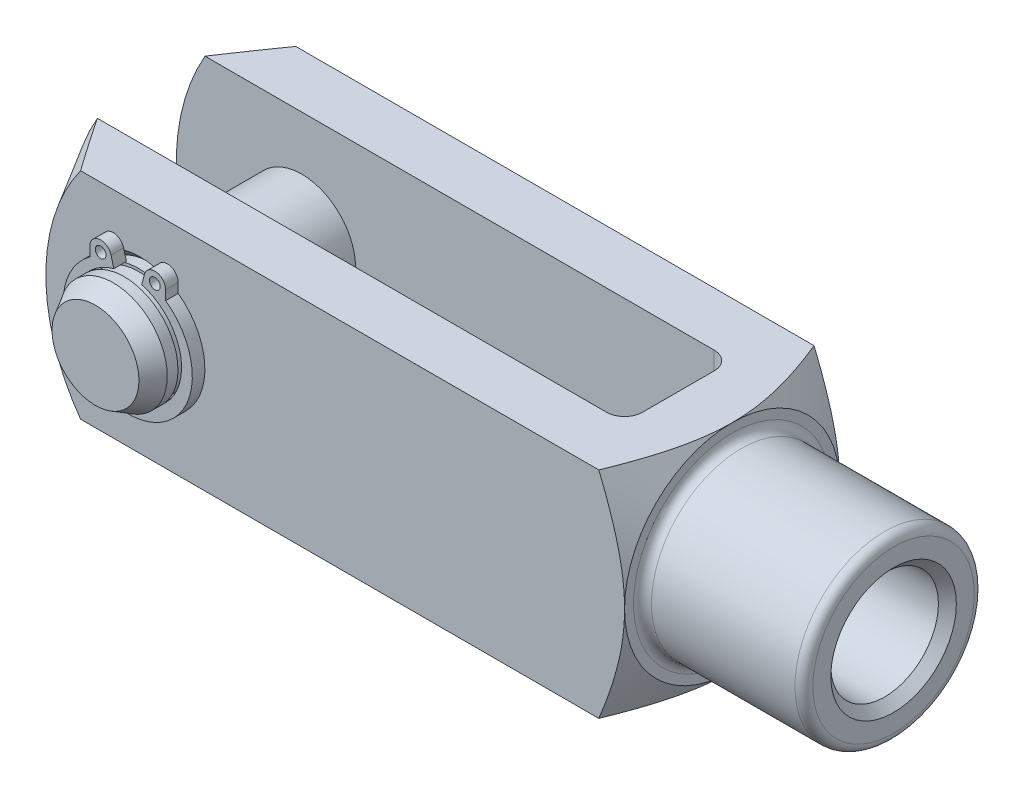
ISO-10303-21;
HEADER;
FILE_DESCRIPTION(('STEP AP214'),'2;1');
FILE_NAME('part.step','',(''),(''),'','','');
FILE_SCHEMA(('AUTOMOTIVE_DESIGN { 1 0 10303 214 1 1 1 1 }'));
ENDSEC;
DATA;
#1=APPLICATION_CONTEXT('core data for automotive mechanical design processes');
#2=APPLICATION_PROTOCOL_DEFINITION('international standard','automotive_design',2000,#1);
#3=PRODUCT_CONTEXT('',#1,'mechanical');
#4=PRODUCT('Part','Part','',(#3));
#5=PRODUCT_RELATED_PRODUCT_CATEGORY('part','',(#4));
#6=PRODUCT_DEFINITION_FORMATION('','',#4);
#7=PRODUCT_DEFINITION_CONTEXT('part definition',#1,'design');
#8=PRODUCT_DEFINITION('design','',#6,#7);
#9=PRODUCT_DEFINITION_SHAPE('','',#8);
#10=(LENGTH_UNIT() NAMED_UNIT(*) SI_UNIT(.MILLI.,.METRE.));
#11=(NAMED_UNIT(*) PLANE_ANGLE_UNIT() SI_UNIT($,.RADIAN.));
#12=(NAMED_UNIT(*) SI_UNIT($,.STERADIAN.) SOLID_ANGLE_UNIT());
#13=UNCERTAINTY_MEASURE_WITH_UNIT(LENGTH_MEASURE(1.E-05),#10,'distance_accuracy_value','');
#14=(GEOMETRIC_REPRESENTATION_CONTEXT(3) GLOBAL_UNCERTAINTY_ASSIGNED_CONTEXT((#13)) GLOBAL_UNIT_ASSIGNED_CONTEXT((#10,
#11,#12)) REPRESENTATION_CONTEXT('',''));
#15=CARTESIAN_POINT('',(0.,0.,0.));
#16=DIRECTION('',(0.,0.,1.));
#17=DIRECTION('',(1.,0.,0.));
#18=AXIS2_PLACEMENT_3D('',#15,#16,#17);
#19=CARTESIAN_POINT('',(-36.,0.,8.5));
#20=DIRECTION('',(0.,0.,-1.));
#21=DIRECTION('',(-1.,0.,0.));
#22=AXIS2_PLACEMENT_3D('',#19,#20,#21);
#23=CYLINDRICAL_SURFACE('',#22,3.);
#24=CARTESIAN_POINT('',(-36.,0.,6.1));
#25=DIRECTION('',(0.,0.,1.));
#26=DIRECTION('',(1.,0.,0.));
#27=AXIS2_PLACEMENT_3D('',#24,#25,#26);
#28=CIRCLE('',#27,3.);
#29=CARTESIAN_POINT('',(-33.,0.,6.1));
#30=VERTEX_POINT('',#29);
#31=EDGE_CURVE('P0_E55',#30,#30,#28,.T.);
#32=ORIENTED_EDGE('',*,*,#31,.F.);
#33=EDGE_LOOP('',(#32));
#34=FACE_BOUND('',#33,.T.);
#35=CARTESIAN_POINT('',(-36.,0.,-6.1));
#36=DIRECTION('',(0.,0.,1.));
#37=DIRECTION('',(1.,0.,0.));
#38=AXIS2_PLACEMENT_3D('',#35,#36,#37);
#39=CIRCLE('',#38,3.);
#40=CARTESIAN_POINT('',(-33.,0.,-6.1));
#41=VERTEX_POINT('',#40);
#42=EDGE_CURVE('P0_E40',#41,#41,#39,.T.);
#43=ORIENTED_EDGE('',*,*,#42,.T.);
#44=EDGE_LOOP('',(#43));
#45=FACE_BOUND('',#44,.T.);
#46=ADVANCED_FACE('P0_F14',(#34,#45),#23,.T.);
#47=CARTESIAN_POINT('',(-36.,0.,-6.9));
#48=DIRECTION('',(0.,0.,1.));
#49=DIRECTION('',(1.,0.,0.));
#50=AXIS2_PLACEMENT_3D('',#47,#48,#49);
#51=CIRCLE('',#50,3.);
#52=CARTESIAN_POINT('',(-33.,0.,-6.9));
#53=VERTEX_POINT('',#52);
#54=EDGE_CURVE('P0_E43',#53,#53,#51,.T.);
#55=ORIENTED_EDGE('',*,*,#54,.F.);
#56=EDGE_LOOP('',(#55));
#57=FACE_BOUND('',#56,.T.);
#58=CARTESIAN_POINT('',(-36.,0.,-7.5));
#59=DIRECTION('',(0.,0.,1.));
#60=DIRECTION('',(1.,0.,0.));
#61=AXIS2_PLACEMENT_3D('',#58,#59,#60);
#62=CIRCLE('',#61,3.);
#63=CARTESIAN_POINT('',(-33.,0.,-7.5));
#64=VERTEX_POINT('',#63);
#65=EDGE_CURVE('P0_E25',#64,#64,#62,.T.);
#66=ORIENTED_EDGE('',*,*,#65,.T.);
#67=EDGE_LOOP('',(#66));
#68=FACE_BOUND('',#67,.T.);
#69=ADVANCED_FACE('P0_F63',(#57,#68),#23,.T.);
#70=CARTESIAN_POINT('',(-36.,0.,-8.5));
#71=DIRECTION('',(0.,0.,1.));
#72=DIRECTION('',(1.,0.,0.));
#73=AXIS2_PLACEMENT_3D('',#70,#71,#72);
#74=PLANE('',#73);
#75=CARTESIAN_POINT('',(-36.,0.,-8.5));
#76=DIRECTION('',(0.,0.,1.));
#77=DIRECTION('',(1.,0.,0.));
#78=AXIS2_PLACEMENT_3D('',#75,#76,#77);
#79=CIRCLE('',#78,2.42264973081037);
#80=CARTESIAN_POINT('',(-33.5773502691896,0.,-8.5));
#81=VERTEX_POINT('',#80);
#82=EDGE_CURVE('P0_E21',#81,#81,#79,.F.);
#83=ORIENTED_EDGE('',*,*,#82,.T.);
#84=EDGE_LOOP('',(#83));
#85=FACE_BOUND('',#84,.T.);
#86=ADVANCED_FACE('P0_F89',(#85),#74,.F.);
#87=CARTESIAN_POINT('',(-36.,0.,-7.5));
#88=DIRECTION('',(0.,0.,1.));
#89=DIRECTION('',(1.,0.,0.));
#90=AXIS2_PLACEMENT_3D('',#87,#88,#89);
#91=CONICAL_SURFACE('',#90,3.,0.523598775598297);
#92=ORIENTED_EDGE('',*,*,#82,.F.);
#93=EDGE_LOOP('',(#92));
#94=FACE_BOUND('',#93,.T.);
#95=ORIENTED_EDGE('',*,*,#65,.F.);
#96=EDGE_LOOP('',(#95));
#97=FACE_BOUND('',#96,.T.);
#98=ADVANCED_FACE('P0_F83',(#94,#97),#91,.T.);
#99=CARTESIAN_POINT('',(-36.,3.,-6.9));
#100=DIRECTION('',(0.,0.,-1.));
#101=DIRECTION('',(-1.,0.,0.));
#102=AXIS2_PLACEMENT_3D('',#99,#100,#101);
#103=PLANE('',#102);
#104=CARTESIAN_POINT('',(-36.,0.,-6.9));
#105=DIRECTION('',(0.,0.,1.));
#106=DIRECTION('',(1.,0.,0.));
#107=AXIS2_PLACEMENT_3D('',#104,#105,#106);
#108=CIRCLE('',#107,2.85);
#109=CARTESIAN_POINT('',(-33.15,0.,-6.9));
#110=VERTEX_POINT('',#109);
#111=EDGE_CURVE('P0_E34',#110,#110,#108,.T.);
#112=ORIENTED_EDGE('',*,*,#111,.F.);
#113=EDGE_LOOP('',(#112));
#114=FACE_BOUND('',#113,.T.);
#115=ORIENTED_EDGE('',*,*,#54,.T.);
#116=EDGE_LOOP('',(#115));
#117=FACE_BOUND('',#116,.T.);
#118=ADVANCED_FACE('P0_F77',(#114,#117),#103,.F.);
#119=CARTESIAN_POINT('',(-36.,0.,7.5));
#120=DIRECTION('',(0.,0.,1.));
#121=DIRECTION('',(1.,0.,0.));
#122=AXIS2_PLACEMENT_3D('',#119,#120,#121);
#123=CYLINDRICAL_SURFACE('',#122,2.85);
#124=CARTESIAN_POINT('',(-36.,0.,-6.1));
#125=DIRECTION('',(0.,0.,1.));
#126=DIRECTION('',(1.,0.,0.));
#127=AXIS2_PLACEMENT_3D('',#124,#125,#126);
#128=CIRCLE('',#127,2.85);
#129=CARTESIAN_POINT('',(-33.15,0.,-6.1));
#130=VERTEX_POINT('',#129);
#131=EDGE_CURVE('P0_E37',#130,#130,#128,.T.);
#132=ORIENTED_EDGE('',*,*,#131,.F.);
#133=EDGE_LOOP('',(#132));
#134=FACE_BOUND('',#133,.T.);
#135=ORIENTED_EDGE('',*,*,#111,.T.);
#136=EDGE_LOOP('',(#135));
#137=FACE_BOUND('',#136,.T.);
#138=ADVANCED_FACE('P0_F71',(#134,#137),#123,.T.);
#139=CARTESIAN_POINT('',(-36.,3.,-6.1));
#140=DIRECTION('',(0.,0.,1.));
#141=DIRECTION('',(1.,0.,0.));
#142=AXIS2_PLACEMENT_3D('',#139,#140,#141);
#143=PLANE('',#142);
#144=ORIENTED_EDGE('',*,*,#42,.F.);
#145=EDGE_LOOP('',(#144));
#146=FACE_BOUND('',#145,.T.);
#147=ORIENTED_EDGE('',*,*,#131,.T.);
#148=EDGE_LOOP('',(#147));
#149=FACE_BOUND('',#148,.T.);
#150=ADVANCED_FACE('P0_F68',(#146,#149),#143,.F.);
#151=CARTESIAN_POINT('',(-36.,3.,6.1));
#152=DIRECTION('',(0.,0.,-1.));
#153=DIRECTION('',(-1.,0.,0.));
#154=AXIS2_PLACEMENT_3D('',#151,#152,#153);
#155=PLANE('',#154);
#156=CARTESIAN_POINT('',(-36.,0.,6.1));
#157=DIRECTION('',(0.,0.,1.));
#158=DIRECTION('',(1.,0.,0.));
#159=AXIS2_PLACEMENT_3D('',#156,#157,#158);
#160=CIRCLE('',#159,2.85);
#161=CARTESIAN_POINT('',(-33.15,0.,6.1));
#162=VERTEX_POINT('',#161);
#163=EDGE_CURVE('P0_E46',#162,#162,#160,.T.);
#164=ORIENTED_EDGE('',*,*,#163,.F.);
#165=EDGE_LOOP('',(#164));
#166=FACE_BOUND('',#165,.T.);
#167=ORIENTED_EDGE('',*,*,#31,.T.);
#168=EDGE_LOOP('',(#167));
#169=FACE_BOUND('',#168,.T.);
#170=ADVANCED_FACE('P0_F59',(#166,#169),#155,.F.);
#171=CARTESIAN_POINT('',(-36.,0.,7.5));
#172=DIRECTION('',(0.,0.,1.));
#173=DIRECTION('',(1.,0.,0.));
#174=AXIS2_PLACEMENT_3D('',#171,#172,#173);
#175=CYLINDRICAL_SURFACE('',#174,2.85);
#176=CARTESIAN_POINT('',(-36.,0.,6.9));
#177=DIRECTION('',(0.,0.,1.));
#178=DIRECTION('',(1.,0.,0.));
#179=AXIS2_PLACEMENT_3D('',#176,#177,#178);
#180=CIRCLE('',#179,2.85);
#181=CARTESIAN_POINT('',(-33.15,0.,6.9));
#182=VERTEX_POINT('',#181);
#183=EDGE_CURVE('P0_E49',#182,#182,#180,.T.);
#184=ORIENTED_EDGE('',*,*,#183,.F.);
#185=EDGE_LOOP('',(#184));
#186=FACE_BOUND('',#185,.T.);
#187=ORIENTED_EDGE('',*,*,#163,.T.);
#188=EDGE_LOOP('',(#187));
#189=FACE_BOUND('',#188,.T.);
#190=ADVANCED_FACE('P0_F108',(#186,#189),#175,.T.);
#191=CARTESIAN_POINT('',(-36.,3.,6.9));
#192=DIRECTION('',(0.,0.,1.));
#193=DIRECTION('',(1.,0.,0.));
#194=AXIS2_PLACEMENT_3D('',#191,#192,#193);
#195=PLANE('',#194);
#196=CARTESIAN_POINT('',(-36.,0.,6.9));
#197=DIRECTION('',(0.,0.,1.));
#198=DIRECTION('',(1.,0.,0.));
#199=AXIS2_PLACEMENT_3D('',#196,#197,#198);
#200=CIRCLE('',#199,3.);
#201=CARTESIAN_POINT('',(-33.,0.,6.9));
#202=VERTEX_POINT('',#201);
#203=EDGE_CURVE('P0_E52',#202,#202,#200,.T.);
#204=ORIENTED_EDGE('',*,*,#203,.F.);
#205=EDGE_LOOP('',(#204));
#206=FACE_BOUND('',#205,.T.);
#207=ORIENTED_EDGE('',*,*,#183,.T.);
#208=EDGE_LOOP('',(#207));
#209=FACE_BOUND('',#208,.T.);
#210=ADVANCED_FACE('P0_F104',(#206,#209),#195,.F.);
#211=CARTESIAN_POINT('',(-36.,0.,8.5));
#212=DIRECTION('',(0.,0.,1.));
#213=DIRECTION('',(1.,0.,0.));
#214=AXIS2_PLACEMENT_3D('',#211,#212,#213);
#215=PLANE('',#214);
#216=CARTESIAN_POINT('',(-36.,0.,8.5));
#217=DIRECTION('',(0.,0.,1.));
#218=DIRECTION('',(1.,0.,0.));
#219=AXIS2_PLACEMENT_3D('',#216,#217,#218);
#220=CIRCLE('',#219,2.42264973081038);
#221=CARTESIAN_POINT('',(-33.5773502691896,0.,8.5));
#222=VERTEX_POINT('',#221);
#223=EDGE_CURVE('P0_E10',#222,#222,#220,.T.);
#224=ORIENTED_EDGE('',*,*,#223,.T.);
#225=EDGE_LOOP('',(#224));
#226=FACE_BOUND('',#225,.T.);
#227=ADVANCED_FACE('P0_F102',(#226),#215,.T.);
#228=CARTESIAN_POINT('',(-36.,0.,8.5));
#229=DIRECTION('',(0.,0.,-1.));
#230=DIRECTION('',(-1.,0.,0.));
#231=AXIS2_PLACEMENT_3D('',#228,#229,#230);
#232=CONICAL_SURFACE('',#231,2.42264973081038,0.523598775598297);
#233=CARTESIAN_POINT('',(-36.,0.,7.5));
#234=DIRECTION('',(0.,0.,1.));
#235=DIRECTION('',(1.,0.,0.));
#236=AXIS2_PLACEMENT_3D('',#233,#234,#235);
#237=CIRCLE('',#236,3.);
#238=CARTESIAN_POINT('',(-33.,0.,7.5));
#239=VERTEX_POINT('',#238);
#240=EDGE_CURVE('P0_E29',#239,#239,#237,.F.);
#241=ORIENTED_EDGE('',*,*,#240,.F.);
#242=EDGE_LOOP('',(#241));
#243=FACE_BOUND('',#242,.T.);
#244=ORIENTED_EDGE('',*,*,#223,.F.);
#245=EDGE_LOOP('',(#244));
#246=FACE_BOUND('',#245,.T.);
#247=ADVANCED_FACE('P0_F16',(#243,#246),#232,.T.);
#248=ORIENTED_EDGE('',*,*,#203,.T.);
#249=EDGE_LOOP('',(#248));
#250=FACE_BOUND('',#249,.T.);
#251=ORIENTED_EDGE('',*,*,#240,.T.);
#252=EDGE_LOOP('',(#251));
#253=FACE_BOUND('',#252,.T.);
#254=ADVANCED_FACE('P0_F65',(#250,#253),#23,.T.);
#255=CLOSED_SHELL('',(#46,#69,#86,#98,#118,#138,#150,#170,#190,#210,#227,#247,#254));
#256=MANIFOLD_SOLID_BREP('P0_B1',#255);
#257=CARTESIAN_POINT('',(-36.,0.,6.69999999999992));
#258=DIRECTION('',(0.,0.,1.));
#259=DIRECTION('',(1.,0.,0.));
#260=AXIS2_PLACEMENT_3D('',#257,#258,#259);
#261=PLANE('',#260);
#262=CARTESIAN_POINT('',(-37.5113040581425,3.32204154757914,6.69999999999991));
#263=DIRECTION('',(0.,0.,1.));
#264=DIRECTION('',(1.,0.,0.));
#265=AXIS2_PLACEMENT_3D('',#262,#263,#264);
#266=CIRCLE('',#265,0.3);
#267=CARTESIAN_POINT('',(-37.2113040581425,3.32204154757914,6.69999999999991));
#268=VERTEX_POINT('',#267);
#269=EDGE_CURVE('P1_E117',#268,#268,#266,.T.);
#270=ORIENTED_EDGE('',*,*,#269,.F.);
#271=EDGE_LOOP('',(#270));
#272=FACE_BOUND('',#271,.T.);
#273=CARTESIAN_POINT('',(-36.,0.,6.69999999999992));
#274=DIRECTION('',(0.,0.,-1.));
#275=DIRECTION('',(1.,0.,0.));
#276=AXIS2_PLACEMENT_3D('',#273,#274,#275);
#277=CIRCLE('',#276,3.);
#278=CARTESIAN_POINT('',(-35.2235428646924,2.89777747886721,6.69999999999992));
#279=VERTEX_POINT('',#278);
#280=CARTESIAN_POINT('',(-36.7764571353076,2.89777747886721,6.69999999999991));
#281=VERTEX_POINT('',#280);
#282=EDGE_CURVE('P1_E128',#279,#281,#277,.T.);
#283=ORIENTED_EDGE('',*,*,#282,.T.);
#284=DIRECTION('',(-0.258819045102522,0.965925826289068,0.));
#285=VECTOR('',#284,1.);
#286=CARTESIAN_POINT('',(-36.7764571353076,2.89777747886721,6.69999999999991));
#287=LINE('',#286,#285);
#288=CARTESIAN_POINT('',(-36.9317485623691,3.47733297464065,6.69999999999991));
#289=VERTEX_POINT('',#288);
#290=EDGE_CURVE('P1_E76',#281,#289,#287,.T.);
#291=ORIENTED_EDGE('',*,*,#290,.T.);
#292=CARTESIAN_POINT('',(-37.5113040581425,3.32204154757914,6.69999999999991));
#293=DIRECTION('',(0.,0.,1.));
#294=DIRECTION('',(1.,0.,0.));
#295=AXIS2_PLACEMENT_3D('',#292,#293,#294);
#296=CIRCLE('',#295,0.599999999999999);
#297=CARTESIAN_POINT('',(-38.1113040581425,3.32204154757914,6.69999999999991));
#298=VERTEX_POINT('',#297);
#299=EDGE_CURVE('P1_E143',#289,#298,#296,.T.);
#300=ORIENTED_EDGE('',*,*,#299,.T.);
#301=DIRECTION('',(0.,-1.,0.));
#302=VECTOR('',#301,1.);
#303=CARTESIAN_POINT('',(-38.1113040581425,3.32204154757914,6.69999999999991));
#304=LINE('',#303,#302);
#305=CARTESIAN_POINT('',(-38.1113040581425,2.79588668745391,6.69999999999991));
#306=VERTEX_POINT('',#305);
#307=EDGE_CURVE('P1_E156',#298,#306,#304,.T.);
#308=ORIENTED_EDGE('',*,*,#307,.T.);
#309=CARTESIAN_POINT('',(-36.,-0.119999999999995,6.69999999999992));
#310=DIRECTION('',(0.,0.,1.));
#311=DIRECTION('',(1.,0.,0.));
#312=AXIS2_PLACEMENT_3D('',#309,#310,#311);
#313=CIRCLE('',#312,3.6);
#314=CARTESIAN_POINT('',(-33.8886959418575,2.79588668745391,6.69999999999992));
#315=VERTEX_POINT('',#314);
#316=EDGE_CURVE('P1_E95',#306,#315,#313,.T.);
#317=ORIENTED_EDGE('',*,*,#316,.T.);
#318=DIRECTION('',(0.,1.,0.));
#319=VECTOR('',#318,1.);
#320=CARTESIAN_POINT('',(-33.8886959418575,3.32204154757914,6.69999999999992));
#321=LINE('',#320,#319);
#322=CARTESIAN_POINT('',(-33.8886959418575,3.32204154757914,6.69999999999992));
#323=VERTEX_POINT('',#322);
#324=EDGE_CURVE('P1_E89',#315,#323,#321,.T.);
#325=ORIENTED_EDGE('',*,*,#324,.T.);
#326=CARTESIAN_POINT('',(-34.4886959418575,3.32204154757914,6.69999999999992));
#327=DIRECTION('',(0.,0.,1.));
#328=DIRECTION('',(-1.,0.,0.));
#329=AXIS2_PLACEMENT_3D('',#326,#327,#328);
#330=CIRCLE('',#329,0.599999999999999);
#331=CARTESIAN_POINT('',(-35.0682514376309,3.47733297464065,6.69999999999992));
#332=VERTEX_POINT('',#331);
#333=EDGE_CURVE('P1_E93',#323,#332,#330,.T.);
#334=ORIENTED_EDGE('',*,*,#333,.T.);
#335=DIRECTION('',(-0.258819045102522,-0.965925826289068,0.));
#336=VECTOR('',#335,1.);
#337=CARTESIAN_POINT('',(-35.2235428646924,2.89777747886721,6.69999999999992));
#338=LINE('',#337,#336);
#339=EDGE_CURVE('P1_E33',#332,#279,#338,.T.);
#340=ORIENTED_EDGE('',*,*,#339,.T.);
#341=EDGE_LOOP('',(#283,#291,#300,#308,#317,#325,#334,#340));
#342=FACE_BOUND('',#341,.T.);
#343=CARTESIAN_POINT('',(-34.4886959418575,3.32204154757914,6.69999999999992));
#344=DIRECTION('',(0.,0.,1.));
#345=DIRECTION('',(-1.,0.,0.));
#346=AXIS2_PLACEMENT_3D('',#343,#344,#345);
#347=CIRCLE('',#346,0.3);
#348=CARTESIAN_POINT('',(-34.7886959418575,3.32204154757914,6.69999999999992));
#349=VERTEX_POINT('',#348);
#350=EDGE_CURVE('P1_E165',#349,#349,#347,.T.);
#351=ORIENTED_EDGE('',*,*,#350,.F.);
#352=EDGE_LOOP('',(#351));
#353=FACE_BOUND('',#352,.T.);
#354=ADVANCED_FACE('P1_F16',(#272,#342,#353),#261,.T.);
#355=CARTESIAN_POINT('',(-36.,0.,5.99999999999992));
#356=DIRECTION('',(0.,0.,1.));
#357=DIRECTION('',(1.,0.,0.));
#358=AXIS2_PLACEMENT_3D('',#355,#356,#357);
#359=PLANE('',#358);
#360=CARTESIAN_POINT('',(-37.5113040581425,3.32204154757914,5.99999999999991));
#361=DIRECTION('',(0.,0.,1.));
#362=DIRECTION('',(1.,0.,0.));
#363=AXIS2_PLACEMENT_3D('',#360,#361,#362);
#364=CIRCLE('',#363,0.3);
#365=CARTESIAN_POINT('',(-37.2113040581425,3.32204154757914,5.99999999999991));
#366=VERTEX_POINT('',#365);
#367=EDGE_CURVE('P1_E162',#366,#366,#364,.T.);
#368=ORIENTED_EDGE('',*,*,#367,.T.);
#369=EDGE_LOOP('',(#368));
#370=FACE_BOUND('',#369,.T.);
#371=CARTESIAN_POINT('',(-36.,0.,5.99999999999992));
#372=DIRECTION('',(0.,0.,-1.));
#373=DIRECTION('',(1.,0.,0.));
#374=AXIS2_PLACEMENT_3D('',#371,#372,#373);
#375=CIRCLE('',#374,3.);
#376=CARTESIAN_POINT('',(-35.2235428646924,2.89777747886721,5.99999999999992));
#377=VERTEX_POINT('',#376);
#378=CARTESIAN_POINT('',(-36.7764571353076,2.89777747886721,5.99999999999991));
#379=VERTEX_POINT('',#378);
#380=EDGE_CURVE('P1_E113',#377,#379,#375,.T.);
#381=ORIENTED_EDGE('',*,*,#380,.F.);
#382=DIRECTION('',(-0.258819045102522,-0.965925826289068,0.));
#383=VECTOR('',#382,1.);
#384=CARTESIAN_POINT('',(-35.2235428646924,2.89777747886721,5.99999999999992));
#385=LINE('',#384,#383);
#386=CARTESIAN_POINT('',(-35.0682514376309,3.47733297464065,5.99999999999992));
#387=VERTEX_POINT('',#386);
#388=EDGE_CURVE('P1_E68',#387,#377,#385,.T.);
#389=ORIENTED_EDGE('',*,*,#388,.F.);
#390=CARTESIAN_POINT('',(-34.4886959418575,3.32204154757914,5.99999999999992));
#391=DIRECTION('',(0.,0.,1.));
#392=DIRECTION('',(-1.,0.,0.));
#393=AXIS2_PLACEMENT_3D('',#390,#391,#392);
#394=CIRCLE('',#393,0.599999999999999);
#395=CARTESIAN_POINT('',(-33.8886959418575,3.32204154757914,5.99999999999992));
#396=VERTEX_POINT('',#395);
#397=EDGE_CURVE('P1_E62',#396,#387,#394,.T.);
#398=ORIENTED_EDGE('',*,*,#397,.F.);
#399=DIRECTION('',(0.,1.,0.));
#400=VECTOR('',#399,1.);
#401=CARTESIAN_POINT('',(-33.8886959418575,3.32204154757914,5.99999999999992));
#402=LINE('',#401,#400);
#403=CARTESIAN_POINT('',(-33.8886959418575,2.79588668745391,5.99999999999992));
#404=VERTEX_POINT('',#403);
#405=EDGE_CURVE('P1_E103',#404,#396,#402,.T.);
#406=ORIENTED_EDGE('',*,*,#405,.F.);
#407=CARTESIAN_POINT('',(-36.,-0.119999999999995,5.99999999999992));
#408=DIRECTION('',(0.,0.,1.));
#409=DIRECTION('',(1.,0.,0.));
#410=AXIS2_PLACEMENT_3D('',#407,#408,#409);
#411=CIRCLE('',#410,3.6);
#412=CARTESIAN_POINT('',(-38.1113040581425,2.79588668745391,5.99999999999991));
#413=VERTEX_POINT('',#412);
#414=EDGE_CURVE('P1_E123',#413,#404,#411,.T.);
#415=ORIENTED_EDGE('',*,*,#414,.F.);
#416=DIRECTION('',(0.,-1.,0.));
#417=VECTOR('',#416,1.);
#418=CARTESIAN_POINT('',(-38.1113040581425,3.32204154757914,5.99999999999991));
#419=LINE('',#418,#417);
#420=CARTESIAN_POINT('',(-38.1113040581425,3.32204154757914,5.99999999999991));
#421=VERTEX_POINT('',#420);
#422=EDGE_CURVE('P1_E121',#421,#413,#419,.T.);
#423=ORIENTED_EDGE('',*,*,#422,.F.);
#424=CARTESIAN_POINT('',(-37.5113040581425,3.32204154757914,5.99999999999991));
#425=DIRECTION('',(0.,0.,1.));
#426=DIRECTION('',(1.,0.,0.));
#427=AXIS2_PLACEMENT_3D('',#424,#425,#426);
#428=CIRCLE('',#427,0.599999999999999);
#429=CARTESIAN_POINT('',(-36.9317485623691,3.47733297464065,5.99999999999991));
#430=VERTEX_POINT('',#429);
#431=EDGE_CURVE('P1_E119',#430,#421,#428,.T.);
#432=ORIENTED_EDGE('',*,*,#431,.F.);
#433=DIRECTION('',(-0.258819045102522,0.965925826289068,0.));
#434=VECTOR('',#433,1.);
#435=CARTESIAN_POINT('',(-36.7764571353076,2.89777747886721,5.99999999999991));
#436=LINE('',#435,#434);
#437=EDGE_CURVE('P1_E116',#379,#430,#436,.T.);
#438=ORIENTED_EDGE('',*,*,#437,.F.);
#439=EDGE_LOOP('',(#381,#389,#398,#406,#415,#423,#432,#438));
#440=FACE_BOUND('',#439,.T.);
#441=CARTESIAN_POINT('',(-34.4886959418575,3.32204154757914,5.99999999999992));
#442=DIRECTION('',(0.,0.,1.));
#443=DIRECTION('',(-1.,0.,0.));
#444=AXIS2_PLACEMENT_3D('',#441,#442,#443);
#445=CIRCLE('',#444,0.3);
#446=CARTESIAN_POINT('',(-34.7886959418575,3.32204154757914,5.99999999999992));
#447=VERTEX_POINT('',#446);
#448=EDGE_CURVE('P1_E168',#447,#447,#445,.T.);
#449=ORIENTED_EDGE('',*,*,#448,.T.);
#450=EDGE_LOOP('',(#449));
#451=FACE_BOUND('',#450,.T.);
#452=ADVANCED_FACE('P1_F147',(#370,#440,#451),#359,.F.);
#453=CARTESIAN_POINT('',(-36.,0.,6.69999999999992));
#454=DIRECTION('',(0.,0.,-1.));
#455=DIRECTION('',(-1.,0.,0.));
#456=AXIS2_PLACEMENT_3D('',#453,#454,#455);
#457=CYLINDRICAL_SURFACE('',#456,3.);
#458=ORIENTED_EDGE('',*,*,#380,.T.);
#459=DIRECTION('',(0.,0.,-1.));
#460=VECTOR('',#459,1.);
#461=CARTESIAN_POINT('',(-36.7764571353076,2.89777747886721,6.69999999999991));
#462=LINE('',#461,#460);
#463=EDGE_CURVE('P1_E11',#281,#379,#462,.T.);
#464=ORIENTED_EDGE('',*,*,#463,.F.);
#465=ORIENTED_EDGE('',*,*,#282,.F.);
#466=DIRECTION('',(0.,0.,-1.));
#467=VECTOR('',#466,1.);
#468=CARTESIAN_POINT('',(-35.2235428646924,2.89777747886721,6.69999999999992));
#469=LINE('',#468,#467);
#470=EDGE_CURVE('P1_E109',#279,#377,#469,.T.);
#471=ORIENTED_EDGE('',*,*,#470,.T.);
#472=EDGE_LOOP('',(#458,#464,#465,#471));
#473=FACE_BOUND('',#472,.T.);
#474=ADVANCED_FACE('P1_F18',(#473),#457,.F.);
#475=CARTESIAN_POINT('',(-36.7764571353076,2.89777747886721,6.69999999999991));
#476=DIRECTION('',(-0.965925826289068,-0.258819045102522,0.));
#477=DIRECTION('',(0.258819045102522,-0.965925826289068,0.));
#478=AXIS2_PLACEMENT_3D('',#475,#476,#477);
#479=PLANE('',#478);
#480=ORIENTED_EDGE('',*,*,#437,.T.);
#481=DIRECTION('',(0.,0.,-1.));
#482=VECTOR('',#481,1.);
#483=CARTESIAN_POINT('',(-36.9317485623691,3.47733297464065,6.69999999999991));
#484=LINE('',#483,#482);
#485=EDGE_CURVE('P1_E25',#289,#430,#484,.T.);
#486=ORIENTED_EDGE('',*,*,#485,.F.);
#487=ORIENTED_EDGE('',*,*,#290,.F.);
#488=ORIENTED_EDGE('',*,*,#463,.T.);
#489=EDGE_LOOP('',(#480,#486,#487,#488));
#490=FACE_BOUND('',#489,.T.);
#491=ADVANCED_FACE('P1_F202',(#490),#479,.F.);
#492=CARTESIAN_POINT('',(-37.5113040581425,3.32204154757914,6.69999999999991));
#493=DIRECTION('',(0.,0.,-1.));
#494=DIRECTION('',(-1.,0.,0.));
#495=AXIS2_PLACEMENT_3D('',#492,#493,#494);
#496=CYLINDRICAL_SURFACE('',#495,0.599999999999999);
#497=ORIENTED_EDGE('',*,*,#431,.T.);
#498=DIRECTION('',(0.,0.,-1.));
#499=VECTOR('',#498,1.);
#500=CARTESIAN_POINT('',(-38.1113040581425,3.32204154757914,6.69999999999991));
#501=LINE('',#500,#499);
#502=EDGE_CURVE('P1_E135',#298,#421,#501,.T.);
#503=ORIENTED_EDGE('',*,*,#502,.F.);
#504=ORIENTED_EDGE('',*,*,#299,.F.);
#505=ORIENTED_EDGE('',*,*,#485,.T.);
#506=EDGE_LOOP('',(#497,#503,#504,#505));
#507=FACE_BOUND('',#506,.T.);
#508=ADVANCED_FACE('P1_F141',(#507),#496,.T.);
#509=CARTESIAN_POINT('',(-38.1113040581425,3.32204154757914,6.69999999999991));
#510=DIRECTION('',(1.,0.,0.));
#511=DIRECTION('',(0.,1.,0.));
#512=AXIS2_PLACEMENT_3D('',#509,#510,#511);
#513=PLANE('',#512);
#514=ORIENTED_EDGE('',*,*,#422,.T.);
#515=DIRECTION('',(0.,0.,-1.));
#516=VECTOR('',#515,1.);
#517=CARTESIAN_POINT('',(-38.1113040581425,2.79588668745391,6.69999999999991));
#518=LINE('',#517,#516);
#519=EDGE_CURVE('P1_E132',#306,#413,#518,.T.);
#520=ORIENTED_EDGE('',*,*,#519,.F.);
#521=ORIENTED_EDGE('',*,*,#307,.F.);
#522=ORIENTED_EDGE('',*,*,#502,.T.);
#523=EDGE_LOOP('',(#514,#520,#521,#522));
#524=FACE_BOUND('',#523,.T.);
#525=ADVANCED_FACE('P1_F152',(#524),#513,.F.);
#526=CARTESIAN_POINT('',(-36.,-0.119999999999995,6.69999999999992));
#527=DIRECTION('',(0.,0.,-1.));
#528=DIRECTION('',(-1.,0.,0.));
#529=AXIS2_PLACEMENT_3D('',#526,#527,#528);
#530=CYLINDRICAL_SURFACE('',#529,3.6);
#531=ORIENTED_EDGE('',*,*,#414,.T.);
#532=DIRECTION('',(0.,0.,-1.));
#533=VECTOR('',#532,1.);
#534=CARTESIAN_POINT('',(-33.8886959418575,2.79588668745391,6.69999999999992));
#535=LINE('',#534,#533);
#536=EDGE_CURVE('P1_E104',#315,#404,#535,.T.);
#537=ORIENTED_EDGE('',*,*,#536,.F.);
#538=ORIENTED_EDGE('',*,*,#316,.F.);
#539=ORIENTED_EDGE('',*,*,#519,.T.);
#540=EDGE_LOOP('',(#531,#537,#538,#539));
#541=FACE_BOUND('',#540,.T.);
#542=ADVANCED_FACE('P1_F155',(#541),#530,.T.);
#543=CARTESIAN_POINT('',(-33.8886959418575,3.32204154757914,6.69999999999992));
#544=DIRECTION('',(-1.,0.,0.));
#545=DIRECTION('',(0.,-1.,0.));
#546=AXIS2_PLACEMENT_3D('',#543,#544,#545);
#547=PLANE('',#546);
#548=ORIENTED_EDGE('',*,*,#405,.T.);
#549=DIRECTION('',(0.,0.,-1.));
#550=VECTOR('',#549,1.);
#551=CARTESIAN_POINT('',(-33.8886959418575,3.32204154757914,6.69999999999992));
#552=LINE('',#551,#550);
#553=EDGE_CURVE('P1_E100',#323,#396,#552,.T.);
#554=ORIENTED_EDGE('',*,*,#553,.F.);
#555=ORIENTED_EDGE('',*,*,#324,.F.);
#556=ORIENTED_EDGE('',*,*,#536,.T.);
#557=EDGE_LOOP('',(#548,#554,#555,#556));
#558=FACE_BOUND('',#557,.T.);
#559=ADVANCED_FACE('P1_F101',(#558),#547,.F.);
#560=CARTESIAN_POINT('',(-34.4886959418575,3.32204154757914,6.69999999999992));
#561=DIRECTION('',(0.,0.,-1.));
#562=DIRECTION('',(-1.,0.,0.));
#563=AXIS2_PLACEMENT_3D('',#560,#561,#562);
#564=CYLINDRICAL_SURFACE('',#563,0.599999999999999);
#565=ORIENTED_EDGE('',*,*,#397,.T.);
#566=DIRECTION('',(0.,0.,-1.));
#567=VECTOR('',#566,1.);
#568=CARTESIAN_POINT('',(-35.0682514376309,3.47733297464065,6.69999999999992));
#569=LINE('',#568,#567);
#570=EDGE_CURVE('P1_E105',#332,#387,#569,.T.);
#571=ORIENTED_EDGE('',*,*,#570,.F.);
#572=ORIENTED_EDGE('',*,*,#333,.F.);
#573=ORIENTED_EDGE('',*,*,#553,.T.);
#574=EDGE_LOOP('',(#565,#571,#572,#573));
#575=FACE_BOUND('',#574,.T.);
#576=ADVANCED_FACE('P1_F107',(#575),#564,.T.);
#577=CARTESIAN_POINT('',(-35.2235428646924,2.89777747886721,6.69999999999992));
#578=DIRECTION('',(0.965925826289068,-0.258819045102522,0.));
#579=DIRECTION('',(0.258819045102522,0.965925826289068,0.));
#580=AXIS2_PLACEMENT_3D('',#577,#578,#579);
#581=PLANE('',#580);
#582=ORIENTED_EDGE('',*,*,#388,.T.);
#583=ORIENTED_EDGE('',*,*,#470,.F.);
#584=ORIENTED_EDGE('',*,*,#339,.F.);
#585=ORIENTED_EDGE('',*,*,#570,.T.);
#586=EDGE_LOOP('',(#582,#583,#584,#585));
#587=FACE_BOUND('',#586,.T.);
#588=ADVANCED_FACE('P1_F190',(#587),#581,.F.);
#589=CARTESIAN_POINT('',(-37.5113040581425,3.32204154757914,6.69999999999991));
#590=DIRECTION('',(0.,0.,-1.));
#591=DIRECTION('',(-1.,0.,0.));
#592=AXIS2_PLACEMENT_3D('',#589,#590,#591);
#593=CYLINDRICAL_SURFACE('',#592,0.3);
#594=ORIENTED_EDGE('',*,*,#269,.T.);
#595=EDGE_LOOP('',(#594));
#596=FACE_BOUND('',#595,.T.);
#597=ORIENTED_EDGE('',*,*,#367,.F.);
#598=EDGE_LOOP('',(#597));
#599=FACE_BOUND('',#598,.T.);
#600=ADVANCED_FACE('P1_F187',(#596,#599),#593,.F.);
#601=CARTESIAN_POINT('',(-34.4886959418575,3.32204154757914,6.69999999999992));
#602=DIRECTION('',(0.,0.,-1.));
#603=DIRECTION('',(-1.,0.,0.));
#604=AXIS2_PLACEMENT_3D('',#601,#602,#603);
#605=CYLINDRICAL_SURFACE('',#604,0.3);
#606=ORIENTED_EDGE('',*,*,#350,.T.);
#607=EDGE_LOOP('',(#606));
#608=FACE_BOUND('',#607,.T.);
#609=ORIENTED_EDGE('',*,*,#448,.F.);
#610=EDGE_LOOP('',(#609));
#611=FACE_BOUND('',#610,.T.);
#612=ADVANCED_FACE('P1_F174',(#608,#611),#605,.F.);
#613=CLOSED_SHELL('',(#354,#452,#474,#491,#508,#525,#542,#559,#576,#588,#600,#612));
#614=MANIFOLD_SOLID_BREP('P1_B1',#613);
#615=CARTESIAN_POINT('',(-36.,0.,-6.69999999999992));
#616=DIRECTION('',(0.,0.,-1.));
#617=DIRECTION('',(-1.,0.,0.));
#618=AXIS2_PLACEMENT_3D('',#615,#616,#617);
#619=PLANE('',#618);
#620=CARTESIAN_POINT('',(-34.4886959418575,3.32204154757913,-6.69999999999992));
#621=DIRECTION('',(0.,0.,-1.));
#622=DIRECTION('',(-1.,0.,0.));
#623=AXIS2_PLACEMENT_3D('',#620,#621,#622);
#624=CIRCLE('',#623,0.3);
#625=CARTESIAN_POINT('',(-34.7886959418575,3.32204154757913,-6.69999999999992));
#626=VERTEX_POINT('',#625);
#627=EDGE_CURVE('P2_E117',#626,#626,#624,.T.);
#628=ORIENTED_EDGE('',*,*,#627,.F.);
#629=EDGE_LOOP('',(#628));
#630=FACE_BOUND('',#629,.T.);
#631=CARTESIAN_POINT('',(-36.,0.,-6.69999999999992));
#632=DIRECTION('',(0.,0.,1.));
#633=DIRECTION('',(-1.,0.,0.));
#634=AXIS2_PLACEMENT_3D('',#631,#632,#633);
#635=CIRCLE('',#634,3.);
#636=CARTESIAN_POINT('',(-36.7764571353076,2.8977774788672,-6.69999999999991));
#637=VERTEX_POINT('',#636);
#638=CARTESIAN_POINT('',(-35.2235428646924,2.8977774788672,-6.69999999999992));
#639=VERTEX_POINT('',#638);
#640=EDGE_CURVE('P2_E128',#637,#639,#635,.T.);
#641=ORIENTED_EDGE('',*,*,#640,.T.);
#642=DIRECTION('',(0.258819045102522,0.965925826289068,0.));
#643=VECTOR('',#642,1.);
#644=CARTESIAN_POINT('',(-35.2235428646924,2.8977774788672,-6.69999999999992));
#645=LINE('',#644,#643);
#646=CARTESIAN_POINT('',(-35.0682514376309,3.47733297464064,-6.69999999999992));
#647=VERTEX_POINT('',#646);
#648=EDGE_CURVE('P2_E76',#639,#647,#645,.T.);
#649=ORIENTED_EDGE('',*,*,#648,.T.);
#650=CARTESIAN_POINT('',(-34.4886959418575,3.32204154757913,-6.69999999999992));
#651=DIRECTION('',(0.,0.,-1.));
#652=DIRECTION('',(-1.,0.,0.));
#653=AXIS2_PLACEMENT_3D('',#650,#651,#652);
#654=CIRCLE('',#653,0.599999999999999);
#655=CARTESIAN_POINT('',(-33.8886959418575,3.32204154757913,-6.69999999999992));
#656=VERTEX_POINT('',#655);
#657=EDGE_CURVE('P2_E143',#647,#656,#654,.T.);
#658=ORIENTED_EDGE('',*,*,#657,.T.);
#659=DIRECTION('',(0.,-1.,0.));
#660=VECTOR('',#659,1.);
#661=CARTESIAN_POINT('',(-33.8886959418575,3.32204154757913,-6.69999999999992));
#662=LINE('',#661,#660);
#663=CARTESIAN_POINT('',(-33.8886959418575,2.7958866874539,-6.69999999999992));
#664=VERTEX_POINT('',#663);
#665=EDGE_CURVE('P2_E156',#656,#664,#662,.T.);
#666=ORIENTED_EDGE('',*,*,#665,.T.);
#667=CARTESIAN_POINT('',(-36.,-0.120000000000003,-6.69999999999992));
#668=DIRECTION('',(0.,0.,-1.));
#669=DIRECTION('',(-1.,0.,0.));
#670=AXIS2_PLACEMENT_3D('',#667,#668,#669);
#671=CIRCLE('',#670,3.6);
#672=CARTESIAN_POINT('',(-38.1113040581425,2.79588668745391,-6.69999999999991));
#673=VERTEX_POINT('',#672);
#674=EDGE_CURVE('P2_E95',#664,#673,#671,.T.);
#675=ORIENTED_EDGE('',*,*,#674,.T.);
#676=DIRECTION('',(0.,1.,0.));
#677=VECTOR('',#676,1.);
#678=CARTESIAN_POINT('',(-38.1113040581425,3.32204154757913,-6.69999999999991));
#679=LINE('',#678,#677);
#680=CARTESIAN_POINT('',(-38.1113040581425,3.32204154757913,-6.69999999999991));
#681=VERTEX_POINT('',#680);
#682=EDGE_CURVE('P2_E89',#673,#681,#679,.T.);
#683=ORIENTED_EDGE('',*,*,#682,.T.);
#684=CARTESIAN_POINT('',(-37.5113040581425,3.32204154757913,-6.69999999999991));
#685=DIRECTION('',(0.,0.,-1.));
#686=DIRECTION('',(1.,0.,0.));
#687=AXIS2_PLACEMENT_3D('',#684,#685,#686);
#688=CIRCLE('',#687,0.599999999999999);
#689=CARTESIAN_POINT('',(-36.9317485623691,3.47733297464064,-6.69999999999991));
#690=VERTEX_POINT('',#689);
#691=EDGE_CURVE('P2_E93',#681,#690,#688,.T.);
#692=ORIENTED_EDGE('',*,*,#691,.T.);
#693=DIRECTION('',(0.258819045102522,-0.965925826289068,0.));
#694=VECTOR('',#693,1.);
#695=CARTESIAN_POINT('',(-36.7764571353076,2.8977774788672,-6.69999999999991));
#696=LINE('',#695,#694);
#697=EDGE_CURVE('P2_E33',#690,#637,#696,.T.);
#698=ORIENTED_EDGE('',*,*,#697,.T.);
#699=EDGE_LOOP('',(#641,#649,#658,#666,#675,#683,#692,#698));
#700=FACE_BOUND('',#699,.T.);
#701=CARTESIAN_POINT('',(-37.5113040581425,3.32204154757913,-6.69999999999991));
#702=DIRECTION('',(0.,0.,-1.));
#703=DIRECTION('',(1.,0.,0.));
#704=AXIS2_PLACEMENT_3D('',#701,#702,#703);
#705=CIRCLE('',#704,0.3);
#706=CARTESIAN_POINT('',(-37.2113040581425,3.32204154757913,-6.69999999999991));
#707=VERTEX_POINT('',#706);
#708=EDGE_CURVE('P2_E165',#707,#707,#705,.T.);
#709=ORIENTED_EDGE('',*,*,#708,.F.);
#710=EDGE_LOOP('',(#709));
#711=FACE_BOUND('',#710,.T.);
#712=ADVANCED_FACE('P2_F16',(#630,#700,#711),#619,.T.);
#713=CARTESIAN_POINT('',(-36.,0.,-5.99999999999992));
#714=DIRECTION('',(0.,0.,-1.));
#715=DIRECTION('',(-1.,0.,0.));
#716=AXIS2_PLACEMENT_3D('',#713,#714,#715);
#717=PLANE('',#716);
#718=CARTESIAN_POINT('',(-34.4886959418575,3.32204154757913,-5.99999999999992));
#719=DIRECTION('',(0.,0.,-1.));
#720=DIRECTION('',(-1.,0.,0.));
#721=AXIS2_PLACEMENT_3D('',#718,#719,#720);
#722=CIRCLE('',#721,0.3);
#723=CARTESIAN_POINT('',(-34.7886959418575,3.32204154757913,-5.99999999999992));
#724=VERTEX_POINT('',#723);
#725=EDGE_CURVE('P2_E162',#724,#724,#722,.T.);
#726=ORIENTED_EDGE('',*,*,#725,.T.);
#727=EDGE_LOOP('',(#726));
#728=FACE_BOUND('',#727,.T.);
#729=CARTESIAN_POINT('',(-36.,0.,-5.99999999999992));
#730=DIRECTION('',(0.,0.,1.));
#731=DIRECTION('',(-1.,0.,0.));
#732=AXIS2_PLACEMENT_3D('',#729,#730,#731);
#733=CIRCLE('',#732,3.);
#734=CARTESIAN_POINT('',(-36.7764571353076,2.8977774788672,-5.99999999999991));
#735=VERTEX_POINT('',#734);
#736=CARTESIAN_POINT('',(-35.2235428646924,2.8977774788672,-5.99999999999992));
#737=VERTEX_POINT('',#736);
#738=EDGE_CURVE('P2_E113',#735,#737,#733,.T.);
#739=ORIENTED_EDGE('',*,*,#738,.F.);
#740=DIRECTION('',(0.258819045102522,-0.965925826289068,0.));
#741=VECTOR('',#740,1.);
#742=CARTESIAN_POINT('',(-36.7764571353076,2.8977774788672,-5.99999999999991));
#743=LINE('',#742,#741);
#744=CARTESIAN_POINT('',(-36.9317485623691,3.47733297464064,-5.99999999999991));
#745=VERTEX_POINT('',#744);
#746=EDGE_CURVE('P2_E68',#745,#735,#743,.T.);
#747=ORIENTED_EDGE('',*,*,#746,.F.);
#748=CARTESIAN_POINT('',(-37.5113040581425,3.32204154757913,-5.99999999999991));
#749=DIRECTION('',(0.,0.,-1.));
#750=DIRECTION('',(1.,0.,0.));
#751=AXIS2_PLACEMENT_3D('',#748,#749,#750);
#752=CIRCLE('',#751,0.599999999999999);
#753=CARTESIAN_POINT('',(-38.1113040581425,3.32204154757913,-5.99999999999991));
#754=VERTEX_POINT('',#753);
#755=EDGE_CURVE('P2_E62',#754,#745,#752,.T.);
#756=ORIENTED_EDGE('',*,*,#755,.F.);
#757=DIRECTION('',(0.,1.,0.));
#758=VECTOR('',#757,1.);
#759=CARTESIAN_POINT('',(-38.1113040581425,3.32204154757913,-5.99999999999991));
#760=LINE('',#759,#758);
#761=CARTESIAN_POINT('',(-38.1113040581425,2.79588668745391,-5.99999999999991));
#762=VERTEX_POINT('',#761);
#763=EDGE_CURVE('P2_E103',#762,#754,#760,.T.);
#764=ORIENTED_EDGE('',*,*,#763,.F.);
#765=CARTESIAN_POINT('',(-36.,-0.120000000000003,-5.99999999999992));
#766=DIRECTION('',(0.,0.,-1.));
#767=DIRECTION('',(-1.,0.,0.));
#768=AXIS2_PLACEMENT_3D('',#765,#766,#767);
#769=CIRCLE('',#768,3.6);
#770=CARTESIAN_POINT('',(-33.8886959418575,2.7958866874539,-5.99999999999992));
#771=VERTEX_POINT('',#770);
#772=EDGE_CURVE('P2_E123',#771,#762,#769,.T.);
#773=ORIENTED_EDGE('',*,*,#772,.F.);
#774=DIRECTION('',(0.,-1.,0.));
#775=VECTOR('',#774,1.);
#776=CARTESIAN_POINT('',(-33.8886959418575,3.32204154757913,-5.99999999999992));
#777=LINE('',#776,#775);
#778=CARTESIAN_POINT('',(-33.8886959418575,3.32204154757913,-5.99999999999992));
#779=VERTEX_POINT('',#778);
#780=EDGE_CURVE('P2_E121',#779,#771,#777,.T.);
#781=ORIENTED_EDGE('',*,*,#780,.F.);
#782=CARTESIAN_POINT('',(-34.4886959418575,3.32204154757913,-5.99999999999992));
#783=DIRECTION('',(0.,0.,-1.));
#784=DIRECTION('',(-1.,0.,0.));
#785=AXIS2_PLACEMENT_3D('',#782,#783,#784);
#786=CIRCLE('',#785,0.599999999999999);
#787=CARTESIAN_POINT('',(-35.0682514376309,3.47733297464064,-5.99999999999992));
#788=VERTEX_POINT('',#787);
#789=EDGE_CURVE('P2_E119',#788,#779,#786,.T.);
#790=ORIENTED_EDGE('',*,*,#789,.F.);
#791=DIRECTION('',(0.258819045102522,0.965925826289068,0.));
#792=VECTOR('',#791,1.);
#793=CARTESIAN_POINT('',(-35.2235428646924,2.8977774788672,-5.99999999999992));
#794=LINE('',#793,#792);
#795=EDGE_CURVE('P2_E116',#737,#788,#794,.T.);
#796=ORIENTED_EDGE('',*,*,#795,.F.);
#797=EDGE_LOOP('',(#739,#747,#756,#764,#773,#781,#790,#796));
#798=FACE_BOUND('',#797,.T.);
#799=CARTESIAN_POINT('',(-37.5113040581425,3.32204154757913,-5.99999999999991));
#800=DIRECTION('',(0.,0.,-1.));
#801=DIRECTION('',(1.,0.,0.));
#802=AXIS2_PLACEMENT_3D('',#799,#800,#801);
#803=CIRCLE('',#802,0.3);
#804=CARTESIAN_POINT('',(-37.2113040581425,3.32204154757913,-5.99999999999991));
#805=VERTEX_POINT('',#804);
#806=EDGE_CURVE('P2_E168',#805,#805,#803,.T.);
#807=ORIENTED_EDGE('',*,*,#806,.T.);
#808=EDGE_LOOP('',(#807));
#809=FACE_BOUND('',#808,.T.);
#810=ADVANCED_FACE('P2_F147',(#728,#798,#809),#717,.F.);
#811=CARTESIAN_POINT('',(-36.,0.,-6.69999999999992));
#812=DIRECTION('',(0.,0.,1.));
#813=DIRECTION('',(1.,0.,0.));
#814=AXIS2_PLACEMENT_3D('',#811,#812,#813);
#815=CYLINDRICAL_SURFACE('',#814,3.);
#816=ORIENTED_EDGE('',*,*,#738,.T.);
#817=DIRECTION('',(0.,0.,1.));
#818=VECTOR('',#817,1.);
#819=CARTESIAN_POINT('',(-35.2235428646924,2.8977774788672,-6.69999999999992));
#820=LINE('',#819,#818);
#821=EDGE_CURVE('P2_E11',#639,#737,#820,.T.);
#822=ORIENTED_EDGE('',*,*,#821,.F.);
#823=ORIENTED_EDGE('',*,*,#640,.F.);
#824=DIRECTION('',(0.,0.,1.));
#825=VECTOR('',#824,1.);
#826=CARTESIAN_POINT('',(-36.7764571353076,2.8977774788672,-6.69999999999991));
#827=LINE('',#826,#825);
#828=EDGE_CURVE('P2_E109',#637,#735,#827,.T.);
#829=ORIENTED_EDGE('',*,*,#828,.T.);
#830=EDGE_LOOP('',(#816,#822,#823,#829));
#831=FACE_BOUND('',#830,.T.);
#832=ADVANCED_FACE('P2_F18',(#831),#815,.F.);
#833=CARTESIAN_POINT('',(-35.2235428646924,2.8977774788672,-6.69999999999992));
#834=DIRECTION('',(0.965925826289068,-0.258819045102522,0.));
#835=DIRECTION('',(-0.258819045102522,-0.965925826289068,0.));
#836=AXIS2_PLACEMENT_3D('',#833,#834,#835);
#837=PLANE('',#836);
#838=ORIENTED_EDGE('',*,*,#795,.T.);
#839=DIRECTION('',(0.,0.,1.));
#840=VECTOR('',#839,1.);
#841=CARTESIAN_POINT('',(-35.0682514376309,3.47733297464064,-6.69999999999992));
#842=LINE('',#841,#840);
#843=EDGE_CURVE('P2_E25',#647,#788,#842,.T.);
#844=ORIENTED_EDGE('',*,*,#843,.F.);
#845=ORIENTED_EDGE('',*,*,#648,.F.);
#846=ORIENTED_EDGE('',*,*,#821,.T.);
#847=EDGE_LOOP('',(#838,#844,#845,#846));
#848=FACE_BOUND('',#847,.T.);
#849=ADVANCED_FACE('P2_F202',(#848),#837,.F.);
#850=CARTESIAN_POINT('',(-34.4886959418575,3.32204154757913,-6.69999999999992));
#851=DIRECTION('',(0.,0.,1.));
#852=DIRECTION('',(1.,0.,0.));
#853=AXIS2_PLACEMENT_3D('',#850,#851,#852);
#854=CYLINDRICAL_SURFACE('',#853,0.599999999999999);
#855=ORIENTED_EDGE('',*,*,#789,.T.);
#856=DIRECTION('',(0.,0.,1.));
#857=VECTOR('',#856,1.);
#858=CARTESIAN_POINT('',(-33.8886959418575,3.32204154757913,-6.69999999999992));
#859=LINE('',#858,#857);
#860=EDGE_CURVE('P2_E135',#656,#779,#859,.T.);
#861=ORIENTED_EDGE('',*,*,#860,.F.);
#862=ORIENTED_EDGE('',*,*,#657,.F.);
#863=ORIENTED_EDGE('',*,*,#843,.T.);
#864=EDGE_LOOP('',(#855,#861,#862,#863));
#865=FACE_BOUND('',#864,.T.);
#866=ADVANCED_FACE('P2_F141',(#865),#854,.T.);
#867=CARTESIAN_POINT('',(-33.8886959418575,3.32204154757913,-6.69999999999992));
#868=DIRECTION('',(-1.,0.,0.));
#869=DIRECTION('',(0.,1.,0.));
#870=AXIS2_PLACEMENT_3D('',#867,#868,#869);
#871=PLANE('',#870);
#872=ORIENTED_EDGE('',*,*,#780,.T.);
#873=DIRECTION('',(0.,0.,1.));
#874=VECTOR('',#873,1.);
#875=CARTESIAN_POINT('',(-33.8886959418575,2.7958866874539,-6.69999999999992));
#876=LINE('',#875,#874);
#877=EDGE_CURVE('P2_E132',#664,#771,#876,.T.);
#878=ORIENTED_EDGE('',*,*,#877,.F.);
#879=ORIENTED_EDGE('',*,*,#665,.F.);
#880=ORIENTED_EDGE('',*,*,#860,.T.);
#881=EDGE_LOOP('',(#872,#878,#879,#880));
#882=FACE_BOUND('',#881,.T.);
#883=ADVANCED_FACE('P2_F152',(#882),#871,.F.);
#884=CARTESIAN_POINT('',(-36.,-0.120000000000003,-6.69999999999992));
#885=DIRECTION('',(0.,0.,1.));
#886=DIRECTION('',(1.,0.,0.));
#887=AXIS2_PLACEMENT_3D('',#884,#885,#886);
#888=CYLINDRICAL_SURFACE('',#887,3.6);
#889=ORIENTED_EDGE('',*,*,#772,.T.);
#890=DIRECTION('',(0.,0.,1.));
#891=VECTOR('',#890,1.);
#892=CARTESIAN_POINT('',(-38.1113040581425,2.79588668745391,-6.69999999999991));
#893=LINE('',#892,#891);
#894=EDGE_CURVE('P2_E104',#673,#762,#893,.T.);
#895=ORIENTED_EDGE('',*,*,#894,.F.);
#896=ORIENTED_EDGE('',*,*,#674,.F.);
#897=ORIENTED_EDGE('',*,*,#877,.T.);
#898=EDGE_LOOP('',(#889,#895,#896,#897));
#899=FACE_BOUND('',#898,.T.);
#900=ADVANCED_FACE('P2_F155',(#899),#888,.T.);
#901=CARTESIAN_POINT('',(-38.1113040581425,3.32204154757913,-6.69999999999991));
#902=DIRECTION('',(1.,0.,0.));
#903=DIRECTION('',(0.,-1.,0.));
#904=AXIS2_PLACEMENT_3D('',#901,#902,#903);
#905=PLANE('',#904);
#906=ORIENTED_EDGE('',*,*,#763,.T.);
#907=DIRECTION('',(0.,0.,1.));
#908=VECTOR('',#907,1.);
#909=CARTESIAN_POINT('',(-38.1113040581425,3.32204154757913,-6.69999999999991));
#910=LINE('',#909,#908);
#911=EDGE_CURVE('P2_E100',#681,#754,#910,.T.);
#912=ORIENTED_EDGE('',*,*,#911,.F.);
#913=ORIENTED_EDGE('',*,*,#682,.F.);
#914=ORIENTED_EDGE('',*,*,#894,.T.);
#915=EDGE_LOOP('',(#906,#912,#913,#914));
#916=FACE_BOUND('',#915,.T.);
#917=ADVANCED_FACE('P2_F101',(#916),#905,.F.);
#918=CARTESIAN_POINT('',(-37.5113040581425,3.32204154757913,-6.69999999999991));
#919=DIRECTION('',(0.,0.,1.));
#920=DIRECTION('',(1.,0.,0.));
#921=AXIS2_PLACEMENT_3D('',#918,#919,#920);
#922=CYLINDRICAL_SURFACE('',#921,0.599999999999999);
#923=ORIENTED_EDGE('',*,*,#755,.T.);
#924=DIRECTION('',(0.,0.,1.));
#925=VECTOR('',#924,1.);
#926=CARTESIAN_POINT('',(-36.9317485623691,3.47733297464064,-6.69999999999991));
#927=LINE('',#926,#925);
#928=EDGE_CURVE('P2_E105',#690,#745,#927,.T.);
#929=ORIENTED_EDGE('',*,*,#928,.F.);
#930=ORIENTED_EDGE('',*,*,#691,.F.);
#931=ORIENTED_EDGE('',*,*,#911,.T.);
#932=EDGE_LOOP('',(#923,#929,#930,#931));
#933=FACE_BOUND('',#932,.T.);
#934=ADVANCED_FACE('P2_F107',(#933),#922,.T.);
#935=CARTESIAN_POINT('',(-36.7764571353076,2.8977774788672,-6.69999999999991));
#936=DIRECTION('',(-0.965925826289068,-0.258819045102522,0.));
#937=DIRECTION('',(-0.258819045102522,0.965925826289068,0.));
#938=AXIS2_PLACEMENT_3D('',#935,#936,#937);
#939=PLANE('',#938);
#940=ORIENTED_EDGE('',*,*,#746,.T.);
#941=ORIENTED_EDGE('',*,*,#828,.F.);
#942=ORIENTED_EDGE('',*,*,#697,.F.);
#943=ORIENTED_EDGE('',*,*,#928,.T.);
#944=EDGE_LOOP('',(#940,#941,#942,#943));
#945=FACE_BOUND('',#944,.T.);
#946=ADVANCED_FACE('P2_F190',(#945),#939,.F.);
#947=CARTESIAN_POINT('',(-34.4886959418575,3.32204154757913,-6.69999999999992));
#948=DIRECTION('',(0.,0.,1.));
#949=DIRECTION('',(1.,0.,0.));
#950=AXIS2_PLACEMENT_3D('',#947,#948,#949);
#951=CYLINDRICAL_SURFACE('',#950,0.3);
#952=ORIENTED_EDGE('',*,*,#627,.T.);
#953=EDGE_LOOP('',(#952));
#954=FACE_BOUND('',#953,.T.);
#955=ORIENTED_EDGE('',*,*,#725,.F.);
#956=EDGE_LOOP('',(#955));
#957=FACE_BOUND('',#956,.T.);
#958=ADVANCED_FACE('P2_F187',(#954,#957),#951,.F.);
#959=CARTESIAN_POINT('',(-37.5113040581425,3.32204154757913,-6.69999999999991));
#960=DIRECTION('',(0.,0.,1.));
#961=DIRECTION('',(1.,0.,0.));
#962=AXIS2_PLACEMENT_3D('',#959,#960,#961);
#963=CYLINDRICAL_SURFACE('',#962,0.3);
#964=ORIENTED_EDGE('',*,*,#708,.T.);
#965=EDGE_LOOP('',(#964));
#966=FACE_BOUND('',#965,.T.);
#967=ORIENTED_EDGE('',*,*,#806,.F.);
#968=EDGE_LOOP('',(#967));
#969=FACE_BOUND('',#968,.T.);
#970=ADVANCED_FACE('P2_F174',(#966,#969),#963,.F.);
#971=CLOSED_SHELL('',(#712,#810,#832,#849,#866,#883,#900,#917,#934,#946,#958,#970));
#972=MANIFOLD_SOLID_BREP('P2_B1',#971);
#973=CARTESIAN_POINT('',(-13.,-6.,-1.99999999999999));
#974=DIRECTION('',(0.,-1.,0.));
#975=DIRECTION('',(0.,0.,-1.));
#976=AXIS2_PLACEMENT_3D('',#973,#974,#975);
#977=CYLINDRICAL_SURFACE('',#976,1.);
#978=DIRECTION('',(0.,1.,0.));
#979=VECTOR('',#978,1.);
#980=CARTESIAN_POINT('',(-12.,-6.,-1.99999999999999));
#981=LINE('',#980,#979);
#982=CARTESIAN_POINT('',(-12.,-2.2360679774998,-1.99999999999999));
#983=VERTEX_POINT('',#982);
#984=CARTESIAN_POINT('',(-12.,-6.,-1.99999999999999));
#985=VERTEX_POINT('',#984);
#986=EDGE_CURVE('P3_E304',#983,#985,#981,.F.);
#987=ORIENTED_EDGE('',*,*,#986,.F.);
#988=CARTESIAN_POINT('',(-12.,-2.2360679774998,-1.99999999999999));
#989=CARTESIAN_POINT('',(-12.0000045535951,-2.20775625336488,-2.0316590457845));
#990=CARTESIAN_POINT('',(-12.0015027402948,-2.17878644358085,-2.06268973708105));
#991=CARTESIAN_POINT('',(-12.0071675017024,-2.11972302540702,-2.12333658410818));
#992=CARTESIAN_POINT('',(-12.0113306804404,-2.08963089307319,-2.15295448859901));
#993=CARTESIAN_POINT('',(-12.0272653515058,-1.99831552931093,-2.23913028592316));
#994=CARTESIAN_POINT('',(-12.042491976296,-1.9356165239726,-2.29349671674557));
#995=CARTESIAN_POINT('',(-12.0924353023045,-1.76515041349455,-2.42955659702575));
#996=CARTESIAN_POINT('',(-12.1333844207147,-1.65483793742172,-2.50573620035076));
#997=CARTESIAN_POINT('',(-12.2281810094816,-1.42878588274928,-2.64123043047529));
#998=CARTESIAN_POINT('',(-12.2821091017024,-1.31301617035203,-2.70043436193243));
#999=CARTESIAN_POINT('',(-12.3826407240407,-1.10989755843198,-2.78870645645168));
#1000=CARTESIAN_POINT('',(-12.4273457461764,-1.02322848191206,-2.82159960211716));
#1001=CARTESIAN_POINT('',(-12.51989509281,-0.848750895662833,-2.87889978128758));
#1002=CARTESIAN_POINT('',(-12.5677411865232,-0.760941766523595,-2.90330198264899));
#1003=CARTESIAN_POINT('',(-12.7141236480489,-0.49688008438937,-2.96406270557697));
#1004=CARTESIAN_POINT('',(-12.8158260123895,-0.319369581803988,-2.98823962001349));
#1005=CARTESIAN_POINT('',(-12.9435558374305,-0.0977711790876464,-2.99873153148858));
#1006=CARTESIAN_POINT('',(-12.9690355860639,-0.0536324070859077,-2.99984541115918));
#1007=CARTESIAN_POINT('',(-12.9963484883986,-0.00632459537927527,-2.99999499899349));
#1008=CARTESIAN_POINT('',(-12.9981742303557,-0.00316231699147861,-2.99999999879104));
#1009=CARTESIAN_POINT('',(-13.,0.,-3.));
#1010=B_SPLINE_CURVE_WITH_KNOTS('',3,(#988,#989,#990,#991,#992,#993,#994,#995,#996,#997,#998,
#999,#1000,#1001,#1002,#1003,#1004,#1005,#1006,#1007,#1008,#1009),.UNSPECIFIED.,.F.,.F.,(4,2,2,
2,2,2,2,2,2,2,4),(0.,0.12733282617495,0.254503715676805,0.506902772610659,0.925130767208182,
1.34602696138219,1.65435422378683,1.96285666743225,2.57763836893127,2.73056489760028,
2.74151935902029),.UNSPECIFIED.);
#1011=CARTESIAN_POINT('',(-13.,0.,-3.));
#1012=VERTEX_POINT('',#1011);
#1013=EDGE_CURVE('P3_E327',#983,#1012,#1010,.T.);
#1014=ORIENTED_EDGE('',*,*,#1013,.T.);
#1015=DIRECTION('',(0.,1.,0.));
#1016=VECTOR('',#1015,1.);
#1017=CARTESIAN_POINT('',(-13.,6.,-2.99999999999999));
#1018=LINE('',#1017,#1016);
#1019=CARTESIAN_POINT('',(-13.,-6.,-2.99999999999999));
#1020=VERTEX_POINT('',#1019);
#1021=EDGE_CURVE('P3_E153',#1020,#1012,#1018,.T.);
#1022=ORIENTED_EDGE('',*,*,#1021,.F.);
#1023=CARTESIAN_POINT('',(-13.,-6.,-1.99999999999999));
#1024=DIRECTION('',(0.,-1.,0.));
#1025=DIRECTION('',(0.,0.,-1.));
#1026=AXIS2_PLACEMENT_3D('',#1023,#1024,#1025);
#1027=CIRCLE('',#1026,1.);
#1028=EDGE_CURVE('P3_E164',#985,#1020,#1027,.F.);
#1029=ORIENTED_EDGE('',*,*,#1028,.F.);
#1030=EDGE_LOOP('',(#987,#1014,#1022,#1029));
#1031=FACE_BOUND('',#1030,.T.);
#1032=ADVANCED_FACE('P3_F15',(#1031),#977,.F.);
#1033=CARTESIAN_POINT('',(-12.,-6.,-2.99999999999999));
#1034=DIRECTION('',(1.,0.,0.));
#1035=DIRECTION('',(0.,0.,-1.));
#1036=AXIS2_PLACEMENT_3D('',#1033,#1034,#1035);
#1037=PLANE('',#1036);
#1038=CARTESIAN_POINT('',(-12.,6.,-1.99999999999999));
#1039=VERTEX_POINT('',#1038);
#1040=CARTESIAN_POINT('',(-12.,2.2360679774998,-1.99999999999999));
#1041=VERTEX_POINT('',#1040);
#1042=EDGE_CURVE('P3_E315',#1039,#1041,#981,.F.);
#1043=ORIENTED_EDGE('',*,*,#1042,.T.);
#1044=CARTESIAN_POINT('',(-12.,0.,0.));
#1045=DIRECTION('',(1.,0.,0.));
#1046=DIRECTION('',(0.,0.,-1.));
#1047=AXIS2_PLACEMENT_3D('',#1044,#1045,#1046);
#1048=CIRCLE('',#1047,3.);
#1049=CARTESIAN_POINT('',(-12.,2.2360679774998,1.99999999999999));
#1050=VERTEX_POINT('',#1049);
#1051=EDGE_CURVE('P3_E380',#1041,#1050,#1048,.T.);
#1052=ORIENTED_EDGE('',*,*,#1051,.T.);
#1053=DIRECTION('',(0.,1.,0.));
#1054=VECTOR('',#1053,1.);
#1055=CARTESIAN_POINT('',(-12.,6.,1.99999999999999));
#1056=LINE('',#1055,#1054);
#1057=CARTESIAN_POINT('',(-12.,6.,1.99999999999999));
#1058=VERTEX_POINT('',#1057);
#1059=EDGE_CURVE('P3_E136',#1050,#1058,#1056,.T.);
#1060=ORIENTED_EDGE('',*,*,#1059,.T.);
#1061=DIRECTION('',(0.,0.,-1.));
#1062=VECTOR('',#1061,1.);
#1063=CARTESIAN_POINT('',(-12.,6.,-2.99999999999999));
#1064=LINE('',#1063,#1062);
#1065=EDGE_CURVE('P3_E290',#1058,#1039,#1064,.T.);
#1066=ORIENTED_EDGE('',*,*,#1065,.T.);
#1067=EDGE_LOOP('',(#1043,#1052,#1060,#1066));
#1068=FACE_BOUND('',#1067,.T.);
#1069=ADVANCED_FACE('P3_F375',(#1068),#1037,.F.);
#1070=CARTESIAN_POINT('',(-13.,-6.,1.99999999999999));
#1071=DIRECTION('',(0.,-1.,0.));
#1072=DIRECTION('',(0.,0.,-1.));
#1073=AXIS2_PLACEMENT_3D('',#1070,#1071,#1072);
#1074=CYLINDRICAL_SURFACE('',#1073,1.);
#1075=ORIENTED_EDGE('',*,*,#1059,.F.);
#1076=CARTESIAN_POINT('',(-12.,2.2360679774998,1.99999999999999));
#1077=CARTESIAN_POINT('',(-12.0000045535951,2.20775625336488,2.0316590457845));
#1078=CARTESIAN_POINT('',(-12.0015027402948,2.17878644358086,2.06268973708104));
#1079=CARTESIAN_POINT('',(-12.0071675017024,2.11972302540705,2.12333658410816));
#1080=CARTESIAN_POINT('',(-12.0113306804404,2.08963089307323,2.15295448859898));
#1081=CARTESIAN_POINT('',(-12.0272653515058,1.99831552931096,2.23913028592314));
#1082=CARTESIAN_POINT('',(-12.042491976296,1.93561652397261,2.29349671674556));
#1083=CARTESIAN_POINT('',(-12.0924353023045,1.76515041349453,2.42955659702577));
#1084=CARTESIAN_POINT('',(-12.1333844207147,1.65483793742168,2.50573620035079));
#1085=CARTESIAN_POINT('',(-12.2281810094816,1.42878588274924,2.64123043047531));
#1086=CARTESIAN_POINT('',(-12.2821091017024,1.31301617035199,2.70043436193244));
#1087=CARTESIAN_POINT('',(-12.3826407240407,1.10989755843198,2.78870645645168));
#1088=CARTESIAN_POINT('',(-12.4273457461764,1.02322848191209,2.82159960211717));
#1089=CARTESIAN_POINT('',(-12.5198950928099,0.848750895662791,2.87889978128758));
#1090=CARTESIAN_POINT('',(-12.567741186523,0.760941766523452,2.90330198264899));
#1091=CARTESIAN_POINT('',(-12.7141236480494,0.496880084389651,2.96406270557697));
#1092=CARTESIAN_POINT('',(-12.8158260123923,0.319369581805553,2.9882396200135));
#1093=CARTESIAN_POINT('',(-12.9435558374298,0.0977711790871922,2.99873153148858));
#1094=CARTESIAN_POINT('',(-12.9690355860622,0.0536324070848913,2.99984541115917));
#1095=CARTESIAN_POINT('',(-12.9963484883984,0.00632459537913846,2.99999499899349));
#1096=CARTESIAN_POINT('',(-12.9981742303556,0.00316231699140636,2.99999999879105));
#1097=CARTESIAN_POINT('',(-13.,0.,3.));
#1098=B_SPLINE_CURVE_WITH_KNOTS('',3,(#1076,#1077,#1078,#1079,#1080,#1081,#1082,#1083,#1084,
#1085,#1086,#1087,#1088,#1089,#1090,#1091,#1092,#1093,#1094,#1095,#1096,#1097),.UNSPECIFIED.,
.F.,.F.,(4,2,2,2,2,2,2,2,2,2,4),(0.,0.12733282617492,0.254503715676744,0.506902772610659,
0.925130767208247,1.34602696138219,1.65435422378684,1.96285666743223,2.57763836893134,
2.73056489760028,2.74151935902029),.UNSPECIFIED.);
#1099=CARTESIAN_POINT('',(-13.,0.,3.));
#1100=VERTEX_POINT('',#1099);
#1101=EDGE_CURVE('P3_E122',#1050,#1100,#1098,.T.);
#1102=ORIENTED_EDGE('',*,*,#1101,.T.);
#1103=DIRECTION('',(0.,1.,0.));
#1104=VECTOR('',#1103,1.);
#1105=CARTESIAN_POINT('',(-13.,-6.,2.99999999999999));
#1106=LINE('',#1105,#1104);
#1107=CARTESIAN_POINT('',(-13.,6.,2.99999999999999));
#1108=VERTEX_POINT('',#1107);
#1109=EDGE_CURVE('P3_E135',#1108,#1100,#1106,.F.);
#1110=ORIENTED_EDGE('',*,*,#1109,.F.);
#1111=CARTESIAN_POINT('',(-13.,6.,1.99999999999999));
#1112=DIRECTION('',(0.,1.,0.));
#1113=DIRECTION('',(0.,0.,1.));
#1114=AXIS2_PLACEMENT_3D('',#1111,#1112,#1113);
#1115=CIRCLE('',#1114,1.);
#1116=EDGE_CURVE('P3_E159',#1058,#1108,#1115,.F.);
#1117=ORIENTED_EDGE('',*,*,#1116,.F.);
#1118=EDGE_LOOP('',(#1075,#1102,#1110,#1117));
#1119=FACE_BOUND('',#1118,.T.);
#1120=ADVANCED_FACE('P3_F132',(#1119),#1074,.F.);
#1121=CARTESIAN_POINT('',(-43.,-6.,-2.99999999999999));
#1122=DIRECTION('',(0.,0.,-1.));
#1123=DIRECTION('',(-1.,0.,0.));
#1124=AXIS2_PLACEMENT_3D('',#1121,#1122,#1123);
#1125=PLANE('',#1124);
#1126=CARTESIAN_POINT('',(-36.,0.,-2.99999999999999));
#1127=DIRECTION('',(0.,0.,-1.));
#1128=DIRECTION('',(-1.,0.,0.));
#1129=AXIS2_PLACEMENT_3D('',#1126,#1127,#1128);
#1130=CIRCLE('',#1129,3.);
#1131=CARTESIAN_POINT('',(-39.,0.,-2.99999999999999));
#1132=VERTEX_POINT('',#1131);
#1133=EDGE_CURVE('P3_E311',#1132,#1132,#1130,.F.);
#1134=ORIENTED_EDGE('',*,*,#1133,.F.);
#1135=EDGE_LOOP('',(#1134));
#1136=FACE_BOUND('',#1135,.T.);
#1137=CARTESIAN_POINT('',(-31.,0.,-2.99999999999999));
#1138=DIRECTION('',(0.,0.,1.));
#1139=DIRECTION('',(1.,0.,0.));
#1140=AXIS2_PLACEMENT_3D('',#1137,#1138,#1139);
#1141=CIRCLE('',#1140,12.);
#1142=CARTESIAN_POINT('',(-41.3923048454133,6.,-2.99999999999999));
#1143=VERTEX_POINT('',#1142);
#1144=CARTESIAN_POINT('',(-41.3923048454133,-6.,-2.99999999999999));
#1145=VERTEX_POINT('',#1144);
#1146=EDGE_CURVE('P3_E231',#1143,#1145,#1141,.T.);
#1147=ORIENTED_EDGE('',*,*,#1146,.T.);
#1148=DIRECTION('',(-1.,0.,0.));
#1149=VECTOR('',#1148,1.);
#1150=CARTESIAN_POINT('',(-43.,-6.,-2.99999999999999));
#1151=LINE('',#1150,#1149);
#1152=EDGE_CURVE('P3_E286',#1020,#1145,#1151,.T.);
#1153=ORIENTED_EDGE('',*,*,#1152,.F.);
#1154=ORIENTED_EDGE('',*,*,#1021,.T.);
#1155=CARTESIAN_POINT('',(-13.,6.,-2.99999999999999));
#1156=VERTEX_POINT('',#1155);
#1157=EDGE_CURVE('P3_E152',#1012,#1156,#1018,.T.);
#1158=ORIENTED_EDGE('',*,*,#1157,.T.);
#1159=DIRECTION('',(-1.,0.,0.));
#1160=VECTOR('',#1159,1.);
#1161=CARTESIAN_POINT('',(-43.,6.,-2.99999999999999));
#1162=LINE('',#1161,#1160);
#1163=EDGE_CURVE('P3_E296',#1156,#1143,#1162,.T.);
#1164=ORIENTED_EDGE('',*,*,#1163,.T.);
#1165=EDGE_LOOP('',(#1147,#1153,#1154,#1158,#1164));
#1166=FACE_BOUND('',#1165,.T.);
#1167=ADVANCED_FACE('P3_F330',(#1136,#1166),#1125,.F.);
#1168=CARTESIAN_POINT('',(-43.,-6.,3.));
#1169=DIRECTION('',(0.,0.,1.));
#1170=DIRECTION('',(1.,0.,0.));
#1171=AXIS2_PLACEMENT_3D('',#1168,#1169,#1170);
#1172=PLANE('',#1171);
#1173=CARTESIAN_POINT('',(-36.,0.,3.));
#1174=DIRECTION('',(0.,0.,1.));
#1175=DIRECTION('',(1.,0.,0.));
#1176=AXIS2_PLACEMENT_3D('',#1173,#1174,#1175);
#1177=CIRCLE('',#1176,3.);
#1178=CARTESIAN_POINT('',(-33.,0.,3.));
#1179=VERTEX_POINT('',#1178);
#1180=EDGE_CURVE('P3_E295',#1179,#1179,#1177,.F.);
#1181=ORIENTED_EDGE('',*,*,#1180,.F.);
#1182=EDGE_LOOP('',(#1181));
#1183=FACE_BOUND('',#1182,.T.);
#1184=DIRECTION('',(1.,0.,0.));
#1185=VECTOR('',#1184,1.);
#1186=CARTESIAN_POINT('',(-43.,-6.,3.));
#1187=LINE('',#1186,#1185);
#1188=CARTESIAN_POINT('',(-41.3923048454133,-6.,3.));
#1189=VERTEX_POINT('',#1188);
#1190=CARTESIAN_POINT('',(-13.,-6.,2.99999999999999));
#1191=VERTEX_POINT('',#1190);
#1192=EDGE_CURVE('P3_E289',#1189,#1191,#1187,.T.);
#1193=ORIENTED_EDGE('',*,*,#1192,.F.);
#1194=CARTESIAN_POINT('',(-31.,0.,3.));
#1195=DIRECTION('',(0.,0.,1.));
#1196=DIRECTION('',(1.,0.,0.));
#1197=AXIS2_PLACEMENT_3D('',#1194,#1195,#1196);
#1198=CIRCLE('',#1197,12.);
#1199=CARTESIAN_POINT('',(-41.3923048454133,6.,3.));
#1200=VERTEX_POINT('',#1199);
#1201=EDGE_CURVE('P3_E370',#1200,#1189,#1198,.T.);
#1202=ORIENTED_EDGE('',*,*,#1201,.F.);
#1203=DIRECTION('',(1.,0.,0.));
#1204=VECTOR('',#1203,1.);
#1205=CARTESIAN_POINT('',(-43.,6.,3.));
#1206=LINE('',#1205,#1204);
#1207=EDGE_CURVE('P3_E150',#1200,#1108,#1206,.T.);
#1208=ORIENTED_EDGE('',*,*,#1207,.T.);
#1209=ORIENTED_EDGE('',*,*,#1109,.T.);
#1210=EDGE_CURVE('P3_E139',#1100,#1191,#1106,.F.);
#1211=ORIENTED_EDGE('',*,*,#1210,.T.);
#1212=EDGE_LOOP('',(#1193,#1202,#1208,#1209,#1211));
#1213=FACE_BOUND('',#1212,.T.);
#1214=ADVANCED_FACE('P3_F147',(#1183,#1213),#1172,.F.);
#1215=CARTESIAN_POINT('',(-43.,-6.,6.));
#1216=DIRECTION('',(0.,0.,1.));
#1217=DIRECTION('',(1.,0.,0.));
#1218=AXIS2_PLACEMENT_3D('',#1215,#1216,#1217);
#1219=PLANE('',#1218);
#1220=CARTESIAN_POINT('',(-36.,0.,6.));
#1221=DIRECTION('',(0.,0.,1.));
#1222=DIRECTION('',(1.,0.,0.));
#1223=AXIS2_PLACEMENT_3D('',#1220,#1221,#1222);
#1224=CIRCLE('',#1223,3.50000000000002);
#1225=CARTESIAN_POINT('',(-32.5,0.,6.));
#1226=VERTEX_POINT('',#1225);
#1227=EDGE_CURVE('P3_E187',#1226,#1226,#1224,.F.);
#1228=ORIENTED_EDGE('',*,*,#1227,.T.);
#1229=EDGE_LOOP('',(#1228));
#1230=FACE_BOUND('',#1229,.T.);
#1231=DIRECTION('',(1.,0.,0.));
#1232=VECTOR('',#1231,1.);
#1233=CARTESIAN_POINT('',(-43.,6.,6.));
#1234=LINE('',#1233,#1232);
#1235=CARTESIAN_POINT('',(-39.3325134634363,6.,6.));
#1236=VERTEX_POINT('',#1235);
#1237=CARTESIAN_POINT('',(-10.4348778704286,6.,6.));
#1238=VERTEX_POINT('',#1237);
#1239=EDGE_CURVE('P3_E309',#1236,#1238,#1234,.T.);
#1240=ORIENTED_EDGE('',*,*,#1239,.F.);
#1241=CARTESIAN_POINT('',(-31.,0.,6.));
#1242=DIRECTION('',(0.,0.,1.));
#1243=DIRECTION('',(1.,0.,0.));
#1244=AXIS2_PLACEMENT_3D('',#1241,#1242,#1243);
#1245=CIRCLE('',#1244,10.2679491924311);
#1246=CARTESIAN_POINT('',(-39.3325134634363,-6.,6.));
#1247=VERTEX_POINT('',#1246);
#1248=EDGE_CURVE('P3_E38',#1236,#1247,#1245,.T.);
#1249=ORIENTED_EDGE('',*,*,#1248,.T.);
#1250=DIRECTION('',(1.,0.,0.));
#1251=VECTOR('',#1250,1.);
#1252=CARTESIAN_POINT('',(-43.,-6.,6.));
#1253=LINE('',#1252,#1251);
#1254=CARTESIAN_POINT('',(-10.4348778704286,-6.,6.));
#1255=VERTEX_POINT('',#1254);
#1256=EDGE_CURVE('P3_E307',#1247,#1255,#1253,.T.);
#1257=ORIENTED_EDGE('',*,*,#1256,.T.);
#1258=CARTESIAN_POINT('',(-13.4135240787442,-12.2544261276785,6.));
#1259=CARTESIAN_POINT('',(-13.260207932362,-11.9587102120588,6.));
#1260=CARTESIAN_POINT('',(-13.1077023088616,-11.6625701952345,6.));
#1261=CARTESIAN_POINT('',(-12.8047419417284,-11.0692236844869,6.));
#1262=CARTESIAN_POINT('',(-12.6542873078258,-10.7720171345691,6.));
#1263=CARTESIAN_POINT('',(-12.3556153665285,-10.1758321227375,6.));
#1264=CARTESIAN_POINT('',(-12.2074024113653,-9.87685147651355,6.));
#1265=CARTESIAN_POINT('',(-11.9140958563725,-9.27736809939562,6.));
#1266=CARTESIAN_POINT('',(-11.7690022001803,-8.97686539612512,6.));
#1267=CARTESIAN_POINT('',(-11.4739226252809,-8.35545095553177,6.));
#1268=CARTESIAN_POINT('',(-11.3241849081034,-8.03442101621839,6.));
#1269=CARTESIAN_POINT('',(-11.0304086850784,-7.3897325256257,6.));
#1270=CARTESIAN_POINT('',(-10.886370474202,-7.06607383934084,6.));
#1271=CARTESIAN_POINT('',(-10.6058683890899,-6.41564861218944,6.));
#1272=CARTESIAN_POINT('',(-10.4694011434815,-6.0888835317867,6.));
#1273=CARTESIAN_POINT('',(-10.2064860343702,-5.43134466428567,6.));
#1274=CARTESIAN_POINT('',(-10.0800369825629,-5.10057135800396,6.));
#1275=CARTESIAN_POINT('',(-9.88755181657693,-4.56461982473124,6.));
#1276=CARTESIAN_POINT('',(-9.81724725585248,-4.36097670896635,6.));
#1277=CARTESIAN_POINT('',(-9.68269100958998,-3.95170680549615,6.));
#1278=CARTESIAN_POINT('',(-9.61843880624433,-3.74608018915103,6.));
#1279=CARTESIAN_POINT('',(-9.49717598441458,-3.33269266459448,6.));
#1280=CARTESIAN_POINT('',(-9.44016521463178,-3.12493180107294,6.));
#1281=CARTESIAN_POINT('',(-9.3347478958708,-2.70722081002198,6.));
#1282=CARTESIAN_POINT('',(-9.28634125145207,-2.49727070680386,6.));
#1283=CARTESIAN_POINT('',(-9.20060957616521,-2.08023423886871,6.));
#1284=CARTESIAN_POINT('',(-9.16305108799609,-1.87319634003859,6.));
#1285=CARTESIAN_POINT('',(-9.098854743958,-1.45741996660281,6.));
#1286=CARTESIAN_POINT('',(-9.07221653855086,-1.24868154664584,6.));
#1287=CARTESIAN_POINT('',(-9.03097423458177,-0.830141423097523,6.));
#1288=CARTESIAN_POINT('',(-9.01636227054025,-0.620340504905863,6.));
#1289=CARTESIAN_POINT('',(-8.99981707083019,-0.200237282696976,6.));
#1290=CARTESIAN_POINT('',(-8.99788339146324,0.0100650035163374,6.));
#1291=CARTESIAN_POINT('',(-9.00645771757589,0.415074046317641,6.));
#1292=CARTESIAN_POINT('',(-9.01606940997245,0.609800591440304,6.));
#1293=CARTESIAN_POINT('',(-9.04587321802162,0.998433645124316,6.));
#1294=CARTESIAN_POINT('',(-9.06606530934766,1.19234015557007,6.));
#1295=CARTESIAN_POINT('',(-9.11628968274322,1.57896183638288,6.));
#1296=CARTESIAN_POINT('',(-9.14632704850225,1.77167633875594,6.));
#1297=CARTESIAN_POINT('',(-9.2152516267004,2.15550594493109,6.));
#1298=CARTESIAN_POINT('',(-9.25413908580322,2.34662100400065,6.));
#1299=CARTESIAN_POINT('',(-9.34092007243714,2.73259717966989,6.));
#1300=CARTESIAN_POINT('',(-9.38904169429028,2.92740661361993,6.));
#1301=CARTESIAN_POINT('',(-9.49234908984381,3.31513101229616,6.));
#1302=CARTESIAN_POINT('',(-9.5475349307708,3.50804595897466,6.));
#1303=CARTESIAN_POINT('',(-9.66390260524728,3.89203886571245,6.));
#1304=CARTESIAN_POINT('',(-9.72508417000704,4.0831169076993,6.));
#1305=CARTESIAN_POINT('',(-9.85250790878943,4.46355855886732,6.));
#1306=CARTESIAN_POINT('',(-9.91874981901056,4.65292225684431,6.));
#1307=CARTESIAN_POINT('',(-10.0610705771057,5.04546937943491,6.));
#1308=CARTESIAN_POINT('',(-10.1375111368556,5.24852125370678,6.));
#1309=CARTESIAN_POINT('',(-10.2945475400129,5.65301574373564,6.));
#1310=CARTESIAN_POINT('',(-10.3751435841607,5.85445828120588,6.));
#1311=CARTESIAN_POINT('',(-10.6221320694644,6.45674423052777,6.));
#1312=CARTESIAN_POINT('',(-10.7936954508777,6.85546660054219,6.));
#1313=CARTESIAN_POINT('',(-11.1466594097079,7.64890048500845,6.));
#1314=CARTESIAN_POINT('',(-11.3280684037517,8.04360821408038,6.));
#1315=CARTESIAN_POINT('',(-11.6979069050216,8.82965921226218,6.));
#1316=CARTESIAN_POINT('',(-11.886335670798,9.221002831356,6.));
#1317=CARTESIAN_POINT('',(-12.2689881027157,10.0023172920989,6.));
#1318=CARTESIAN_POINT('',(-12.463227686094,10.3922803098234,6.));
#1319=CARTESIAN_POINT('',(-12.8556839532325,11.1702067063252,6.));
#1320=CARTESIAN_POINT('',(-13.053900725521,11.5581700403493,6.));
#1321=CARTESIAN_POINT('',(-13.4533033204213,12.332317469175,6.));
#1322=CARTESIAN_POINT('',(-13.6544876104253,12.718502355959,6.));
#1323=CARTESIAN_POINT('',(-14.0592727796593,13.4896043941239,6.));
#1324=CARTESIAN_POINT('',(-14.2628736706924,13.8745215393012,6.));
#1325=CARTESIAN_POINT('',(-14.8157959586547,14.9135601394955,6.));
#1326=CARTESIAN_POINT('',(-15.1669414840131,15.5667104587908,6.));
#1327=CARTESIAN_POINT('',(-15.8731950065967,16.8709801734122,6.));
#1328=CARTESIAN_POINT('',(-16.2283035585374,17.522099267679,6.));
#1329=CARTESIAN_POINT('',(-16.9393356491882,18.8190448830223,6.));
#1330=CARTESIAN_POINT('',(-17.2952428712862,19.4648803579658,6.));
#1331=CARTESIAN_POINT('',(-18.0091689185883,20.7552500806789,6.));
#1332=CARTESIAN_POINT('',(-18.3671874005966,21.3997845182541,6.));
#1333=CARTESIAN_POINT('',(-18.725961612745,22.0438949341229,6.));
#1334=B_SPLINE_CURVE_WITH_KNOTS('',3,(#1258,#1259,#1260,#1261,#1262,#1263,#1264,#1265,#1266,
#1267,#1268,#1269,#1270,#1271,#1272,#1273,#1274,#1275,#1276,#1277,#1278,#1279,#1280,#1281,#1282,
#1283,#1284,#1285,#1286,#1287,#1288,#1289,#1290,#1291,#1292,#1293,#1294,#1295,#1296,#1297,#1298,
#1299,#1300,#1301,#1302,#1303,#1304,#1305,#1306,#1307,#1308,#1309,#1310,#1311,#1312,#1313,#1314,
#1315,#1316,#1317,#1318,#1319,#1320,#1321,#1322,#1323,#1324,#1325,#1326,#1327,#1328,#1329,#1330,
#1331,#1332,#1333),.UNSPECIFIED.,.F.,.F.,(4,2,2,2,2,2,2,2,2,2,2,2,2,2,2,2,2,2,2,2,2,2,2,2,2,2,2,
2,2,2,2,2,2,2,2,2,2,4),(0.,0.999295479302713,1.99864421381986,2.99973317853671,4.00080403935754,
5.06346356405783,6.12617801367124,7.18841537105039,8.2505265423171,8.89676374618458,
9.54294561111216,10.1891139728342,10.8352751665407,11.4662683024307,12.0972412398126,
12.7278011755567,13.3583390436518,13.9429319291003,14.5275234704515,15.1124173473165,
15.6973275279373,16.2991674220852,16.9010130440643,17.5028316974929,18.1046189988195,
18.7554539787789,19.4063204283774,20.7083071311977,22.0114249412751,23.3144055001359,
24.6213589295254,25.9283414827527,27.2346711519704,28.5410072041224,30.7656602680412,
32.9906287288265,35.2028538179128,37.4147287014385),.UNSPECIFIED.);
#1335=CARTESIAN_POINT('',(-9.,0.,6.));
#1336=VERTEX_POINT('',#1335);
#1337=EDGE_CURVE('P3_E259',#1336,#1255,#1334,.F.);
#1338=ORIENTED_EDGE('',*,*,#1337,.F.);
#1339=EDGE_CURVE('P3_E257',#1238,#1336,#1334,.F.);
#1340=ORIENTED_EDGE('',*,*,#1339,.F.);
#1341=EDGE_LOOP('',(#1240,#1249,#1257,#1338,#1340));
#1342=FACE_BOUND('',#1341,.T.);
#1343=ADVANCED_FACE('P3_F242',(#1230,#1342),#1219,.T.);
#1344=CARTESIAN_POINT('',(-43.,-6.,6.));
#1345=DIRECTION('',(0.,-1.,0.));
#1346=DIRECTION('',(0.,0.,-1.));
#1347=AXIS2_PLACEMENT_3D('',#1344,#1345,#1346);
#1348=PLANE('',#1347);
#1349=ORIENTED_EDGE('',*,*,#1152,.T.);
#1350=CARTESIAN_POINT('',(-46.1393635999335,-6.,4.42179012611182));
#1351=CARTESIAN_POINT('',(-45.8474254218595,-6.,3.9517431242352));
#1352=CARTESIAN_POINT('',(-45.5546877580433,-6.,3.48219040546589));
#1353=CARTESIAN_POINT('',(-44.9672392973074,-6.,2.54430803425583));
#1354=CARTESIAN_POINT('',(-44.6725284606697,-6.,2.07597840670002));
#1355=CARTESIAN_POINT('',(-44.0804179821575,-6.,1.14023742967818));
#1356=CARTESIAN_POINT('',(-43.7830155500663,-6.,0.672827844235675));
#1357=CARTESIAN_POINT('',(-43.1853697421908,-6.,-0.260167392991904));
#1358=CARTESIAN_POINT('',(-42.8851263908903,-6.,-0.725753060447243));
#1359=CARTESIAN_POINT('',(-42.2685694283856,-6.,-1.67399892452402));
#1360=CARTESIAN_POINT('',(-41.9521073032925,-6.,-2.15656267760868));
#1361=CARTESIAN_POINT('',(-41.3144057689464,-6.,-3.11852313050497));
#1362=CARTESIAN_POINT('',(-40.993166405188,-6.,-3.59791986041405));
#1363=CARTESIAN_POINT('',(-40.3447668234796,-6.,-4.55217998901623));
#1364=CARTESIAN_POINT('',(-40.0176111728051,-6.,-5.02704648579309));
#1365=CARTESIAN_POINT('',(-39.3552026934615,-6.,-5.97109163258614));
#1366=CARTESIAN_POINT('',(-39.0199503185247,-6.,-6.44027059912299));
#1367=CARTESIAN_POINT('',(-38.5103377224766,-6.,-7.13578360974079));
#1368=CARTESIAN_POINT('',(-38.3401620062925,-6.,-7.36518347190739));
#1369=CARTESIAN_POINT('',(-37.9965727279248,-6.,-7.82154235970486));
#1370=CARTESIAN_POINT('',(-37.823159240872,-6.,-8.04850144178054));
#1371=CARTESIAN_POINT('',(-37.4722215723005,-6.,-8.49973386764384));
#1372=CARTESIAN_POINT('',(-37.2946919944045,-6.,-8.72400302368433));
#1373=CARTESIAN_POINT('',(-36.9349539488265,-6.,-9.16874891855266));
#1374=CARTESIAN_POINT('',(-36.7527457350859,-6.,-9.38922586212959));
#1375=CARTESIAN_POINT('',(-36.3845109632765,-6.,-9.82306394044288));
#1376=CARTESIAN_POINT('',(-36.1985436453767,-6.,-10.0364751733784));
#1377=CARTESIAN_POINT('',(-35.8195986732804,-6.,-10.4571181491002));
#1378=CARTESIAN_POINT('',(-35.6266192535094,-6.,-10.6643483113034));
#1379=CARTESIAN_POINT('',(-35.2323728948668,-6.,-11.0699097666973));
#1380=CARTESIAN_POINT('',(-35.0311255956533,-6.,-11.2682600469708));
#1381=CARTESIAN_POINT('',(-34.6177115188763,-6.,-11.653157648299));
#1382=CARTESIAN_POINT('',(-34.4055521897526,-6.,-11.8397128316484));
#1383=CARTESIAN_POINT('',(-34.0729884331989,-6.,-12.1098556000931));
#1384=CARTESIAN_POINT('',(-33.9576788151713,-6.,-12.1997112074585));
#1385=CARTESIAN_POINT('',(-33.7228111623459,-6.,-12.3737716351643));
#1386=CARTESIAN_POINT('',(-33.603252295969,-6.,-12.4579753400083));
#1387=CARTESIAN_POINT('',(-33.3595319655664,-6.,-12.6192969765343));
#1388=CARTESIAN_POINT('',(-33.2353742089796,-6.,-12.6964204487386));
#1389=CARTESIAN_POINT('',(-32.982078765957,-6.,-12.8418949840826));
#1390=CARTESIAN_POINT('',(-32.8529423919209,-6.,-12.9102483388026));
#1391=CARTESIAN_POINT('',(-32.5176686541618,-6.,-13.0703365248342));
#1392=CARTESIAN_POINT('',(-32.307776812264,-6.,-13.154628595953));
#1393=CARTESIAN_POINT('',(-31.9849826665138,-6.,-13.2547999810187));
#1394=CARTESIAN_POINT('',(-31.876088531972,-6.,-13.2838084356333));
#1395=CARTESIAN_POINT('',(-31.6561770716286,-6.,-13.3320457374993));
#1396=CARTESIAN_POINT('',(-31.5451609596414,-6.,-13.3512800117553));
#1397=CARTESIAN_POINT('',(-31.3206486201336,-6.,-13.3793003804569));
#1398=CARTESIAN_POINT('',(-31.2071386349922,-6.,-13.3879773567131));
#1399=CARTESIAN_POINT('',(-30.9798158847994,-6.,-13.394110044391));
#1400=CARTESIAN_POINT('',(-30.866003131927,-6.,-13.3915662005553));
#1401=CARTESIAN_POINT('',(-30.6391561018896,-6.,-13.3753792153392));
#1402=CARTESIAN_POINT('',(-30.5261219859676,-6.,-13.361733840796));
#1403=CARTESIAN_POINT('',(-30.3018245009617,-6.,-13.3239722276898));
#1404=CARTESIAN_POINT('',(-30.1905614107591,-6.,-13.2998543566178));
#1405=CARTESIAN_POINT('',(-29.9501565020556,-6.,-13.2367814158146));
#1406=CARTESIAN_POINT('',(-29.8215207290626,-6.,-13.1959054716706));
#1407=CARTESIAN_POINT('',(-29.5684335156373,-6.,-13.1027470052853));
#1408=CARTESIAN_POINT('',(-29.4439844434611,-6.,-13.050458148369));
#1409=CARTESIAN_POINT('',(-29.1991880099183,-6.,-12.9362481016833));
#1410=CARTESIAN_POINT('',(-29.07885370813,-6.,-12.8742991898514));
#1411=CARTESIAN_POINT('',(-28.8425871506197,-6.,-12.7426097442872));
#1412=CARTESIAN_POINT('',(-28.7266544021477,-6.,-12.6728700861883));
#1413=CARTESIAN_POINT('',(-28.4615159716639,-6.,-12.5031033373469));
#1414=CARTESIAN_POINT('',(-28.313871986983,-6.,-12.4006458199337));
#1415=CARTESIAN_POINT('',(-28.0249232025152,-6.,-12.1871088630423));
#1416=CARTESIAN_POINT('',(-27.8836214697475,-6.,-12.0760253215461));
#1417=CARTESIAN_POINT('',(-27.6062884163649,-6.,-11.8469719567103));
#1418=CARTESIAN_POINT('',(-27.4702677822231,-6.,-11.7289892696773));
#1419=CARTESIAN_POINT('',(-27.2030263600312,-6.,-11.4877793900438));
#1420=CARTESIAN_POINT('',(-27.0718047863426,-6.,-11.3645530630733));
#1421=CARTESIAN_POINT('',(-26.8125971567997,-6.,-11.1130582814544));
#1422=CARTESIAN_POINT('',(-26.6846384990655,-6.,-10.9847616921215));
#1423=CARTESIAN_POINT('',(-26.4322872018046,-6.,-10.7247007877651));
#1424=CARTESIAN_POINT('',(-26.3078948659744,-6.,-10.5929361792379));
#1425=CARTESIAN_POINT('',(-25.9395885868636,-6.,-10.1936988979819));
#1426=CARTESIAN_POINT('',(-25.7002559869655,-6.,-9.92199665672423));
#1427=CARTESIAN_POINT('',(-25.2996709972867,-6.,-9.45153467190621));
#1428=CARTESIAN_POINT('',(-25.136090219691,-6.,-9.25473181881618));
#1429=CARTESIAN_POINT('',(-24.8127787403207,-6.,-8.85792160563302));
#1430=CARTESIAN_POINT('',(-24.6530488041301,-6.,-8.65791362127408));
#1431=CARTESIAN_POINT('',(-24.3392735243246,-6.,-8.25842615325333));
#1432=CARTESIAN_POINT('',(-24.1851785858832,-6.,-8.05898548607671));
#1433=CARTESIAN_POINT('',(-23.8797491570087,-6.,-7.65809556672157));
#1434=CARTESIAN_POINT('',(-23.7284138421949,-6.,-7.45664694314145));
#1435=CARTESIAN_POINT('',(-23.5782098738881,-6.,-7.25436752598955));
#1436=B_SPLINE_CURVE_WITH_KNOTS('',3,(#1350,#1351,#1352,#1353,#1354,#1355,#1356,#1357,#1358,
#1359,#1360,#1361,#1362,#1363,#1364,#1365,#1366,#1367,#1368,#1369,#1370,#1371,#1372,#1373,#1374,
#1375,#1376,#1377,#1378,#1379,#1380,#1381,#1382,#1383,#1384,#1385,#1386,#1387,#1388,#1389,#1390,
#1391,#1392,#1393,#1394,#1395,#1396,#1397,#1398,#1399,#1400,#1401,#1402,#1403,#1404,#1405,#1406,
#1407,#1408,#1409,#1410,#1411,#1412,#1413,#1414,#1415,#1416,#1417,#1418,#1419,#1420,#1421,#1422,
#1423,#1424,#1425,#1426,#1427,#1428,#1429,#1430,#1431,#1432,#1433,#1434,#1435),.UNSPECIFIED.,
.F.,.F.,(4,2,2,2,2,2,2,2,2,2,2,2,2,2,2,2,2,2,2,2,2,2,2,2,2,2,2,2,2,2,2,2,2,2,2,2,2,2,2,2,2,2,4),
(0.,1.65998663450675,3.32000678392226,4.98200894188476,6.64399678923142,8.37520151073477,
10.1063897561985,11.8362942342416,13.5661019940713,14.4229674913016,15.2798131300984,
16.1378539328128,16.9958482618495,17.8449395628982,18.6942461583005,19.5416403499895,
20.3884636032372,20.8268856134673,21.265393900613,21.7035560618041,22.1416034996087,
22.817381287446,23.1550908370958,23.4926126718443,23.8335942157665,24.1745622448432,
24.5155988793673,24.8566886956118,25.2609625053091,25.6654612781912,26.0711429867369,
26.4767791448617,27.0154896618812,27.5544579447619,28.0944653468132,28.6343839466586,
29.177901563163,29.7214653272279,30.8073733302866,31.5750640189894,32.3429060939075,
33.0989888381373,33.8548418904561),.UNSPECIFIED.);
#1437=CARTESIAN_POINT('',(-39.3325134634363,-6.,-6.));
#1438=VERTEX_POINT('',#1437);
#1439=EDGE_CURVE('P3_E230',#1145,#1438,#1436,.T.);
#1440=ORIENTED_EDGE('',*,*,#1439,.T.);
#1441=DIRECTION('',(1.,0.,0.));
#1442=VECTOR('',#1441,1.);
#1443=CARTESIAN_POINT('',(-43.,-6.,-6.));
#1444=LINE('',#1443,#1442);
#1445=CARTESIAN_POINT('',(-10.4348778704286,-6.,-6.));
#1446=VERTEX_POINT('',#1445);
#1447=EDGE_CURVE('P3_E305',#1438,#1446,#1444,.T.);
#1448=ORIENTED_EDGE('',*,*,#1447,.T.);
#1449=CARTESIAN_POINT('',(-13.4135240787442,-6.,-12.2544261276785));
#1450=CARTESIAN_POINT('',(-13.260207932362,-6.,-11.9587102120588));
#1451=CARTESIAN_POINT('',(-13.1077023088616,-6.,-11.6625701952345));
#1452=CARTESIAN_POINT('',(-12.8047419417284,-6.,-11.0692236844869));
#1453=CARTESIAN_POINT('',(-12.6542873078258,-6.,-10.7720171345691));
#1454=CARTESIAN_POINT('',(-12.3556153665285,-6.,-10.1758321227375));
#1455=CARTESIAN_POINT('',(-12.2074024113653,-6.,-9.87685147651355));
#1456=CARTESIAN_POINT('',(-11.9140958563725,-6.,-9.27736809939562));
#1457=CARTESIAN_POINT('',(-11.7690022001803,-6.,-8.97686539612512));
#1458=CARTESIAN_POINT('',(-11.4739226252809,-6.,-8.35545095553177));
#1459=CARTESIAN_POINT('',(-11.3241849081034,-6.,-8.03442101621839));
#1460=CARTESIAN_POINT('',(-11.0304086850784,-6.,-7.3897325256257));
#1461=CARTESIAN_POINT('',(-10.886370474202,-6.,-7.06607383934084));
#1462=CARTESIAN_POINT('',(-10.6058683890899,-6.,-6.41564861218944));
#1463=CARTESIAN_POINT('',(-10.4694011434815,-6.,-6.0888835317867));
#1464=CARTESIAN_POINT('',(-10.2064860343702,-6.,-5.43134466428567));
#1465=CARTESIAN_POINT('',(-10.0800369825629,-6.,-5.10057135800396));
#1466=CARTESIAN_POINT('',(-9.88755181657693,-6.,-4.56461982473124));
#1467=CARTESIAN_POINT('',(-9.81724725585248,-6.,-4.36097670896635));
#1468=CARTESIAN_POINT('',(-9.68269100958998,-6.,-3.95170680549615));
#1469=CARTESIAN_POINT('',(-9.61843880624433,-6.,-3.74608018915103));
#1470=CARTESIAN_POINT('',(-9.49717598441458,-6.,-3.33269266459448));
#1471=CARTESIAN_POINT('',(-9.44016521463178,-6.,-3.12493180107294));
#1472=CARTESIAN_POINT('',(-9.3347478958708,-6.,-2.70722081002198));
#1473=CARTESIAN_POINT('',(-9.28634125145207,-6.,-2.49727070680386));
#1474=CARTESIAN_POINT('',(-9.20060957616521,-6.,-2.08023423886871));
#1475=CARTESIAN_POINT('',(-9.16305108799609,-6.,-1.87319634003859));
#1476=CARTESIAN_POINT('',(-9.098854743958,-6.,-1.45741996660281));
#1477=CARTESIAN_POINT('',(-9.07221653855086,-6.,-1.24868154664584));
#1478=CARTESIAN_POINT('',(-9.03097423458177,-6.,-0.830141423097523));
#1479=CARTESIAN_POINT('',(-9.01636227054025,-6.,-0.620340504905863));
#1480=CARTESIAN_POINT('',(-8.99981707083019,-6.,-0.200237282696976));
#1481=CARTESIAN_POINT('',(-8.99788339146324,-6.,0.0100650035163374));
#1482=CARTESIAN_POINT('',(-9.00645771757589,-6.,0.415074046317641));
#1483=CARTESIAN_POINT('',(-9.01606940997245,-6.,0.609800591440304));
#1484=CARTESIAN_POINT('',(-9.04587321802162,-6.,0.998433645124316));
#1485=CARTESIAN_POINT('',(-9.06606530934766,-6.,1.19234015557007));
#1486=CARTESIAN_POINT('',(-9.11628968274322,-6.,1.57896183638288));
#1487=CARTESIAN_POINT('',(-9.14632704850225,-6.,1.77167633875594));
#1488=CARTESIAN_POINT('',(-9.2152516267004,-6.,2.15550594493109));
#1489=CARTESIAN_POINT('',(-9.25413908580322,-6.,2.34662100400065));
#1490=CARTESIAN_POINT('',(-9.34092007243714,-6.,2.73259717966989));
#1491=CARTESIAN_POINT('',(-9.38904169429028,-6.,2.92740661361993));
#1492=CARTESIAN_POINT('',(-9.49234908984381,-6.,3.31513101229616));
#1493=CARTESIAN_POINT('',(-9.5475349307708,-6.,3.50804595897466));
#1494=CARTESIAN_POINT('',(-9.66390260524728,-6.,3.89203886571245));
#1495=CARTESIAN_POINT('',(-9.72508417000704,-6.,4.0831169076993));
#1496=CARTESIAN_POINT('',(-9.85250790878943,-6.,4.46355855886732));
#1497=CARTESIAN_POINT('',(-9.91874981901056,-6.,4.65292225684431));
#1498=CARTESIAN_POINT('',(-10.0610705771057,-6.,5.04546937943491));
#1499=CARTESIAN_POINT('',(-10.1375111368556,-6.,5.24852125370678));
#1500=CARTESIAN_POINT('',(-10.2945475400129,-6.,5.65301574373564));
#1501=CARTESIAN_POINT('',(-10.3751435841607,-6.,5.85445828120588));
#1502=CARTESIAN_POINT('',(-10.6221320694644,-6.,6.45674423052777));
#1503=CARTESIAN_POINT('',(-10.7936954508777,-6.,6.85546660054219));
#1504=CARTESIAN_POINT('',(-11.1466594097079,-6.,7.64890048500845));
#1505=CARTESIAN_POINT('',(-11.3280684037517,-6.,8.04360821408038));
#1506=CARTESIAN_POINT('',(-11.6979069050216,-6.,8.82965921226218));
#1507=CARTESIAN_POINT('',(-11.886335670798,-6.,9.221002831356));
#1508=CARTESIAN_POINT('',(-12.2689881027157,-6.,10.0023172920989));
#1509=CARTESIAN_POINT('',(-12.463227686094,-6.,10.3922803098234));
#1510=CARTESIAN_POINT('',(-12.8556839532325,-6.,11.1702067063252));
#1511=CARTESIAN_POINT('',(-13.053900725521,-6.,11.5581700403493));
#1512=CARTESIAN_POINT('',(-13.4533033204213,-6.,12.332317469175));
#1513=CARTESIAN_POINT('',(-13.6544876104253,-6.,12.718502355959));
#1514=CARTESIAN_POINT('',(-14.0592727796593,-6.,13.4896043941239));
#1515=CARTESIAN_POINT('',(-14.2628736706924,-6.,13.8745215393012));
#1516=CARTESIAN_POINT('',(-14.8157959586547,-6.,14.9135601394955));
#1517=CARTESIAN_POINT('',(-15.1669414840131,-6.,15.5667104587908));
#1518=CARTESIAN_POINT('',(-15.8731950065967,-6.,16.8709801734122));
#1519=CARTESIAN_POINT('',(-16.2283035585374,-6.,17.522099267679));
#1520=CARTESIAN_POINT('',(-16.9393356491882,-6.,18.8190448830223));
#1521=CARTESIAN_POINT('',(-17.2952428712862,-6.,19.4648803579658));
#1522=CARTESIAN_POINT('',(-18.0091689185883,-6.,20.7552500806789));
#1523=CARTESIAN_POINT('',(-18.3671874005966,-6.,21.3997845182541));
#1524=CARTESIAN_POINT('',(-18.725961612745,-6.,22.0438949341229));
#1525=B_SPLINE_CURVE_WITH_KNOTS('',3,(#1449,#1450,#1451,#1452,#1453,#1454,#1455,#1456,#1457,
#1458,#1459,#1460,#1461,#1462,#1463,#1464,#1465,#1466,#1467,#1468,#1469,#1470,#1471,#1472,#1473,
#1474,#1475,#1476,#1477,#1478,#1479,#1480,#1481,#1482,#1483,#1484,#1485,#1486,#1487,#1488,#1489,
#1490,#1491,#1492,#1493,#1494,#1495,#1496,#1497,#1498,#1499,#1500,#1501,#1502,#1503,#1504,#1505,
#1506,#1507,#1508,#1509,#1510,#1511,#1512,#1513,#1514,#1515,#1516,#1517,#1518,#1519,#1520,#1521,
#1522,#1523,#1524),.UNSPECIFIED.,.F.,.F.,(4,2,2,2,2,2,2,2,2,2,2,2,2,2,2,2,2,2,2,2,2,2,2,2,2,2,2,
2,2,2,2,2,2,2,2,2,2,4),(0.,0.999295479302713,1.99864421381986,2.99973317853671,4.00080403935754,
5.06346356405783,6.12617801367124,7.18841537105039,8.2505265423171,8.89676374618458,
9.54294561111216,10.1891139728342,10.8352751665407,11.4662683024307,12.0972412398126,
12.7278011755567,13.3583390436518,13.9429319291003,14.5275234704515,15.1124173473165,
15.6973275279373,16.2991674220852,16.9010130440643,17.5028316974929,18.1046189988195,
18.7554539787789,19.4063204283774,20.7083071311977,22.0114249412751,23.3144055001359,
24.6213589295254,25.9283414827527,27.2346711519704,28.5410072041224,30.7656602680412,
32.9906287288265,35.2028538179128,37.4147287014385),.UNSPECIFIED.);
#1526=CARTESIAN_POINT('',(-9.,-6.,0.));
#1527=VERTEX_POINT('',#1526);
#1528=EDGE_CURVE('P3_E258',#1527,#1446,#1525,.F.);
#1529=ORIENTED_EDGE('',*,*,#1528,.F.);
#1530=EDGE_CURVE('P3_E250',#1255,#1527,#1525,.F.);
#1531=ORIENTED_EDGE('',*,*,#1530,.F.);
#1532=ORIENTED_EDGE('',*,*,#1256,.F.);
#1533=CARTESIAN_POINT('',(-23.5782098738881,-6.,7.2543675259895));
#1534=CARTESIAN_POINT('',(-23.700241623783,-6.,7.41872197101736));
#1535=CARTESIAN_POINT('',(-23.8230275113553,-6.,7.58252077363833));
#1536=CARTESIAN_POINT('',(-24.0703453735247,-6.,7.90881236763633));
#1537=CARTESIAN_POINT('',(-24.194877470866,-6.,8.07130506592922));
#1538=CARTESIAN_POINT('',(-24.4461309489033,-6.,8.39505322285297));
#1539=CARTESIAN_POINT('',(-24.572855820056,-6.,8.55630597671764));
#1540=CARTESIAN_POINT('',(-24.8285625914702,-6.,8.87700833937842));
#1541=CARTESIAN_POINT('',(-24.957544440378,-6.,9.03645798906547));
#1542=CARTESIAN_POINT('',(-25.2193918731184,-6.,9.3547816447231));
#1543=CARTESIAN_POINT('',(-25.3522831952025,-6.,9.51363451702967));
#1544=CARTESIAN_POINT('',(-25.621140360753,-6.,9.82871532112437));
#1545=CARTESIAN_POINT('',(-25.7571061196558,-6.,9.98494332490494));
#1546=CARTESIAN_POINT('',(-26.0325444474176,-6.,10.2941000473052));
#1547=CARTESIAN_POINT('',(-26.1720146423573,-6.,10.4470308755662));
#1548=CARTESIAN_POINT('',(-26.4551709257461,-6.,10.7489264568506));
#1549=CARTESIAN_POINT('',(-26.5988565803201,-6.,10.8978916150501));
#1550=CARTESIAN_POINT('',(-26.8681898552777,-6.,11.1677432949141));
#1551=CARTESIAN_POINT('',(-26.9931100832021,-6.,11.2893541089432));
#1552=CARTESIAN_POINT('',(-27.247084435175,-6.,11.5282240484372));
#1553=CARTESIAN_POINT('',(-27.3761389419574,-6.,11.6454827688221));
#1554=CARTESIAN_POINT('',(-27.6391009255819,-6.,11.8746072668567));
#1555=CARTESIAN_POINT('',(-27.7730110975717,-6.,11.9864699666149));
#1556=CARTESIAN_POINT('',(-28.0463546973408,-6.,12.203255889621));
#1557=CARTESIAN_POINT('',(-28.1857874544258,-6.,12.3081799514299));
#1558=CARTESIAN_POINT('',(-28.4508780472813,-6.,12.4949451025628));
#1559=CARTESIAN_POINT('',(-28.575707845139,-6.,12.5779553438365));
#1560=CARTESIAN_POINT('',(-28.8305353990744,-6.,12.7357522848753));
#1561=CARTESIAN_POINT('',(-28.9605339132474,-6.,12.8105377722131));
#1562=CARTESIAN_POINT('',(-29.2255739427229,-6.,12.9495706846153));
#1563=CARTESIAN_POINT('',(-29.3605981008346,-6.,13.0138508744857));
#1564=CARTESIAN_POINT('',(-29.6359933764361,-6.,13.1296505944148));
#1565=CARTESIAN_POINT('',(-29.7763603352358,-6.,13.1811798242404));
#1566=CARTESIAN_POINT('',(-30.0168612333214,-6.,13.2550378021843));
#1567=CARTESIAN_POINT('',(-30.1157449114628,-6.,13.2814520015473));
#1568=CARTESIAN_POINT('',(-30.3152765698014,-6.,13.3262531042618));
#1569=CARTESIAN_POINT('',(-30.4159234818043,-6.,13.3446447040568));
#1570=CARTESIAN_POINT('',(-30.6183885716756,-6.,13.3727723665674));
#1571=CARTESIAN_POINT('',(-30.7202062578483,-6.,13.3825119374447));
#1572=CARTESIAN_POINT('',(-30.9243091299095,-6.,13.3929798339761));
#1573=CARTESIAN_POINT('',(-31.0265943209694,-6.,13.3937080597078));
#1574=CARTESIAN_POINT('',(-31.2308773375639,-6.,13.3861179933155));
#1575=CARTESIAN_POINT('',(-31.3328750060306,-6.,13.3777954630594));
#1576=CARTESIAN_POINT('',(-31.5357523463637,-6.,13.3524330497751));
#1577=CARTESIAN_POINT('',(-31.6366320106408,-6.,13.3353931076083));
#1578=CARTESIAN_POINT('',(-31.9367339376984,-6.,13.2720213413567));
#1579=CARTESIAN_POINT('',(-32.1334496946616,-6.,13.2134361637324));
#1580=CARTESIAN_POINT('',(-32.4751542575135,-6.,13.0858566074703));
#1581=CARTESIAN_POINT('',(-32.6221121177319,-6.,13.0218717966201));
#1582=CARTESIAN_POINT('',(-32.9098697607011,-6.,12.8811368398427));
#1583=CARTESIAN_POINT('',(-33.0506652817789,-6.,12.8043780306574));
#1584=CARTESIAN_POINT('',(-33.3268069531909,-6.,12.6404930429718));
#1585=CARTESIAN_POINT('',(-33.4621280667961,-6.,12.5533251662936));
#1586=CARTESIAN_POINT('',(-33.6609403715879,-6.,12.4166394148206));
#1587=CARTESIAN_POINT('',(-33.7265069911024,-6.,12.3700957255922));
#1588=CARTESIAN_POINT('',(-33.8563442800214,-6.,12.2752346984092));
#1589=CARTESIAN_POINT('',(-33.920614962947,-6.,12.2269173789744));
#1590=CARTESIAN_POINT('',(-34.113089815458,-6.,12.078456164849));
#1591=CARTESIAN_POINT('',(-34.2394167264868,-6.,11.9758731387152));
#1592=CARTESIAN_POINT('',(-34.4877284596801,-6.,11.765558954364));
#1593=CARTESIAN_POINT('',(-34.6097121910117,-6.,11.6578265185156));
#1594=CARTESIAN_POINT('',(-34.8499782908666,-6.,11.4381228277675));
#1595=CARTESIAN_POINT('',(-34.968257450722,-6.,11.3261480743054));
#1596=CARTESIAN_POINT('',(-35.2015010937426,-6.,11.098790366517));
#1597=CARTESIAN_POINT('',(-35.3164652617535,-6.,10.9834070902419));
#1598=CARTESIAN_POINT('',(-35.6578107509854,-6.,10.6322551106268));
#1599=CARTESIAN_POINT('',(-35.8798295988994,-6.,10.3922441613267));
#1600=CARTESIAN_POINT('',(-36.3148087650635,-6.,9.90442576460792));
#1601=CARTESIAN_POINT('',(-36.5277730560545,-6.,9.65662182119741));
#1602=CARTESIAN_POINT('',(-36.949284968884,-6.,9.15205909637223));
#1603=CARTESIAN_POINT('',(-37.1577449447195,-6.,8.89522733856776));
#1604=CARTESIAN_POINT('',(-37.5689584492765,-6.,8.37701302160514));
#1605=CARTESIAN_POINT('',(-37.7717114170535,-6.,8.1156300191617));
#1606=CARTESIAN_POINT('',(-38.1721475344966,-6.,7.58991714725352));
#1607=CARTESIAN_POINT('',(-38.3698407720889,-6.,7.32559494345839));
#1608=CARTESIAN_POINT('',(-38.7614393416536,-6.,6.79415637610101));
#1609=CARTESIAN_POINT('',(-38.9553445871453,-6.,6.52703994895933));
#1610=CARTESIAN_POINT('',(-39.4640544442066,-6.,5.81756468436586));
#1611=CARTESIAN_POINT('',(-39.7761810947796,-6.,5.37328669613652));
#1612=CARTESIAN_POINT('',(-40.3940279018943,-6.,4.48029289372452));
#1613=CARTESIAN_POINT('',(-40.6997478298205,-6.,4.03157692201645));
#1614=CARTESIAN_POINT('',(-41.3064727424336,-6.,3.13038339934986));
#1615=CARTESIAN_POINT('',(-41.6074732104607,-6.,2.67790281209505));
#1616=CARTESIAN_POINT('',(-42.2055142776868,-6.,1.7703324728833));
#1617=CARTESIAN_POINT('',(-42.5025548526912,-6.,1.31524270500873));
#1618=CARTESIAN_POINT('',(-43.0812837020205,-6.,0.421758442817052));
#1619=CARTESIAN_POINT('',(-43.3631008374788,-6.,-0.0165526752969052));
#1620=CARTESIAN_POINT('',(-43.9243069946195,-6.,-0.894729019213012));
#1621=CARTESIAN_POINT('',(-44.2036960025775,-6.,-1.33459425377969));
#1622=CARTESIAN_POINT('',(-44.7601107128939,-6.,-2.21507346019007));
#1623=CARTESIAN_POINT('',(-45.0371388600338,-6.,-2.65568588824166));
#1624=CARTESIAN_POINT('',(-45.589469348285,-6.,-3.53798241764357));
#1625=CARTESIAN_POINT('',(-45.8647717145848,-6.,-3.97966650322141));
#1626=CARTESIAN_POINT('',(-46.1393635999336,-6.,-4.42179012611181));
#1627=B_SPLINE_CURVE_WITH_KNOTS('',3,(#1533,#1534,#1535,#1536,#1537,#1538,#1539,#1540,#1541,
#1542,#1543,#1544,#1545,#1546,#1547,#1548,#1549,#1550,#1551,#1552,#1553,#1554,#1555,#1556,#1557,
#1558,#1559,#1560,#1561,#1562,#1563,#1564,#1565,#1566,#1567,#1568,#1569,#1570,#1571,#1572,#1573,
#1574,#1575,#1576,#1577,#1578,#1579,#1580,#1581,#1582,#1583,#1584,#1585,#1586,#1587,#1588,#1589,
#1590,#1591,#1592,#1593,#1594,#1595,#1596,#1597,#1598,#1599,#1600,#1601,#1602,#1603,#1604,#1605,
#1606,#1607,#1608,#1609,#1610,#1611,#1612,#1613,#1614,#1615,#1616,#1617,#1618,#1619,#1620,#1621,
#1622,#1623,#1624,#1625,#1626),.UNSPECIFIED.,.F.,.F.,(4,2,2,2,2,2,2,2,2,2,2,2,2,2,2,2,2,2,2,2,2,
2,2,2,2,2,2,2,2,2,2,2,2,2,2,2,2,2,2,2,2,2,2,2,2,2,4),(0.,0.614117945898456,1.22827927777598,
1.84352963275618,2.45876600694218,3.08006136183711,3.7013396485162,4.3222078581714,
4.94301238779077,5.46594722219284,5.98893060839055,6.51220885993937,7.03542375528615,
7.48490142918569,7.93444527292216,8.38255911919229,8.83033102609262,9.13709426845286,
9.44367768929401,9.75013674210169,10.056599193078,10.3632052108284,10.6698133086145,
11.2829388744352,11.7631521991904,12.2436925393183,12.7262269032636,12.9674237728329,
13.2086181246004,13.6966259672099,14.184755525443,14.6732967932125,15.1618843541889,
16.142399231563,17.1224793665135,18.1147260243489,19.1070698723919,20.0972505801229,
21.0874538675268,22.7162510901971,24.3451063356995,25.9754354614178,27.6057745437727,
29.1690430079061,30.7323203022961,32.2937113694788,33.8550795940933),.UNSPECIFIED.);
#1628=EDGE_CURVE('P3_E222',#1247,#1189,#1627,.T.);
#1629=ORIENTED_EDGE('',*,*,#1628,.T.);
#1630=ORIENTED_EDGE('',*,*,#1192,.T.);
#1631=CARTESIAN_POINT('',(-13.,-6.,1.99999999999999));
#1632=DIRECTION('',(0.,-1.,0.));
#1633=DIRECTION('',(0.,0.,-1.));
#1634=AXIS2_PLACEMENT_3D('',#1631,#1632,#1633);
#1635=CIRCLE('',#1634,1.);
#1636=CARTESIAN_POINT('',(-12.,-6.,1.99999999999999));
#1637=VERTEX_POINT('',#1636);
#1638=EDGE_CURVE('P3_E141',#1191,#1637,#1635,.F.);
#1639=ORIENTED_EDGE('',*,*,#1638,.T.);
#1640=DIRECTION('',(0.,0.,-1.));
#1641=VECTOR('',#1640,1.);
#1642=CARTESIAN_POINT('',(-12.,-6.,-2.99999999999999));
#1643=LINE('',#1642,#1641);
#1644=EDGE_CURVE('P3_E292',#1637,#985,#1643,.T.);
#1645=ORIENTED_EDGE('',*,*,#1644,.T.);
#1646=ORIENTED_EDGE('',*,*,#1028,.T.);
#1647=EDGE_LOOP('',(#1349,#1440,#1448,#1529,#1531,#1532,#1629,#1630,#1639,#1645,#1646));
#1648=FACE_BOUND('',#1647,.T.);
#1649=ADVANCED_FACE('P3_F237',(#1648),#1348,.T.);
#1650=CARTESIAN_POINT('',(-43.,-6.,-6.));
#1651=DIRECTION('',(0.,0.,-1.));
#1652=DIRECTION('',(-1.,0.,0.));
#1653=AXIS2_PLACEMENT_3D('',#1650,#1651,#1652);
#1654=PLANE('',#1653);
#1655=CARTESIAN_POINT('',(-36.,0.,-6.));
#1656=DIRECTION('',(0.,0.,-1.));
#1657=DIRECTION('',(-1.,0.,0.));
#1658=AXIS2_PLACEMENT_3D('',#1655,#1656,#1657);
#1659=CIRCLE('',#1658,3.5);
#1660=CARTESIAN_POINT('',(-39.5,0.,-6.));
#1661=VERTEX_POINT('',#1660);
#1662=EDGE_CURVE('P3_E178',#1661,#1661,#1659,.F.);
#1663=ORIENTED_EDGE('',*,*,#1662,.T.);
#1664=EDGE_LOOP('',(#1663));
#1665=FACE_BOUND('',#1664,.T.);
#1666=ORIENTED_EDGE('',*,*,#1447,.F.);
#1667=CARTESIAN_POINT('',(-31.,0.,-6.));
#1668=DIRECTION('',(0.,0.,1.));
#1669=DIRECTION('',(1.,0.,0.));
#1670=AXIS2_PLACEMENT_3D('',#1667,#1668,#1669);
#1671=CIRCLE('',#1670,10.2679491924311);
#1672=CARTESIAN_POINT('',(-39.3325134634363,6.,-6.));
#1673=VERTEX_POINT('',#1672);
#1674=EDGE_CURVE('P3_E342',#1673,#1438,#1671,.T.);
#1675=ORIENTED_EDGE('',*,*,#1674,.F.);
#1676=DIRECTION('',(1.,0.,0.));
#1677=VECTOR('',#1676,1.);
#1678=CARTESIAN_POINT('',(-43.,6.,-6.));
#1679=LINE('',#1678,#1677);
#1680=CARTESIAN_POINT('',(-10.4348778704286,6.,-6.));
#1681=VERTEX_POINT('',#1680);
#1682=EDGE_CURVE('P3_E302',#1673,#1681,#1679,.T.);
#1683=ORIENTED_EDGE('',*,*,#1682,.T.);
#1684=CARTESIAN_POINT('',(-13.4135240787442,-12.2544261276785,-6.));
#1685=CARTESIAN_POINT('',(-13.260207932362,-11.9587102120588,-6.));
#1686=CARTESIAN_POINT('',(-13.1077023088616,-11.6625701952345,-6.));
#1687=CARTESIAN_POINT('',(-12.8047419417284,-11.0692236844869,-6.));
#1688=CARTESIAN_POINT('',(-12.6542873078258,-10.7720171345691,-6.));
#1689=CARTESIAN_POINT('',(-12.3556153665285,-10.1758321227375,-6.));
#1690=CARTESIAN_POINT('',(-12.2074024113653,-9.87685147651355,-6.));
#1691=CARTESIAN_POINT('',(-11.9140958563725,-9.27736809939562,-6.));
#1692=CARTESIAN_POINT('',(-11.7690022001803,-8.97686539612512,-6.));
#1693=CARTESIAN_POINT('',(-11.4739226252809,-8.35545095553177,-6.));
#1694=CARTESIAN_POINT('',(-11.3241849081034,-8.03442101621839,-6.));
#1695=CARTESIAN_POINT('',(-11.0304086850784,-7.3897325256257,-6.));
#1696=CARTESIAN_POINT('',(-10.886370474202,-7.06607383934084,-6.));
#1697=CARTESIAN_POINT('',(-10.6058683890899,-6.41564861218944,-6.));
#1698=CARTESIAN_POINT('',(-10.4694011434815,-6.0888835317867,-6.));
#1699=CARTESIAN_POINT('',(-10.2064860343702,-5.43134466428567,-6.));
#1700=CARTESIAN_POINT('',(-10.0800369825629,-5.10057135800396,-6.));
#1701=CARTESIAN_POINT('',(-9.88755181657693,-4.56461982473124,-6.));
#1702=CARTESIAN_POINT('',(-9.81724725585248,-4.36097670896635,-6.));
#1703=CARTESIAN_POINT('',(-9.68269100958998,-3.95170680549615,-6.));
#1704=CARTESIAN_POINT('',(-9.61843880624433,-3.74608018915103,-6.));
#1705=CARTESIAN_POINT('',(-9.49717598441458,-3.33269266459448,-6.));
#1706=CARTESIAN_POINT('',(-9.44016521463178,-3.12493180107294,-6.));
#1707=CARTESIAN_POINT('',(-9.3347478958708,-2.70722081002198,-6.));
#1708=CARTESIAN_POINT('',(-9.28634125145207,-2.49727070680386,-6.));
#1709=CARTESIAN_POINT('',(-9.20060957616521,-2.08023423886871,-6.));
#1710=CARTESIAN_POINT('',(-9.16305108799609,-1.87319634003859,-6.));
#1711=CARTESIAN_POINT('',(-9.098854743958,-1.45741996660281,-6.));
#1712=CARTESIAN_POINT('',(-9.07221653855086,-1.24868154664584,-6.));
#1713=CARTESIAN_POINT('',(-9.03097423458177,-0.830141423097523,-6.));
#1714=CARTESIAN_POINT('',(-9.01636227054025,-0.620340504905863,-6.));
#1715=CARTESIAN_POINT('',(-8.99981707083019,-0.200237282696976,-6.));
#1716=CARTESIAN_POINT('',(-8.99788339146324,0.0100650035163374,-6.));
#1717=CARTESIAN_POINT('',(-9.00645771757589,0.415074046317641,-6.));
#1718=CARTESIAN_POINT('',(-9.01606940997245,0.609800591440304,-6.));
#1719=CARTESIAN_POINT('',(-9.04587321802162,0.998433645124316,-6.));
#1720=CARTESIAN_POINT('',(-9.06606530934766,1.19234015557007,-6.));
#1721=CARTESIAN_POINT('',(-9.11628968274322,1.57896183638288,-6.));
#1722=CARTESIAN_POINT('',(-9.14632704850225,1.77167633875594,-6.));
#1723=CARTESIAN_POINT('',(-9.2152516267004,2.15550594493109,-6.));
#1724=CARTESIAN_POINT('',(-9.25413908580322,2.34662100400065,-6.));
#1725=CARTESIAN_POINT('',(-9.34092007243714,2.73259717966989,-6.));
#1726=CARTESIAN_POINT('',(-9.38904169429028,2.92740661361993,-6.));
#1727=CARTESIAN_POINT('',(-9.49234908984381,3.31513101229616,-6.));
#1728=CARTESIAN_POINT('',(-9.5475349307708,3.50804595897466,-6.));
#1729=CARTESIAN_POINT('',(-9.66390260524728,3.89203886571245,-6.));
#1730=CARTESIAN_POINT('',(-9.72508417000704,4.0831169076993,-6.));
#1731=CARTESIAN_POINT('',(-9.85250790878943,4.46355855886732,-6.));
#1732=CARTESIAN_POINT('',(-9.91874981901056,4.65292225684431,-6.));
#1733=CARTESIAN_POINT('',(-10.0610705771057,5.04546937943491,-6.));
#1734=CARTESIAN_POINT('',(-10.1375111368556,5.24852125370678,-6.));
#1735=CARTESIAN_POINT('',(-10.2945475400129,5.65301574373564,-6.));
#1736=CARTESIAN_POINT('',(-10.3751435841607,5.85445828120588,-6.));
#1737=CARTESIAN_POINT('',(-10.6221320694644,6.45674423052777,-6.));
#1738=CARTESIAN_POINT('',(-10.7936954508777,6.85546660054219,-6.));
#1739=CARTESIAN_POINT('',(-11.1466594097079,7.64890048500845,-6.));
#1740=CARTESIAN_POINT('',(-11.3280684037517,8.04360821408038,-6.));
#1741=CARTESIAN_POINT('',(-11.6979069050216,8.82965921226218,-6.));
#1742=CARTESIAN_POINT('',(-11.886335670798,9.221002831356,-6.));
#1743=CARTESIAN_POINT('',(-12.2689881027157,10.0023172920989,-6.));
#1744=CARTESIAN_POINT('',(-12.463227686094,10.3922803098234,-6.));
#1745=CARTESIAN_POINT('',(-12.8556839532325,11.1702067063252,-6.));
#1746=CARTESIAN_POINT('',(-13.053900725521,11.5581700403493,-6.));
#1747=CARTESIAN_POINT('',(-13.4533033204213,12.332317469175,-6.));
#1748=CARTESIAN_POINT('',(-13.6544876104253,12.718502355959,-6.));
#1749=CARTESIAN_POINT('',(-14.0592727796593,13.4896043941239,-6.));
#1750=CARTESIAN_POINT('',(-14.2628736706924,13.8745215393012,-6.));
#1751=CARTESIAN_POINT('',(-14.8157959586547,14.9135601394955,-6.));
#1752=CARTESIAN_POINT('',(-15.1669414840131,15.5667104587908,-6.));
#1753=CARTESIAN_POINT('',(-15.8731950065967,16.8709801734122,-6.));
#1754=CARTESIAN_POINT('',(-16.2283035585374,17.522099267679,-6.));
#1755=CARTESIAN_POINT('',(-16.9393356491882,18.8190448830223,-6.));
#1756=CARTESIAN_POINT('',(-17.2952428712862,19.4648803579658,-6.));
#1757=CARTESIAN_POINT('',(-18.0091689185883,20.7552500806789,-6.));
#1758=CARTESIAN_POINT('',(-18.3671874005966,21.3997845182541,-6.));
#1759=CARTESIAN_POINT('',(-18.725961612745,22.0438949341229,-6.));
#1760=B_SPLINE_CURVE_WITH_KNOTS('',3,(#1684,#1685,#1686,#1687,#1688,#1689,#1690,#1691,#1692,
#1693,#1694,#1695,#1696,#1697,#1698,#1699,#1700,#1701,#1702,#1703,#1704,#1705,#1706,#1707,#1708,
#1709,#1710,#1711,#1712,#1713,#1714,#1715,#1716,#1717,#1718,#1719,#1720,#1721,#1722,#1723,#1724,
#1725,#1726,#1727,#1728,#1729,#1730,#1731,#1732,#1733,#1734,#1735,#1736,#1737,#1738,#1739,#1740,
#1741,#1742,#1743,#1744,#1745,#1746,#1747,#1748,#1749,#1750,#1751,#1752,#1753,#1754,#1755,#1756,
#1757,#1758,#1759),.UNSPECIFIED.,.F.,.F.,(4,2,2,2,2,2,2,2,2,2,2,2,2,2,2,2,2,2,2,2,2,2,2,2,2,2,2,
2,2,2,2,2,2,2,2,2,2,4),(0.,0.999295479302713,1.99864421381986,2.99973317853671,4.00080403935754,
5.06346356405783,6.12617801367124,7.18841537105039,8.2505265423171,8.89676374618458,
9.54294561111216,10.1891139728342,10.8352751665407,11.4662683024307,12.0972412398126,
12.7278011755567,13.3583390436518,13.9429319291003,14.5275234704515,15.1124173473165,
15.6973275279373,16.2991674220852,16.9010130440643,17.5028316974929,18.1046189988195,
18.7554539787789,19.4063204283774,20.7083071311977,22.0114249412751,23.3144055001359,
24.6213589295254,25.9283414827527,27.2346711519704,28.5410072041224,30.7656602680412,
32.9906287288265,35.2028538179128,37.4147287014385),.UNSPECIFIED.);
#1761=CARTESIAN_POINT('',(-9.,0.,-6.));
#1762=VERTEX_POINT('',#1761);
#1763=EDGE_CURVE('P3_E279',#1762,#1681,#1760,.T.);
#1764=ORIENTED_EDGE('',*,*,#1763,.F.);
#1765=EDGE_CURVE('P3_E285',#1446,#1762,#1760,.T.);
#1766=ORIENTED_EDGE('',*,*,#1765,.F.);
#1767=EDGE_LOOP('',(#1666,#1675,#1683,#1764,#1766));
#1768=FACE_BOUND('',#1767,.T.);
#1769=ADVANCED_FACE('P3_F241',(#1665,#1768),#1654,.T.);
#1770=CARTESIAN_POINT('',(-43.,6.,6.));
#1771=DIRECTION('',(0.,1.,0.));
#1772=DIRECTION('',(0.,0.,1.));
#1773=AXIS2_PLACEMENT_3D('',#1770,#1771,#1772);
#1774=PLANE('',#1773);
#1775=ORIENTED_EDGE('',*,*,#1682,.F.);
#1776=CARTESIAN_POINT('',(-23.5782098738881,6.,-7.25436752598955));
#1777=CARTESIAN_POINT('',(-23.700241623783,6.,-7.41872197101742));
#1778=CARTESIAN_POINT('',(-23.8230275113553,6.,-7.58252077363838));
#1779=CARTESIAN_POINT('',(-24.0703453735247,6.,-7.90881236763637));
#1780=CARTESIAN_POINT('',(-24.1948774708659,6.,-8.07130506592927));
#1781=CARTESIAN_POINT('',(-24.4461309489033,6.,-8.39505322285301));
#1782=CARTESIAN_POINT('',(-24.572855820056,6.,-8.55630597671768));
#1783=CARTESIAN_POINT('',(-24.8285625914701,6.,-8.87700833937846));
#1784=CARTESIAN_POINT('',(-24.957544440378,6.,-9.03645798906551));
#1785=CARTESIAN_POINT('',(-25.2193918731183,6.,-9.35478164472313));
#1786=CARTESIAN_POINT('',(-25.3522831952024,6.,-9.5136345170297));
#1787=CARTESIAN_POINT('',(-25.6211403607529,6.,-9.82871532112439));
#1788=CARTESIAN_POINT('',(-25.7571061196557,6.,-9.98494332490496));
#1789=CARTESIAN_POINT('',(-26.0325444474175,6.,-10.2941000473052));
#1790=CARTESIAN_POINT('',(-26.1720146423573,6.,-10.4470308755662));
#1791=CARTESIAN_POINT('',(-26.455170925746,6.,-10.7489264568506));
#1792=CARTESIAN_POINT('',(-26.59885658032,6.,-10.8978916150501));
#1793=CARTESIAN_POINT('',(-26.8681898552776,6.,-11.1677432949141));
#1794=CARTESIAN_POINT('',(-26.993110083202,6.,-11.2893541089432));
#1795=CARTESIAN_POINT('',(-27.2470844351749,6.,-11.5282240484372));
#1796=CARTESIAN_POINT('',(-27.3761389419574,6.,-11.6454827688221));
#1797=CARTESIAN_POINT('',(-27.6391009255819,6.,-11.8746072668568));
#1798=CARTESIAN_POINT('',(-27.7730110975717,6.,-11.986469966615));
#1799=CARTESIAN_POINT('',(-28.0463546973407,6.,-12.203255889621));
#1800=CARTESIAN_POINT('',(-28.1857874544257,6.,-12.30817995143));
#1801=CARTESIAN_POINT('',(-28.4508780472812,6.,-12.494945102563));
#1802=CARTESIAN_POINT('',(-28.575707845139,6.,-12.5779553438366));
#1803=CARTESIAN_POINT('',(-28.8305353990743,6.,-12.7357522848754));
#1804=CARTESIAN_POINT('',(-28.9605339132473,6.,-12.8105377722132));
#1805=CARTESIAN_POINT('',(-29.2255739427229,6.,-12.9495706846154));
#1806=CARTESIAN_POINT('',(-29.3605981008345,6.,-13.0138508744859));
#1807=CARTESIAN_POINT('',(-29.635993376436,6.,-13.1296505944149));
#1808=CARTESIAN_POINT('',(-29.7763603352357,6.,-13.1811798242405));
#1809=CARTESIAN_POINT('',(-30.0168612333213,6.,-13.2550378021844));
#1810=CARTESIAN_POINT('',(-30.1157449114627,6.,-13.2814520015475));
#1811=CARTESIAN_POINT('',(-30.3152765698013,6.,-13.326253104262));
#1812=CARTESIAN_POINT('',(-30.4159234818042,6.,-13.344644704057));
#1813=CARTESIAN_POINT('',(-30.6183885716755,6.,-13.3727723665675));
#1814=CARTESIAN_POINT('',(-30.7202062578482,6.,-13.3825119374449));
#1815=CARTESIAN_POINT('',(-30.9243091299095,6.,-13.3929798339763));
#1816=CARTESIAN_POINT('',(-31.0265943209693,6.,-13.393708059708));
#1817=CARTESIAN_POINT('',(-31.2308773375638,6.,-13.3861179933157));
#1818=CARTESIAN_POINT('',(-31.3328750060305,6.,-13.3777954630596));
#1819=CARTESIAN_POINT('',(-31.5357523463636,6.,-13.3524330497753));
#1820=CARTESIAN_POINT('',(-31.6366320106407,6.,-13.3353931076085));
#1821=CARTESIAN_POINT('',(-31.9367339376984,6.,-13.2720213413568));
#1822=CARTESIAN_POINT('',(-32.1334496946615,6.,-13.2134361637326));
#1823=CARTESIAN_POINT('',(-32.4751542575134,6.,-13.0858566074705));
#1824=CARTESIAN_POINT('',(-32.6221121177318,6.,-13.0218717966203));
#1825=CARTESIAN_POINT('',(-32.909869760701,6.,-12.8811368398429));
#1826=CARTESIAN_POINT('',(-33.0506652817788,6.,-12.8043780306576));
#1827=CARTESIAN_POINT('',(-33.3268069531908,6.,-12.640493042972));
#1828=CARTESIAN_POINT('',(-33.462128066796,6.,-12.5533251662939));
#1829=CARTESIAN_POINT('',(-33.6609403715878,6.,-12.4166394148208));
#1830=CARTESIAN_POINT('',(-33.7265069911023,6.,-12.3700957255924));
#1831=CARTESIAN_POINT('',(-33.8563442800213,6.,-12.2752346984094));
#1832=CARTESIAN_POINT('',(-33.9206149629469,6.,-12.2269173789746));
#1833=CARTESIAN_POINT('',(-34.1130898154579,6.,-12.0784561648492));
#1834=CARTESIAN_POINT('',(-34.2394167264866,6.,-11.9758731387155));
#1835=CARTESIAN_POINT('',(-34.4877284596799,6.,-11.7655589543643));
#1836=CARTESIAN_POINT('',(-34.6097121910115,6.,-11.6578265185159));
#1837=CARTESIAN_POINT('',(-34.8499782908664,6.,-11.4381228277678));
#1838=CARTESIAN_POINT('',(-34.9682574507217,6.,-11.3261480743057));
#1839=CARTESIAN_POINT('',(-35.2015010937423,6.,-11.0987903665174));
#1840=CARTESIAN_POINT('',(-35.3164652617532,6.,-10.9834070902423));
#1841=CARTESIAN_POINT('',(-35.657810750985,6.,-10.6322551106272));
#1842=CARTESIAN_POINT('',(-35.8798295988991,6.,-10.3922441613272));
#1843=CARTESIAN_POINT('',(-36.3148087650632,6.,-9.90442576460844));
#1844=CARTESIAN_POINT('',(-36.5277730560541,6.,-9.65662182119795));
#1845=CARTESIAN_POINT('',(-36.9492849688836,6.,-9.15205909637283));
#1846=CARTESIAN_POINT('',(-37.1577449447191,6.,-8.89522733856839));
#1847=CARTESIAN_POINT('',(-37.568958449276,6.,-8.37701302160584));
#1848=CARTESIAN_POINT('',(-37.771711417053,6.,-8.11563001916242));
#1849=CARTESIAN_POINT('',(-38.172147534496,6.,-7.5899171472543));
#1850=CARTESIAN_POINT('',(-38.3698407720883,6.,-7.3255949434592));
#1851=CARTESIAN_POINT('',(-38.761439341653,6.,-6.79415637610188));
#1852=CARTESIAN_POINT('',(-38.9553445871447,6.,-6.52703994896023));
#1853=CARTESIAN_POINT('',(-39.464054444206,6.,-5.81756468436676));
#1854=CARTESIAN_POINT('',(-39.776181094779,6.,-5.37328669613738));
#1855=CARTESIAN_POINT('',(-40.3940279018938,6.,-4.48029289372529));
#1856=CARTESIAN_POINT('',(-40.69974782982,6.,-4.03157692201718));
#1857=CARTESIAN_POINT('',(-41.3064727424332,6.,-3.13038339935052));
#1858=CARTESIAN_POINT('',(-41.6074732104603,6.,-2.67790281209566));
#1859=CARTESIAN_POINT('',(-42.2055142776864,6.,-1.77033247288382));
#1860=CARTESIAN_POINT('',(-42.5025548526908,6.,-1.31524270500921));
#1861=CARTESIAN_POINT('',(-43.0812837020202,6.,-0.421758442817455));
#1862=CARTESIAN_POINT('',(-43.3631008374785,6.,0.016552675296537));
#1863=CARTESIAN_POINT('',(-43.9243069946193,6.,0.894729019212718));
#1864=CARTESIAN_POINT('',(-44.2036960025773,6.,1.33459425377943));
#1865=CARTESIAN_POINT('',(-44.7601107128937,6.,2.2150734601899));
#1866=CARTESIAN_POINT('',(-45.0371388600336,6.,2.65568588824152));
#1867=CARTESIAN_POINT('',(-45.5894693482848,6.,3.53798241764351));
#1868=CARTESIAN_POINT('',(-45.8647717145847,6.,3.97966650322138));
#1869=CARTESIAN_POINT('',(-46.1393635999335,6.,4.42179012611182));
#1870=B_SPLINE_CURVE_WITH_KNOTS('',3,(#1776,#1777,#1778,#1779,#1780,#1781,#1782,#1783,#1784,
#1785,#1786,#1787,#1788,#1789,#1790,#1791,#1792,#1793,#1794,#1795,#1796,#1797,#1798,#1799,#1800,
#1801,#1802,#1803,#1804,#1805,#1806,#1807,#1808,#1809,#1810,#1811,#1812,#1813,#1814,#1815,#1816,
#1817,#1818,#1819,#1820,#1821,#1822,#1823,#1824,#1825,#1826,#1827,#1828,#1829,#1830,#1831,#1832,
#1833,#1834,#1835,#1836,#1837,#1838,#1839,#1840,#1841,#1842,#1843,#1844,#1845,#1846,#1847,#1848,
#1849,#1850,#1851,#1852,#1853,#1854,#1855,#1856,#1857,#1858,#1859,#1860,#1861,#1862,#1863,#1864,
#1865,#1866,#1867,#1868,#1869),.UNSPECIFIED.,.F.,.F.,(4,2,2,2,2,2,2,2,2,2,2,2,2,2,2,2,2,2,2,2,2,
2,2,2,2,2,2,2,2,2,2,2,2,2,2,2,2,2,2,2,2,2,2,2,2,2,4),(0.,0.614117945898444,1.22827927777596,
1.84352963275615,2.45876600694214,3.08006136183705,3.70133964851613,4.32220785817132,
4.94301238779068,5.46594722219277,5.98893060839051,6.51220885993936,7.03542375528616,
7.48490142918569,7.93444527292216,8.38255911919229,8.83033102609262,9.13709426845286,
9.443677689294,9.75013674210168,10.056599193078,10.3632052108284,10.6698133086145,
11.2829388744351,11.7631521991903,12.2436925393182,12.7262269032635,12.9674237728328,
13.2086181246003,13.6966259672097,14.1847555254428,14.6732967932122,15.1618843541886,
16.1423992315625,17.122479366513,18.1147260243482,19.1070698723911,20.097250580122,
21.0874538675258,22.7162510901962,24.3451063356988,25.9754354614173,27.6057745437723,
29.1690430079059,30.7323203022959,32.2937113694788,33.8550795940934),.UNSPECIFIED.);
#1871=EDGE_CURVE('P3_E202',#1673,#1143,#1870,.T.);
#1872=ORIENTED_EDGE('',*,*,#1871,.T.);
#1873=ORIENTED_EDGE('',*,*,#1163,.F.);
#1874=CARTESIAN_POINT('',(-13.,6.,-1.99999999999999));
#1875=DIRECTION('',(0.,1.,0.));
#1876=DIRECTION('',(0.,0.,1.));
#1877=AXIS2_PLACEMENT_3D('',#1874,#1875,#1876);
#1878=CIRCLE('',#1877,1.);
#1879=EDGE_CURVE('P3_E162',#1156,#1039,#1878,.F.);
#1880=ORIENTED_EDGE('',*,*,#1879,.T.);
#1881=ORIENTED_EDGE('',*,*,#1065,.F.);
#1882=ORIENTED_EDGE('',*,*,#1116,.T.);
#1883=ORIENTED_EDGE('',*,*,#1207,.F.);
#1884=CARTESIAN_POINT('',(-46.1393635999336,6.,-4.42179012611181));
#1885=CARTESIAN_POINT('',(-45.8474254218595,6.,-3.95174312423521));
#1886=CARTESIAN_POINT('',(-45.5546877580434,6.,-3.48219040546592));
#1887=CARTESIAN_POINT('',(-44.9672392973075,6.,-2.54430803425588));
#1888=CARTESIAN_POINT('',(-44.6725284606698,6.,-2.07597840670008));
#1889=CARTESIAN_POINT('',(-44.0804179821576,6.,-1.14023742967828));
#1890=CARTESIAN_POINT('',(-43.7830155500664,6.,-0.672827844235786));
#1891=CARTESIAN_POINT('',(-43.1853697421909,6.,0.260167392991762));
#1892=CARTESIAN_POINT('',(-42.8851263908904,6.,0.725753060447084));
#1893=CARTESIAN_POINT('',(-42.2685694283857,6.,1.67399892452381));
#1894=CARTESIAN_POINT('',(-41.9521073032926,6.,2.15656267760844));
#1895=CARTESIAN_POINT('',(-41.3144057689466,6.,3.11852313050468));
#1896=CARTESIAN_POINT('',(-40.9931664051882,6.,3.59791986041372));
#1897=CARTESIAN_POINT('',(-40.3447668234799,6.,4.55217998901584));
#1898=CARTESIAN_POINT('',(-40.0176111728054,6.,5.02704648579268));
#1899=CARTESIAN_POINT('',(-39.3552026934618,6.,5.97109163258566));
#1900=CARTESIAN_POINT('',(-39.019950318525,6.,6.44027059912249));
#1901=CARTESIAN_POINT('',(-38.510337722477,6.,7.13578360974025));
#1902=CARTESIAN_POINT('',(-38.3401620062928,6.,7.36518347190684));
#1903=CARTESIAN_POINT('',(-37.9965727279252,6.,7.82154235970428));
#1904=CARTESIAN_POINT('',(-37.8231592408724,6.,8.04850144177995));
#1905=CARTESIAN_POINT('',(-37.4722215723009,6.,8.49973386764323));
#1906=CARTESIAN_POINT('',(-37.2946919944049,6.,8.7240030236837));
#1907=CARTESIAN_POINT('',(-36.934953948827,6.,9.16874891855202));
#1908=CARTESIAN_POINT('',(-36.7527457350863,6.,9.38922586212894));
#1909=CARTESIAN_POINT('',(-36.384510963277,6.,9.82306394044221));
#1910=CARTESIAN_POINT('',(-36.1985436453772,6.,10.0364751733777));
#1911=CARTESIAN_POINT('',(-35.819598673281,6.,10.4571181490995));
#1912=CARTESIAN_POINT('',(-35.62661925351,6.,10.6643483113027));
#1913=CARTESIAN_POINT('',(-35.2323728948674,6.,11.0699097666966));
#1914=CARTESIAN_POINT('',(-35.0311255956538,6.,11.2682600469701));
#1915=CARTESIAN_POINT('',(-34.6177115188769,6.,11.6531576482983));
#1916=CARTESIAN_POINT('',(-34.4055521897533,6.,11.8397128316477));
#1917=CARTESIAN_POINT('',(-34.0729884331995,6.,12.1098556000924));
#1918=CARTESIAN_POINT('',(-33.957678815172,6.,12.1997112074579));
#1919=CARTESIAN_POINT('',(-33.7228111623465,6.,12.3737716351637));
#1920=CARTESIAN_POINT('',(-33.6032522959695,6.,12.4579753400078));
#1921=CARTESIAN_POINT('',(-33.3595319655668,6.,12.6192969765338));
#1922=CARTESIAN_POINT('',(-33.23537420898,6.,12.6964204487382));
#1923=CARTESIAN_POINT('',(-32.9820787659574,6.,12.8418949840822));
#1924=CARTESIAN_POINT('',(-32.8529423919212,6.,12.9102483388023));
#1925=CARTESIAN_POINT('',(-32.5176686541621,6.,13.0703365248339));
#1926=CARTESIAN_POINT('',(-32.3077768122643,6.,13.1546285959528));
#1927=CARTESIAN_POINT('',(-31.9849826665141,6.,13.2547999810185));
#1928=CARTESIAN_POINT('',(-31.8760885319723,6.,13.2838084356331));
#1929=CARTESIAN_POINT('',(-31.6561770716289,6.,13.3320457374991));
#1930=CARTESIAN_POINT('',(-31.5451609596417,6.,13.3512800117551));
#1931=CARTESIAN_POINT('',(-31.3206486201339,6.,13.3793003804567));
#1932=CARTESIAN_POINT('',(-31.2071386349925,6.,13.3879773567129));
#1933=CARTESIAN_POINT('',(-30.9798158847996,6.,13.3941100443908));
#1934=CARTESIAN_POINT('',(-30.8660031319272,6.,13.3915662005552));
#1935=CARTESIAN_POINT('',(-30.6391561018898,6.,13.3753792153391));
#1936=CARTESIAN_POINT('',(-30.5261219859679,6.,13.3617338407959));
#1937=CARTESIAN_POINT('',(-30.3018245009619,6.,13.3239722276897));
#1938=CARTESIAN_POINT('',(-30.1905614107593,6.,13.2998543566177));
#1939=CARTESIAN_POINT('',(-29.9501565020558,6.,13.2367814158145));
#1940=CARTESIAN_POINT('',(-29.8215207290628,6.,13.1959054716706));
#1941=CARTESIAN_POINT('',(-29.5684335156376,6.,13.1027470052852));
#1942=CARTESIAN_POINT('',(-29.4439844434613,6.,13.050458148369));
#1943=CARTESIAN_POINT('',(-29.1991880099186,6.,12.9362481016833));
#1944=CARTESIAN_POINT('',(-29.0788537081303,6.,12.8742991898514));
#1945=CARTESIAN_POINT('',(-28.8425871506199,6.,12.7426097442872));
#1946=CARTESIAN_POINT('',(-28.726654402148,6.,12.6728700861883));
#1947=CARTESIAN_POINT('',(-28.4615159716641,6.,12.503103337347));
#1948=CARTESIAN_POINT('',(-28.3138719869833,6.,12.4006458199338));
#1949=CARTESIAN_POINT('',(-28.0249232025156,6.,12.1871088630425));
#1950=CARTESIAN_POINT('',(-27.8836214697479,6.,12.0760253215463));
#1951=CARTESIAN_POINT('',(-27.6062884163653,6.,11.8469719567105));
#1952=CARTESIAN_POINT('',(-27.4702677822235,6.,11.7289892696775));
#1953=CARTESIAN_POINT('',(-27.2030263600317,6.,11.4877793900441));
#1954=CARTESIAN_POINT('',(-27.0718047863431,6.,11.3645530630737));
#1955=CARTESIAN_POINT('',(-26.8125971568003,6.,11.1130582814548));
#1956=CARTESIAN_POINT('',(-26.6846384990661,6.,10.984761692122));
#1957=CARTESIAN_POINT('',(-26.4322872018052,6.,10.7247007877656));
#1958=CARTESIAN_POINT('',(-26.307894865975,6.,10.5929361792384));
#1959=CARTESIAN_POINT('',(-25.9395885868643,6.,10.1936988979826));
#1960=CARTESIAN_POINT('',(-25.7002559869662,6.,9.92199665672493));
#1961=CARTESIAN_POINT('',(-25.2996709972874,6.,9.45153467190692));
#1962=CARTESIAN_POINT('',(-25.1360902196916,6.,9.25473181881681));
#1963=CARTESIAN_POINT('',(-24.8127787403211,6.,8.85792160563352));
#1964=CARTESIAN_POINT('',(-24.6530488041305,6.,8.65791362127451));
#1965=CARTESIAN_POINT('',(-24.3392735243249,6.,8.25842615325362));
#1966=CARTESIAN_POINT('',(-24.1851785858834,6.,8.05898548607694));
#1967=CARTESIAN_POINT('',(-23.8797491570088,6.,7.65809556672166));
#1968=CARTESIAN_POINT('',(-23.7284138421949,6.,7.45664694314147));
#1969=CARTESIAN_POINT('',(-23.5782098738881,6.,7.2543675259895));
#1970=B_SPLINE_CURVE_WITH_KNOTS('',3,(#1884,#1885,#1886,#1887,#1888,#1889,#1890,#1891,#1892,
#1893,#1894,#1895,#1896,#1897,#1898,#1899,#1900,#1901,#1902,#1903,#1904,#1905,#1906,#1907,#1908,
#1909,#1910,#1911,#1912,#1913,#1914,#1915,#1916,#1917,#1918,#1919,#1920,#1921,#1922,#1923,#1924,
#1925,#1926,#1927,#1928,#1929,#1930,#1931,#1932,#1933,#1934,#1935,#1936,#1937,#1938,#1939,#1940,
#1941,#1942,#1943,#1944,#1945,#1946,#1947,#1948,#1949,#1950,#1951,#1952,#1953,#1954,#1955,#1956,
#1957,#1958,#1959,#1960,#1961,#1962,#1963,#1964,#1965,#1966,#1967,#1968,#1969),.UNSPECIFIED.,
.F.,.F.,(4,2,2,2,2,2,2,2,2,2,2,2,2,2,2,2,2,2,2,2,2,2,2,2,2,2,2,2,2,2,2,2,2,2,2,2,2,2,2,2,2,2,4),
(0.,1.65998663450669,3.32000678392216,4.98200894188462,6.64399678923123,8.37520151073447,
10.1063897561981,11.8362942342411,13.5661019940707,14.4229674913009,15.2798131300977,
16.1378539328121,16.9958482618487,17.8449395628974,18.6942461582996,19.5416403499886,
20.3884636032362,20.8268856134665,21.2653939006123,21.7035560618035,22.1416034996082,
22.8173812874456,23.1550908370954,23.492612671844,23.8335942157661,24.1745622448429,
24.515598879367,24.8566886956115,25.2609625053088,25.6654612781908,26.0711429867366,
26.4767791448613,27.0154896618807,27.5544579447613,28.0944653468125,28.6343839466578,
29.1779015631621,29.7214653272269,30.8073733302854,31.5750640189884,32.3429060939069,
33.0989888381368,33.854841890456),.UNSPECIFIED.);
#1971=EDGE_CURVE('P3_E195',#1200,#1236,#1970,.T.);
#1972=ORIENTED_EDGE('',*,*,#1971,.T.);
#1973=ORIENTED_EDGE('',*,*,#1239,.T.);
#1974=CARTESIAN_POINT('',(-13.4135240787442,6.,-12.2544261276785));
#1975=CARTESIAN_POINT('',(-13.260207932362,6.,-11.9587102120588));
#1976=CARTESIAN_POINT('',(-13.1077023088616,6.,-11.6625701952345));
#1977=CARTESIAN_POINT('',(-12.8047419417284,6.,-11.0692236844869));
#1978=CARTESIAN_POINT('',(-12.6542873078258,6.,-10.7720171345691));
#1979=CARTESIAN_POINT('',(-12.3556153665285,6.,-10.1758321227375));
#1980=CARTESIAN_POINT('',(-12.2074024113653,6.,-9.87685147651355));
#1981=CARTESIAN_POINT('',(-11.9140958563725,6.,-9.27736809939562));
#1982=CARTESIAN_POINT('',(-11.7690022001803,6.,-8.97686539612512));
#1983=CARTESIAN_POINT('',(-11.4739226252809,6.,-8.35545095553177));
#1984=CARTESIAN_POINT('',(-11.3241849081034,6.,-8.03442101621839));
#1985=CARTESIAN_POINT('',(-11.0304086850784,6.,-7.3897325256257));
#1986=CARTESIAN_POINT('',(-10.886370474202,6.,-7.06607383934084));
#1987=CARTESIAN_POINT('',(-10.6058683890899,6.,-6.41564861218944));
#1988=CARTESIAN_POINT('',(-10.4694011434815,6.,-6.0888835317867));
#1989=CARTESIAN_POINT('',(-10.2064860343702,6.,-5.43134466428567));
#1990=CARTESIAN_POINT('',(-10.0800369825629,6.,-5.10057135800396));
#1991=CARTESIAN_POINT('',(-9.88755181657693,6.,-4.56461982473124));
#1992=CARTESIAN_POINT('',(-9.81724725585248,6.,-4.36097670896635));
#1993=CARTESIAN_POINT('',(-9.68269100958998,6.,-3.95170680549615));
#1994=CARTESIAN_POINT('',(-9.61843880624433,6.,-3.74608018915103));
#1995=CARTESIAN_POINT('',(-9.49717598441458,6.,-3.33269266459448));
#1996=CARTESIAN_POINT('',(-9.44016521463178,6.,-3.12493180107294));
#1997=CARTESIAN_POINT('',(-9.3347478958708,6.,-2.70722081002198));
#1998=CARTESIAN_POINT('',(-9.28634125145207,6.,-2.49727070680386));
#1999=CARTESIAN_POINT('',(-9.20060957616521,6.,-2.08023423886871));
#2000=CARTESIAN_POINT('',(-9.16305108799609,6.,-1.87319634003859));
#2001=CARTESIAN_POINT('',(-9.098854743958,6.,-1.45741996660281));
#2002=CARTESIAN_POINT('',(-9.07221653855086,6.,-1.24868154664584));
#2003=CARTESIAN_POINT('',(-9.03097423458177,6.,-0.830141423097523));
#2004=CARTESIAN_POINT('',(-9.01636227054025,6.,-0.620340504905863));
#2005=CARTESIAN_POINT('',(-8.99981707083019,6.,-0.200237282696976));
#2006=CARTESIAN_POINT('',(-8.99788339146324,6.,0.0100650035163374));
#2007=CARTESIAN_POINT('',(-9.00645771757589,6.,0.415074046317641));
#2008=CARTESIAN_POINT('',(-9.01606940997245,6.,0.609800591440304));
#2009=CARTESIAN_POINT('',(-9.04587321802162,6.,0.998433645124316));
#2010=CARTESIAN_POINT('',(-9.06606530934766,6.,1.19234015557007));
#2011=CARTESIAN_POINT('',(-9.11628968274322,6.,1.57896183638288));
#2012=CARTESIAN_POINT('',(-9.14632704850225,6.,1.77167633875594));
#2013=CARTESIAN_POINT('',(-9.2152516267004,6.,2.15550594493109));
#2014=CARTESIAN_POINT('',(-9.25413908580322,6.,2.34662100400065));
#2015=CARTESIAN_POINT('',(-9.34092007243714,6.,2.73259717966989));
#2016=CARTESIAN_POINT('',(-9.38904169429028,6.,2.92740661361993));
#2017=CARTESIAN_POINT('',(-9.49234908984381,6.,3.31513101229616));
#2018=CARTESIAN_POINT('',(-9.5475349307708,6.,3.50804595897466));
#2019=CARTESIAN_POINT('',(-9.66390260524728,6.,3.89203886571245));
#2020=CARTESIAN_POINT('',(-9.72508417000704,6.,4.0831169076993));
#2021=CARTESIAN_POINT('',(-9.85250790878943,6.,4.46355855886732));
#2022=CARTESIAN_POINT('',(-9.91874981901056,6.,4.65292225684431));
#2023=CARTESIAN_POINT('',(-10.0610705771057,6.,5.04546937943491));
#2024=CARTESIAN_POINT('',(-10.1375111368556,6.,5.24852125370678));
#2025=CARTESIAN_POINT('',(-10.2945475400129,6.,5.65301574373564));
#2026=CARTESIAN_POINT('',(-10.3751435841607,6.,5.85445828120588));
#2027=CARTESIAN_POINT('',(-10.6221320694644,6.,6.45674423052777));
#2028=CARTESIAN_POINT('',(-10.7936954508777,6.,6.85546660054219));
#2029=CARTESIAN_POINT('',(-11.1466594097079,6.,7.64890048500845));
#2030=CARTESIAN_POINT('',(-11.3280684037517,6.,8.04360821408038));
#2031=CARTESIAN_POINT('',(-11.6979069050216,6.,8.82965921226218));
#2032=CARTESIAN_POINT('',(-11.886335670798,6.,9.221002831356));
#2033=CARTESIAN_POINT('',(-12.2689881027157,6.,10.0023172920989));
#2034=CARTESIAN_POINT('',(-12.463227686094,6.,10.3922803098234));
#2035=CARTESIAN_POINT('',(-12.8556839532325,6.,11.1702067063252));
#2036=CARTESIAN_POINT('',(-13.053900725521,6.,11.5581700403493));
#2037=CARTESIAN_POINT('',(-13.4533033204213,6.,12.332317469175));
#2038=CARTESIAN_POINT('',(-13.6544876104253,6.,12.718502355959));
#2039=CARTESIAN_POINT('',(-14.0592727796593,6.,13.4896043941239));
#2040=CARTESIAN_POINT('',(-14.2628736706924,6.,13.8745215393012));
#2041=CARTESIAN_POINT('',(-14.8157959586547,6.,14.9135601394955));
#2042=CARTESIAN_POINT('',(-15.1669414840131,6.,15.5667104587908));
#2043=CARTESIAN_POINT('',(-15.8731950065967,6.,16.8709801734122));
#2044=CARTESIAN_POINT('',(-16.2283035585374,6.,17.522099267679));
#2045=CARTESIAN_POINT('',(-16.9393356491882,6.,18.8190448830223));
#2046=CARTESIAN_POINT('',(-17.2952428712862,6.,19.4648803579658));
#2047=CARTESIAN_POINT('',(-18.0091689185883,6.,20.7552500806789));
#2048=CARTESIAN_POINT('',(-18.3671874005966,6.,21.3997845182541));
#2049=CARTESIAN_POINT('',(-18.725961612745,6.,22.0438949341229));
#2050=B_SPLINE_CURVE_WITH_KNOTS('',3,(#1974,#1975,#1976,#1977,#1978,#1979,#1980,#1981,#1982,
#1983,#1984,#1985,#1986,#1987,#1988,#1989,#1990,#1991,#1992,#1993,#1994,#1995,#1996,#1997,#1998,
#1999,#2000,#2001,#2002,#2003,#2004,#2005,#2006,#2007,#2008,#2009,#2010,#2011,#2012,#2013,#2014,
#2015,#2016,#2017,#2018,#2019,#2020,#2021,#2022,#2023,#2024,#2025,#2026,#2027,#2028,#2029,#2030,
#2031,#2032,#2033,#2034,#2035,#2036,#2037,#2038,#2039,#2040,#2041,#2042,#2043,#2044,#2045,#2046,
#2047,#2048,#2049),.UNSPECIFIED.,.F.,.F.,(4,2,2,2,2,2,2,2,2,2,2,2,2,2,2,2,2,2,2,2,2,2,2,2,2,2,2,
2,2,2,2,2,2,2,2,2,2,4),(0.,0.999295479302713,1.99864421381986,2.99973317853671,4.00080403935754,
5.06346356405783,6.12617801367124,7.18841537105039,8.2505265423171,8.89676374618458,
9.54294561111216,10.1891139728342,10.8352751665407,11.4662683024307,12.0972412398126,
12.7278011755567,13.3583390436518,13.9429319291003,14.5275234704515,15.1124173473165,
15.6973275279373,16.2991674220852,16.9010130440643,17.5028316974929,18.1046189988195,
18.7554539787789,19.4063204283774,20.7083071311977,22.0114249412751,23.3144055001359,
24.6213589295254,25.9283414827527,27.2346711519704,28.5410072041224,30.7656602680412,
32.9906287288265,35.2028538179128,37.4147287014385),.UNSPECIFIED.);
#2051=CARTESIAN_POINT('',(-9.,6.,0.));
#2052=VERTEX_POINT('',#2051);
#2053=EDGE_CURVE('P3_E256',#2052,#1238,#2050,.T.);
#2054=ORIENTED_EDGE('',*,*,#2053,.F.);
#2055=EDGE_CURVE('P3_E354',#1681,#2052,#2050,.T.);
#2056=ORIENTED_EDGE('',*,*,#2055,.F.);
#2057=EDGE_LOOP('',(#1775,#1872,#1873,#1880,#1881,#1882,#1883,#1972,#1973,#2054,#2056));
#2058=FACE_BOUND('',#2057,.T.);
#2059=ADVANCED_FACE('P3_F207',(#2058),#1774,.T.);
#2060=CARTESIAN_POINT('',(-9.,0.,0.));
#2061=DIRECTION('',(1.,0.,0.));
#2062=DIRECTION('',(0.,0.,-1.));
#2063=AXIS2_PLACEMENT_3D('',#2060,#2061,#2062);
#2064=PLANE('',#2063);
#2065=CARTESIAN_POINT('',(-9.,0.,0.));
#2066=DIRECTION('',(1.,0.,0.));
#2067=DIRECTION('',(0.,0.,-1.));
#2068=AXIS2_PLACEMENT_3D('',#2065,#2066,#2067);
#2069=CIRCLE('',#2068,6.);
#2070=EDGE_CURVE('P3_E194',#1762,#1527,#2069,.F.);
#2071=ORIENTED_EDGE('',*,*,#2070,.F.);
#2072=EDGE_CURVE('P3_E190',#2052,#1762,#2069,.F.);
#2073=ORIENTED_EDGE('',*,*,#2072,.F.);
#2074=CARTESIAN_POINT('',(-9.,0.,0.));
#2075=DIRECTION('',(-1.,0.,0.));
#2076=DIRECTION('',(0.,0.,1.));
#2077=AXIS2_PLACEMENT_3D('',#2074,#2075,#2076);
#2078=CIRCLE('',#2077,6.);
#2079=EDGE_CURVE('P3_E338',#1336,#2052,#2078,.T.);
#2080=ORIENTED_EDGE('',*,*,#2079,.F.);
#2081=EDGE_CURVE('P3_E193',#1527,#1336,#2069,.F.);
#2082=ORIENTED_EDGE('',*,*,#2081,.F.);
#2083=EDGE_LOOP('',(#2071,#2073,#2080,#2082));
#2084=FACE_BOUND('',#2083,.T.);
#2085=CARTESIAN_POINT('',(-9.,0.,0.));
#2086=DIRECTION('',(1.,0.,0.));
#2087=DIRECTION('',(0.,0.,-1.));
#2088=AXIS2_PLACEMENT_3D('',#2085,#2086,#2087);
#2089=CIRCLE('',#2088,5.5);
#2090=CARTESIAN_POINT('',(-9.,0.,-5.5));
#2091=VERTEX_POINT('',#2090);
#2092=EDGE_CURVE('P3_E175',#2091,#2091,#2089,.F.);
#2093=ORIENTED_EDGE('',*,*,#2092,.T.);
#2094=EDGE_LOOP('',(#2093));
#2095=FACE_BOUND('',#2094,.T.);
#2096=ADVANCED_FACE('P3_F357',(#2084,#2095),#2064,.T.);
#2097=CARTESIAN_POINT('',(-9.,0.,0.));
#2098=DIRECTION('',(1.,0.,0.));
#2099=DIRECTION('',(0.,0.,-1.));
#2100=AXIS2_PLACEMENT_3D('',#2097,#2098,#2099);
#2101=CYLINDRICAL_SURFACE('',#2100,5.);
#2102=CARTESIAN_POINT('',(-0.5,0.,0.));
#2103=DIRECTION('',(1.,0.,0.));
#2104=DIRECTION('',(0.,0.,-1.));
#2105=AXIS2_PLACEMENT_3D('',#2102,#2103,#2104);
#2106=CIRCLE('',#2105,5.);
#2107=CARTESIAN_POINT('',(-0.5,0.,-5.));
#2108=VERTEX_POINT('',#2107);
#2109=EDGE_CURVE('P3_E172',#2108,#2108,#2106,.F.);
#2110=ORIENTED_EDGE('',*,*,#2109,.T.);
#2111=EDGE_LOOP('',(#2110));
#2112=FACE_BOUND('',#2111,.T.);
#2113=CARTESIAN_POINT('',(-8.5,0.,0.));
#2114=DIRECTION('',(1.,0.,0.));
#2115=DIRECTION('',(0.,0.,-1.));
#2116=AXIS2_PLACEMENT_3D('',#2113,#2114,#2115);
#2117=CIRCLE('',#2116,5.);
#2118=CARTESIAN_POINT('',(-8.5,0.,-5.));
#2119=VERTEX_POINT('',#2118);
#2120=EDGE_CURVE('P3_E169',#2119,#2119,#2117,.T.);
#2121=ORIENTED_EDGE('',*,*,#2120,.T.);
#2122=EDGE_LOOP('',(#2121));
#2123=FACE_BOUND('',#2122,.T.);
#2124=ADVANCED_FACE('P3_F496',(#2112,#2123),#2101,.T.);
#2125=CARTESIAN_POINT('',(0.,6.,-6.));
#2126=DIRECTION('',(1.,0.,0.));
#2127=DIRECTION('',(0.,0.,-1.));
#2128=AXIS2_PLACEMENT_3D('',#2125,#2126,#2127);
#2129=PLANE('',#2128);
#2130=CARTESIAN_POINT('',(0.,0.,0.));
#2131=DIRECTION('',(1.,0.,0.));
#2132=DIRECTION('',(0.,0.,-1.));
#2133=AXIS2_PLACEMENT_3D('',#2130,#2131,#2132);
#2134=CIRCLE('',#2133,3.50000000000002);
#2135=CARTESIAN_POINT('',(0.,0.,-3.50000000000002));
#2136=VERTEX_POINT('',#2135);
#2137=EDGE_CURVE('P3_E10',#2136,#2136,#2134,.F.);
#2138=ORIENTED_EDGE('',*,*,#2137,.T.);
#2139=EDGE_LOOP('',(#2138));
#2140=FACE_BOUND('',#2139,.T.);
#2141=CARTESIAN_POINT('',(0.,0.,0.));
#2142=DIRECTION('',(1.,0.,0.));
#2143=DIRECTION('',(0.,0.,-1.));
#2144=AXIS2_PLACEMENT_3D('',#2141,#2142,#2143);
#2145=CIRCLE('',#2144,4.5);
#2146=CARTESIAN_POINT('',(0.,0.,-4.5));
#2147=VERTEX_POINT('',#2146);
#2148=EDGE_CURVE('P3_E166',#2147,#2147,#2145,.T.);
#2149=ORIENTED_EDGE('',*,*,#2148,.T.);
#2150=EDGE_LOOP('',(#2149));
#2151=FACE_BOUND('',#2150,.T.);
#2152=ADVANCED_FACE('P3_F401',(#2140,#2151),#2129,.T.);
#2153=CARTESIAN_POINT('',(-0.5,0.,0.));
#2154=DIRECTION('',(1.,0.,0.));
#2155=DIRECTION('',(0.,0.,-1.));
#2156=AXIS2_PLACEMENT_3D('',#2153,#2154,#2155);
#2157=TOROIDAL_SURFACE('',#2156,4.5,0.5);
#2158=ORIENTED_EDGE('',*,*,#2109,.F.);
#2159=EDGE_LOOP('',(#2158));
#2160=FACE_BOUND('',#2159,.T.);
#2161=ORIENTED_EDGE('',*,*,#2148,.F.);
#2162=EDGE_LOOP('',(#2161));
#2163=FACE_BOUND('',#2162,.T.);
#2164=ADVANCED_FACE('P3_F396',(#2160,#2163),#2157,.T.);
#2165=CARTESIAN_POINT('',(-8.5,0.,0.));
#2166=DIRECTION('',(1.,0.,0.));
#2167=DIRECTION('',(0.,0.,-1.));
#2168=AXIS2_PLACEMENT_3D('',#2165,#2166,#2167);
#2169=TOROIDAL_SURFACE('',#2168,5.5,0.5);
#2170=ORIENTED_EDGE('',*,*,#2092,.F.);
#2171=EDGE_LOOP('',(#2170));
#2172=FACE_BOUND('',#2171,.T.);
#2173=ORIENTED_EDGE('',*,*,#2120,.F.);
#2174=EDGE_LOOP('',(#2173));
#2175=FACE_BOUND('',#2174,.T.);
#2176=ADVANCED_FACE('P3_F400',(#2172,#2175),#2169,.F.);
#2177=CARTESIAN_POINT('',(-9.,0.,0.));
#2178=DIRECTION('',(-1.,0.,0.));
#2179=DIRECTION('',(0.,0.,1.));
#2180=AXIS2_PLACEMENT_3D('',#2177,#2178,#2179);
#2181=CONICAL_SURFACE('',#2180,6.,1.0471975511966);
#2182=ORIENTED_EDGE('',*,*,#1763,.T.);
#2183=ORIENTED_EDGE('',*,*,#2055,.T.);
#2184=ORIENTED_EDGE('',*,*,#2072,.T.);
#2185=EDGE_LOOP('',(#2182,#2183,#2184));
#2186=FACE_BOUND('',#2185,.T.);
#2187=ADVANCED_FACE('P3_F352',(#2186),#2181,.T.);
#2188=ORIENTED_EDGE('',*,*,#2053,.T.);
#2189=ORIENTED_EDGE('',*,*,#1339,.T.);
#2190=ORIENTED_EDGE('',*,*,#2079,.T.);
#2191=EDGE_LOOP('',(#2188,#2189,#2190));
#2192=FACE_BOUND('',#2191,.T.);
#2193=ADVANCED_FACE('P3_F272',(#2192),#2181,.T.);
#2194=ORIENTED_EDGE('',*,*,#1530,.T.);
#2195=ORIENTED_EDGE('',*,*,#2081,.T.);
#2196=ORIENTED_EDGE('',*,*,#1337,.T.);
#2197=EDGE_LOOP('',(#2194,#2195,#2196));
#2198=FACE_BOUND('',#2197,.T.);
#2199=ADVANCED_FACE('P3_F267',(#2198),#2181,.T.);
#2200=ORIENTED_EDGE('',*,*,#1765,.T.);
#2201=ORIENTED_EDGE('',*,*,#2070,.T.);
#2202=ORIENTED_EDGE('',*,*,#1528,.T.);
#2203=EDGE_LOOP('',(#2200,#2201,#2202));
#2204=FACE_BOUND('',#2203,.T.);
#2205=ADVANCED_FACE('P3_F271',(#2204),#2181,.T.);
#2206=CARTESIAN_POINT('',(-36.,0.,-6.));
#2207=DIRECTION('',(0.,0.,1.));
#2208=DIRECTION('',(1.,0.,0.));
#2209=AXIS2_PLACEMENT_3D('',#2206,#2207,#2208);
#2210=CYLINDRICAL_SURFACE('',#2209,3.);
#2211=CARTESIAN_POINT('',(-36.,0.,-5.50000000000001));
#2212=DIRECTION('',(0.,0.,-1.));
#2213=DIRECTION('',(-1.,0.,0.));
#2214=AXIS2_PLACEMENT_3D('',#2211,#2212,#2213);
#2215=CIRCLE('',#2214,3.);
#2216=CARTESIAN_POINT('',(-39.,0.,-5.50000000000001));
#2217=VERTEX_POINT('',#2216);
#2218=EDGE_CURVE('P3_E181',#2217,#2217,#2215,.T.);
#2219=ORIENTED_EDGE('',*,*,#2218,.T.);
#2220=EDGE_LOOP('',(#2219));
#2221=FACE_BOUND('',#2220,.T.);
#2222=ORIENTED_EDGE('',*,*,#1133,.T.);
#2223=EDGE_LOOP('',(#2222));
#2224=FACE_BOUND('',#2223,.T.);
#2225=ADVANCED_FACE('P3_F538',(#2221,#2224),#2210,.F.);
#2226=CARTESIAN_POINT('',(-36.,0.,5.49999999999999));
#2227=DIRECTION('',(0.,0.,1.));
#2228=DIRECTION('',(1.,0.,0.));
#2229=AXIS2_PLACEMENT_3D('',#2226,#2227,#2228);
#2230=CIRCLE('',#2229,3.);
#2231=CARTESIAN_POINT('',(-33.,0.,5.49999999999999));
#2232=VERTEX_POINT('',#2231);
#2233=EDGE_CURVE('P3_E184',#2232,#2232,#2230,.T.);
#2234=ORIENTED_EDGE('',*,*,#2233,.T.);
#2235=EDGE_LOOP('',(#2234));
#2236=FACE_BOUND('',#2235,.T.);
#2237=ORIENTED_EDGE('',*,*,#1180,.T.);
#2238=EDGE_LOOP('',(#2237));
#2239=FACE_BOUND('',#2238,.T.);
#2240=ADVANCED_FACE('P3_F407',(#2236,#2239),#2210,.F.);
#2241=CARTESIAN_POINT('',(-36.,0.,-6.));
#2242=DIRECTION('',(0.,0.,-1.));
#2243=DIRECTION('',(-1.,0.,0.));
#2244=AXIS2_PLACEMENT_3D('',#2241,#2242,#2243);
#2245=CONICAL_SURFACE('',#2244,3.5,0.785398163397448);
#2246=ORIENTED_EDGE('',*,*,#2218,.F.);
#2247=EDGE_LOOP('',(#2246));
#2248=FACE_BOUND('',#2247,.T.);
#2249=ORIENTED_EDGE('',*,*,#1662,.F.);
#2250=EDGE_LOOP('',(#2249));
#2251=FACE_BOUND('',#2250,.T.);
#2252=ADVANCED_FACE('P3_F394',(#2248,#2251),#2245,.F.);
#2253=ORIENTED_EDGE('',*,*,#1157,.F.);
#2254=CARTESIAN_POINT('',(-12.,2.2360679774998,-1.99999999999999));
#2255=CARTESIAN_POINT('',(-12.0000045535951,2.20775625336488,-2.0316590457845));
#2256=CARTESIAN_POINT('',(-12.0015027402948,2.17878644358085,-2.06268973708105));
#2257=CARTESIAN_POINT('',(-12.0071675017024,2.11972302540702,-2.12333658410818));
#2258=CARTESIAN_POINT('',(-12.0113306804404,2.08963089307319,-2.15295448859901));
#2259=CARTESIAN_POINT('',(-12.0272653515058,1.99831552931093,-2.23913028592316));
#2260=CARTESIAN_POINT('',(-12.042491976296,1.9356165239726,-2.29349671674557));
#2261=CARTESIAN_POINT('',(-12.0924353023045,1.76515041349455,-2.42955659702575));
#2262=CARTESIAN_POINT('',(-12.1333844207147,1.65483793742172,-2.50573620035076));
#2263=CARTESIAN_POINT('',(-12.2281810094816,1.42878588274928,-2.64123043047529));
#2264=CARTESIAN_POINT('',(-12.2821091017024,1.31301617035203,-2.70043436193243));
#2265=CARTESIAN_POINT('',(-12.3826407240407,1.10989755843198,-2.78870645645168));
#2266=CARTESIAN_POINT('',(-12.4273457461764,1.02322848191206,-2.82159960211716));
#2267=CARTESIAN_POINT('',(-12.51989509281,0.848750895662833,-2.87889978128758));
#2268=CARTESIAN_POINT('',(-12.5677411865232,0.760941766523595,-2.90330198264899));
#2269=CARTESIAN_POINT('',(-12.7141236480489,0.49688008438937,-2.96406270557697));
#2270=CARTESIAN_POINT('',(-12.8158260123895,0.319369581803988,-2.98823962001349));
#2271=CARTESIAN_POINT('',(-12.9435558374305,0.0977711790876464,-2.99873153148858));
#2272=CARTESIAN_POINT('',(-12.9690355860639,0.0536324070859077,-2.99984541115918));
#2273=CARTESIAN_POINT('',(-12.9963484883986,0.00632459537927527,-2.99999499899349));
#2274=CARTESIAN_POINT('',(-12.9981742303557,0.00316231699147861,-2.99999999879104));
#2275=CARTESIAN_POINT('',(-13.,0.,-3.));
#2276=B_SPLINE_CURVE_WITH_KNOTS('',3,(#2254,#2255,#2256,#2257,#2258,#2259,#2260,#2261,#2262,
#2263,#2264,#2265,#2266,#2267,#2268,#2269,#2270,#2271,#2272,#2273,#2274,#2275),.UNSPECIFIED.,
.F.,.F.,(4,2,2,2,2,2,2,2,2,2,4),(0.,0.12733282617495,0.254503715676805,0.506902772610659,
0.925130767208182,1.34602696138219,1.65435422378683,1.96285666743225,2.57763836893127,
2.73056489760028,2.74151935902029),.UNSPECIFIED.);
#2277=EDGE_CURVE('P3_E379',#1012,#1041,#2276,.F.);
#2278=ORIENTED_EDGE('',*,*,#2277,.T.);
#2279=ORIENTED_EDGE('',*,*,#1042,.F.);
#2280=ORIENTED_EDGE('',*,*,#1879,.F.);
#2281=EDGE_LOOP('',(#2253,#2278,#2279,#2280));
#2282=FACE_BOUND('',#2281,.T.);
#2283=ADVANCED_FACE('P3_F378',(#2282),#977,.F.);
#2284=CARTESIAN_POINT('',(-12.,-2.2360679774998,1.99999999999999));
#2285=VERTEX_POINT('',#2284);
#2286=EDGE_CURVE('P3_E145',#1637,#2285,#1056,.T.);
#2287=ORIENTED_EDGE('',*,*,#2286,.T.);
#2288=EDGE_CURVE('P3_E30',#2285,#983,#1048,.T.);
#2289=ORIENTED_EDGE('',*,*,#2288,.T.);
#2290=ORIENTED_EDGE('',*,*,#986,.T.);
#2291=ORIENTED_EDGE('',*,*,#1644,.F.);
#2292=EDGE_LOOP('',(#2287,#2289,#2290,#2291));
#2293=FACE_BOUND('',#2292,.T.);
#2294=ADVANCED_FACE('P3_F274',(#2293),#1037,.F.);
#2295=ORIENTED_EDGE('',*,*,#1210,.F.);
#2296=CARTESIAN_POINT('',(-12.,-2.2360679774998,1.99999999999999));
#2297=CARTESIAN_POINT('',(-12.0000045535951,-2.20775625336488,2.0316590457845));
#2298=CARTESIAN_POINT('',(-12.0015027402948,-2.17878644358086,2.06268973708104));
#2299=CARTESIAN_POINT('',(-12.0071675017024,-2.11972302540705,2.12333658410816));
#2300=CARTESIAN_POINT('',(-12.0113306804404,-2.08963089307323,2.15295448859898));
#2301=CARTESIAN_POINT('',(-12.0272653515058,-1.99831552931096,2.23913028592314));
#2302=CARTESIAN_POINT('',(-12.042491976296,-1.93561652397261,2.29349671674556));
#2303=CARTESIAN_POINT('',(-12.0924353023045,-1.76515041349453,2.42955659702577));
#2304=CARTESIAN_POINT('',(-12.1333844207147,-1.65483793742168,2.50573620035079));
#2305=CARTESIAN_POINT('',(-12.2281810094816,-1.42878588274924,2.64123043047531));
#2306=CARTESIAN_POINT('',(-12.2821091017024,-1.31301617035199,2.70043436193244));
#2307=CARTESIAN_POINT('',(-12.3826407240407,-1.10989755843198,2.78870645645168));
#2308=CARTESIAN_POINT('',(-12.4273457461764,-1.02322848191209,2.82159960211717));
#2309=CARTESIAN_POINT('',(-12.5198950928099,-0.848750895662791,2.87889978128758));
#2310=CARTESIAN_POINT('',(-12.567741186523,-0.760941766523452,2.90330198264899));
#2311=CARTESIAN_POINT('',(-12.7141236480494,-0.496880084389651,2.96406270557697));
#2312=CARTESIAN_POINT('',(-12.8158260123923,-0.319369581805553,2.9882396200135));
#2313=CARTESIAN_POINT('',(-12.9435558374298,-0.0977711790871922,2.99873153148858));
#2314=CARTESIAN_POINT('',(-12.9690355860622,-0.0536324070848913,2.99984541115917));
#2315=CARTESIAN_POINT('',(-12.9963484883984,-0.00632459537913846,2.99999499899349));
#2316=CARTESIAN_POINT('',(-12.9981742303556,-0.00316231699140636,2.99999999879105));
#2317=CARTESIAN_POINT('',(-13.,0.,3.));
#2318=B_SPLINE_CURVE_WITH_KNOTS('',3,(#2296,#2297,#2298,#2299,#2300,#2301,#2302,#2303,#2304,
#2305,#2306,#2307,#2308,#2309,#2310,#2311,#2312,#2313,#2314,#2315,#2316,#2317),.UNSPECIFIED.,
.F.,.F.,(4,2,2,2,2,2,2,2,2,2,4),(0.,0.12733282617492,0.254503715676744,0.506902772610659,
0.925130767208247,1.34602696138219,1.65435422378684,1.96285666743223,2.57763836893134,
2.73056489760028,2.74151935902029),.UNSPECIFIED.);
#2319=EDGE_CURVE('P3_E119',#1100,#2285,#2318,.F.);
#2320=ORIENTED_EDGE('',*,*,#2319,.T.);
#2321=ORIENTED_EDGE('',*,*,#2286,.F.);
#2322=ORIENTED_EDGE('',*,*,#1638,.F.);
#2323=EDGE_LOOP('',(#2295,#2320,#2321,#2322));
#2324=FACE_BOUND('',#2323,.T.);
#2325=ADVANCED_FACE('P3_F140',(#2324),#1074,.F.);
#2326=CARTESIAN_POINT('',(-36.,0.,5.49999999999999));
#2327=DIRECTION('',(0.,0.,1.));
#2328=DIRECTION('',(1.,0.,0.));
#2329=AXIS2_PLACEMENT_3D('',#2326,#2327,#2328);
#2330=CONICAL_SURFACE('',#2329,3.,0.785398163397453);
#2331=ORIENTED_EDGE('',*,*,#1227,.F.);
#2332=EDGE_LOOP('',(#2331));
#2333=FACE_BOUND('',#2332,.T.);
#2334=ORIENTED_EDGE('',*,*,#2233,.F.);
#2335=EDGE_LOOP('',(#2334));
#2336=FACE_BOUND('',#2335,.T.);
#2337=ADVANCED_FACE('P3_F216',(#2333,#2336),#2330,.F.);
#2338=CARTESIAN_POINT('',(-31.,0.,6.));
#2339=DIRECTION('',(0.,0.,-1.));
#2340=DIRECTION('',(-1.,0.,0.));
#2341=AXIS2_PLACEMENT_3D('',#2338,#2339,#2340);
#2342=CONICAL_SURFACE('',#2341,10.2679491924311,0.523598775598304);
#2343=ORIENTED_EDGE('',*,*,#1248,.F.);
#2344=ORIENTED_EDGE('',*,*,#1971,.F.);
#2345=ORIENTED_EDGE('',*,*,#1201,.T.);
#2346=ORIENTED_EDGE('',*,*,#1628,.F.);
#2347=EDGE_LOOP('',(#2343,#2344,#2345,#2346));
#2348=FACE_BOUND('',#2347,.T.);
#2349=ADVANCED_FACE('P3_F211',(#2348),#2342,.T.);
#2350=CARTESIAN_POINT('',(-31.,0.,-2.99999999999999));
#2351=DIRECTION('',(0.,0.,1.));
#2352=DIRECTION('',(1.,0.,0.));
#2353=AXIS2_PLACEMENT_3D('',#2350,#2351,#2352);
#2354=CONICAL_SURFACE('',#2353,12.,0.523598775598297);
#2355=ORIENTED_EDGE('',*,*,#1146,.F.);
#2356=ORIENTED_EDGE('',*,*,#1871,.F.);
#2357=ORIENTED_EDGE('',*,*,#1674,.T.);
#2358=ORIENTED_EDGE('',*,*,#1439,.F.);
#2359=EDGE_LOOP('',(#2355,#2356,#2357,#2358));
#2360=FACE_BOUND('',#2359,.T.);
#2361=ADVANCED_FACE('P3_F215',(#2360),#2354,.T.);
#2362=CARTESIAN_POINT('',(-43.,0.,0.));
#2363=DIRECTION('',(1.,0.,0.));
#2364=DIRECTION('',(0.,0.,-1.));
#2365=AXIS2_PLACEMENT_3D('',#2362,#2363,#2364);
#2366=CYLINDRICAL_SURFACE('',#2365,3.);
#2367=CARTESIAN_POINT('',(-0.500000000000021,0.,0.));
#2368=DIRECTION('',(1.,0.,0.));
#2369=DIRECTION('',(0.,0.,-1.));
#2370=AXIS2_PLACEMENT_3D('',#2367,#2368,#2369);
#2371=CIRCLE('',#2370,3.);
#2372=CARTESIAN_POINT('',(-0.500000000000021,0.,-3.));
#2373=VERTEX_POINT('',#2372);
#2374=EDGE_CURVE('P3_E23',#2373,#2373,#2371,.T.);
#2375=ORIENTED_EDGE('',*,*,#2374,.T.);
#2376=EDGE_LOOP('',(#2375));
#2377=FACE_BOUND('',#2376,.T.);
#2378=ORIENTED_EDGE('',*,*,#2288,.F.);
#2379=ORIENTED_EDGE('',*,*,#2319,.F.);
#2380=ORIENTED_EDGE('',*,*,#1101,.F.);
#2381=ORIENTED_EDGE('',*,*,#1051,.F.);
#2382=ORIENTED_EDGE('',*,*,#2277,.F.);
#2383=ORIENTED_EDGE('',*,*,#1013,.F.);
#2384=EDGE_LOOP('',(#2378,#2379,#2380,#2381,#2382,#2383));
#2385=FACE_BOUND('',#2384,.T.);
#2386=ADVANCED_FACE('P3_F121',(#2377,#2385),#2366,.F.);
#2387=CARTESIAN_POINT('',(-0.500000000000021,0.,0.));
#2388=DIRECTION('',(1.,0.,0.));
#2389=DIRECTION('',(0.,0.,-1.));
#2390=AXIS2_PLACEMENT_3D('',#2387,#2388,#2389);
#2391=CONICAL_SURFACE('',#2390,3.,0.785398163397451);
#2392=ORIENTED_EDGE('',*,*,#2137,.F.);
#2393=EDGE_LOOP('',(#2392));
#2394=FACE_BOUND('',#2393,.T.);
#2395=ORIENTED_EDGE('',*,*,#2374,.F.);
#2396=EDGE_LOOP('',(#2395));
#2397=FACE_BOUND('',#2396,.T.);
#2398=ADVANCED_FACE('P3_F17',(#2394,#2397),#2391,.F.);
#2399=CLOSED_SHELL('',(#1032,#1069,#1120,#1167,#1214,#1343,#1649,#1769,#2059,#2096,#2124,#2152,
#2164,#2176,#2187,#2193,#2199,#2205,#2225,#2240,#2252,#2283,#2294,#2325,#2337,#2349,#2361,#2386,#2398));
#2400=MANIFOLD_SOLID_BREP('P3_B1',#2399);
#2401=ADVANCED_BREP_SHAPE_REPRESENTATION('',(#18,#256,#614,#972,#2400),#14);
#2402=SHAPE_DEFINITION_REPRESENTATION(#9,#2401);
ENDSEC;
END-ISO-10303-21;
